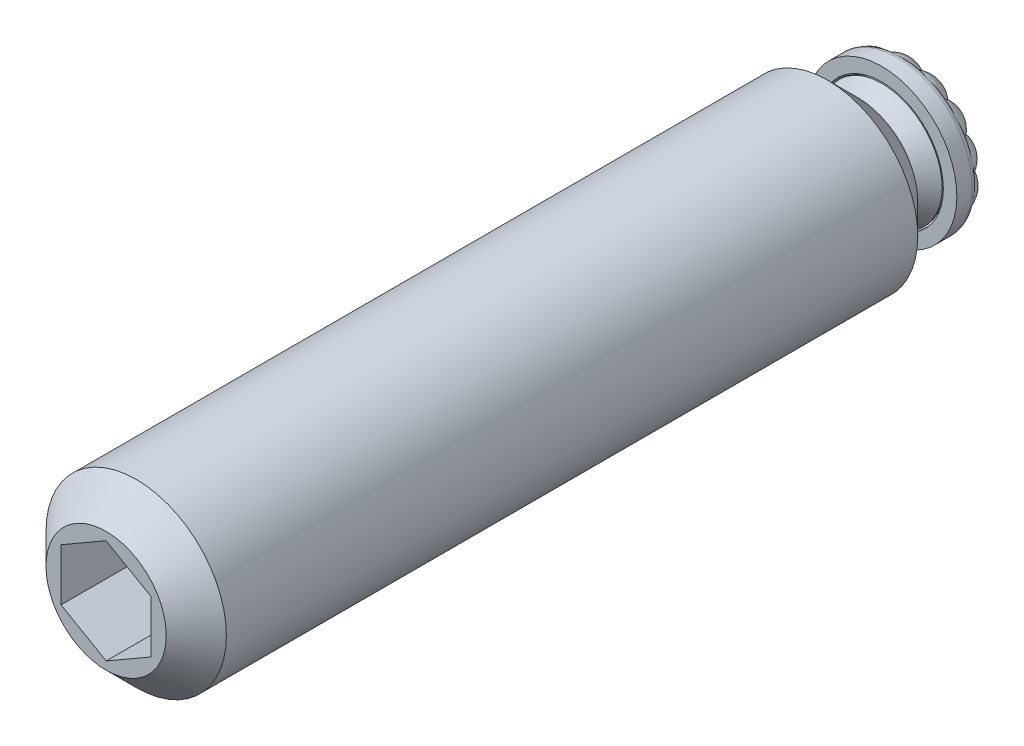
ISO-10303-21;
HEADER;
FILE_DESCRIPTION(('STEP AP214'),'2;1');
FILE_NAME('part.step','',(''),(''),'','','');
FILE_SCHEMA(('AUTOMOTIVE_DESIGN { 1 0 10303 214 1 1 1 1 }'));
ENDSEC;
DATA;
#1=APPLICATION_CONTEXT('core data for automotive mechanical design processes');
#2=APPLICATION_PROTOCOL_DEFINITION('international standard','automotive_design',2000,#1);
#3=PRODUCT_CONTEXT('',#1,'mechanical');
#4=PRODUCT('Part','Part','',(#3));
#5=PRODUCT_RELATED_PRODUCT_CATEGORY('part','',(#4));
#6=PRODUCT_DEFINITION_FORMATION('','',#4);
#7=PRODUCT_DEFINITION_CONTEXT('part definition',#1,'design');
#8=PRODUCT_DEFINITION('design','',#6,#7);
#9=PRODUCT_DEFINITION_SHAPE('','',#8);
#10=(LENGTH_UNIT() NAMED_UNIT(*) SI_UNIT(.MILLI.,.METRE.));
#11=(NAMED_UNIT(*) PLANE_ANGLE_UNIT() SI_UNIT($,.RADIAN.));
#12=(NAMED_UNIT(*) SI_UNIT($,.STERADIAN.) SOLID_ANGLE_UNIT());
#13=UNCERTAINTY_MEASURE_WITH_UNIT(LENGTH_MEASURE(1.E-05),#10,'distance_accuracy_value','');
#14=(GEOMETRIC_REPRESENTATION_CONTEXT(3) GLOBAL_UNCERTAINTY_ASSIGNED_CONTEXT((#13)) GLOBAL_UNIT_ASSIGNED_CONTEXT((#10,
#11,#12)) REPRESENTATION_CONTEXT('',''));
#15=CARTESIAN_POINT('',(0.,0.,0.));
#16=DIRECTION('',(0.,0.,1.));
#17=DIRECTION('',(1.,0.,0.));
#18=AXIS2_PLACEMENT_3D('',#15,#16,#17);
#19=CARTESIAN_POINT('',(0.,0.,4.));
#20=DIRECTION('',(0.,0.,-1.));
#21=DIRECTION('',(-1.,0.,0.));
#22=AXIS2_PLACEMENT_3D('',#19,#20,#21);
#23=PLANE('',#22);
#24=CARTESIAN_POINT('',(0.,0.,4.));
#25=DIRECTION('',(0.,0.,-1.));
#26=DIRECTION('',(-1.,0.,0.));
#27=AXIS2_PLACEMENT_3D('',#24,#25,#26);
#28=CIRCLE('',#27,4.);
#29=CARTESIAN_POINT('',(-4.,0.,4.));
#30=VERTEX_POINT('',#29);
#31=EDGE_CURVE('E85',#30,#30,#28,.T.);
#32=ORIENTED_EDGE('',*,*,#31,.T.);
#33=EDGE_LOOP('',(#32));
#34=FACE_BOUND('',#33,.T.);
#35=CARTESIAN_POINT('',(0.,0.,4.));
#36=DIRECTION('',(0.,0.,-1.));
#37=DIRECTION('',(-1.,0.,0.));
#38=AXIS2_PLACEMENT_3D('',#35,#36,#37);
#39=CIRCLE('',#38,3.);
#40=CARTESIAN_POINT('',(-3.,0.,4.));
#41=VERTEX_POINT('',#40);
#42=EDGE_CURVE('E9',#41,#41,#39,.T.);
#43=ORIENTED_EDGE('',*,*,#42,.F.);
#44=EDGE_LOOP('',(#43));
#45=FACE_BOUND('',#44,.T.);
#46=ADVANCED_FACE('F14',(#34,#45),#23,.T.);
#47=CARTESIAN_POINT('',(0.,0.,54.));
#48=DIRECTION('',(0.,0.,-1.));
#49=DIRECTION('',(-1.,0.,0.));
#50=AXIS2_PLACEMENT_3D('',#47,#48,#49);
#51=CYLINDRICAL_SURFACE('',#50,6.);
#52=CARTESIAN_POINT('',(0.,0.,6.));
#53=DIRECTION('',(0.,0.,-1.));
#54=DIRECTION('',(-1.,0.,0.));
#55=AXIS2_PLACEMENT_3D('',#52,#53,#54);
#56=CIRCLE('',#55,6.);
#57=CARTESIAN_POINT('',(-6.,0.,6.));
#58=VERTEX_POINT('',#57);
#59=EDGE_CURVE('E127',#58,#58,#56,.F.);
#60=ORIENTED_EDGE('',*,*,#59,.T.);
#61=EDGE_LOOP('',(#60));
#62=FACE_BOUND('',#61,.T.);
#63=CARTESIAN_POINT('',(0.,0.,52.));
#64=DIRECTION('',(0.,0.,-1.));
#65=DIRECTION('',(-1.,0.,0.));
#66=AXIS2_PLACEMENT_3D('',#63,#64,#65);
#67=CIRCLE('',#66,6.);
#68=CARTESIAN_POINT('',(-6.,0.,52.));
#69=VERTEX_POINT('',#68);
#70=EDGE_CURVE('E125',#69,#69,#67,.T.);
#71=ORIENTED_EDGE('',*,*,#70,.T.);
#72=EDGE_LOOP('',(#71));
#73=FACE_BOUND('',#72,.T.);
#74=ADVANCED_FACE('F986',(#62,#73),#51,.T.);
#75=CARTESIAN_POINT('',(0.,0.,54.));
#76=DIRECTION('',(0.,0.,-1.));
#77=DIRECTION('',(-1.,0.,0.));
#78=AXIS2_PLACEMENT_3D('',#75,#76,#77);
#79=PLANE('',#78);
#80=CARTESIAN_POINT('',(0.,0.,54.));
#81=DIRECTION('',(0.,0.,-1.));
#82=DIRECTION('',(-1.,0.,0.));
#83=AXIS2_PLACEMENT_3D('',#80,#81,#82);
#84=CIRCLE('',#83,4.);
#85=CARTESIAN_POINT('',(-4.,0.,54.));
#86=VERTEX_POINT('',#85);
#87=EDGE_CURVE('E18',#86,#86,#84,.F.);
#88=ORIENTED_EDGE('',*,*,#87,.T.);
#89=EDGE_LOOP('',(#88));
#90=FACE_BOUND('',#89,.T.);
#91=DIRECTION('',(-0.866025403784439,-0.5,0.));
#92=VECTOR('',#91,1.);
#93=CARTESIAN_POINT('',(0.,3.46410161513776,54.));
#94=LINE('',#93,#92);
#95=CARTESIAN_POINT('',(0.,3.46410161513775,54.));
#96=VERTEX_POINT('',#95);
#97=CARTESIAN_POINT('',(-3.,1.73205080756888,54.));
#98=VERTEX_POINT('',#97);
#99=EDGE_CURVE('E100',#96,#98,#94,.T.);
#100=ORIENTED_EDGE('',*,*,#99,.F.);
#101=DIRECTION('',(-0.866025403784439,0.5,0.));
#102=VECTOR('',#101,1.);
#103=CARTESIAN_POINT('',(3.,1.73205080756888,54.));
#104=LINE('',#103,#102);
#105=CARTESIAN_POINT('',(3.,1.73205080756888,54.));
#106=VERTEX_POINT('',#105);
#107=EDGE_CURVE('E78',#106,#96,#104,.T.);
#108=ORIENTED_EDGE('',*,*,#107,.F.);
#109=DIRECTION('',(0.,1.,0.));
#110=VECTOR('',#109,1.);
#111=CARTESIAN_POINT('',(3.,-1.73205080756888,54.));
#112=LINE('',#111,#110);
#113=CARTESIAN_POINT('',(3.,-1.73205080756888,54.));
#114=VERTEX_POINT('',#113);
#115=EDGE_CURVE('E89',#114,#106,#112,.T.);
#116=ORIENTED_EDGE('',*,*,#115,.F.);
#117=DIRECTION('',(0.866025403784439,0.5,0.));
#118=VECTOR('',#117,1.);
#119=CARTESIAN_POINT('',(0.,-3.46410161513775,54.));
#120=LINE('',#119,#118);
#121=CARTESIAN_POINT('',(0.,-3.46410161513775,54.));
#122=VERTEX_POINT('',#121);
#123=EDGE_CURVE('E94',#122,#114,#120,.T.);
#124=ORIENTED_EDGE('',*,*,#123,.F.);
#125=DIRECTION('',(0.866025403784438,-0.5,0.));
#126=VECTOR('',#125,1.);
#127=CARTESIAN_POINT('',(-3.,-1.73205080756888,54.));
#128=LINE('',#127,#126);
#129=CARTESIAN_POINT('',(-3.,-1.73205080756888,54.));
#130=VERTEX_POINT('',#129);
#131=EDGE_CURVE('E110',#130,#122,#128,.T.);
#132=ORIENTED_EDGE('',*,*,#131,.F.);
#133=DIRECTION('',(0.,-1.,0.));
#134=VECTOR('',#133,1.);
#135=CARTESIAN_POINT('',(-3.,1.73205080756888,54.));
#136=LINE('',#135,#134);
#137=EDGE_CURVE('E102',#98,#130,#136,.T.);
#138=ORIENTED_EDGE('',*,*,#137,.F.);
#139=EDGE_LOOP('',(#100,#108,#116,#124,#132,#138));
#140=FACE_BOUND('',#139,.T.);
#141=ADVANCED_FACE('F97',(#90,#140),#79,.F.);
#142=CARTESIAN_POINT('',(3.,1.73205080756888,47.5));
#143=DIRECTION('',(0.5,0.866025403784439,0.));
#144=DIRECTION('',(0.866025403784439,-0.5,0.));
#145=AXIS2_PLACEMENT_3D('',#142,#143,#144);
#146=PLANE('',#145);
#147=ORIENTED_EDGE('',*,*,#107,.T.);
#148=DIRECTION('',(0.,0.,1.));
#149=VECTOR('',#148,1.);
#150=CARTESIAN_POINT('',(0.,3.46410161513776,47.5));
#151=LINE('',#150,#149);
#152=CARTESIAN_POINT('',(0.,3.46410161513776,47.5));
#153=VERTEX_POINT('',#152);
#154=EDGE_CURVE('E121',#153,#96,#151,.T.);
#155=ORIENTED_EDGE('',*,*,#154,.F.);
#156=DIRECTION('',(-0.866025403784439,0.5,0.));
#157=VECTOR('',#156,1.);
#158=CARTESIAN_POINT('',(3.,1.73205080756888,47.5));
#159=LINE('',#158,#157);
#160=CARTESIAN_POINT('',(3.,1.73205080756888,47.5));
#161=VERTEX_POINT('',#160);
#162=EDGE_CURVE('E81',#161,#153,#159,.T.);
#163=ORIENTED_EDGE('',*,*,#162,.F.);
#164=DIRECTION('',(0.,0.,1.));
#165=VECTOR('',#164,1.);
#166=CARTESIAN_POINT('',(3.,1.73205080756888,47.5));
#167=LINE('',#166,#165);
#168=EDGE_CURVE('E74',#161,#106,#167,.T.);
#169=ORIENTED_EDGE('',*,*,#168,.T.);
#170=EDGE_LOOP('',(#147,#155,#163,#169));
#171=FACE_BOUND('',#170,.T.);
#172=ADVANCED_FACE('F76',(#171),#146,.F.);
#173=CARTESIAN_POINT('',(3.,-1.73205080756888,47.5));
#174=DIRECTION('',(1.,0.,0.));
#175=DIRECTION('',(0.,0.,-1.));
#176=AXIS2_PLACEMENT_3D('',#173,#174,#175);
#177=PLANE('',#176);
#178=ORIENTED_EDGE('',*,*,#115,.T.);
#179=ORIENTED_EDGE('',*,*,#168,.F.);
#180=DIRECTION('',(0.,1.,0.));
#181=VECTOR('',#180,1.);
#182=CARTESIAN_POINT('',(3.,-1.73205080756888,47.5));
#183=LINE('',#182,#181);
#184=CARTESIAN_POINT('',(3.,-1.73205080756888,47.5));
#185=VERTEX_POINT('',#184);
#186=EDGE_CURVE('E105',#185,#161,#183,.T.);
#187=ORIENTED_EDGE('',*,*,#186,.F.);
#188=DIRECTION('',(0.,0.,1.));
#189=VECTOR('',#188,1.);
#190=CARTESIAN_POINT('',(3.,-1.73205080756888,47.5));
#191=LINE('',#190,#189);
#192=EDGE_CURVE('E86',#185,#114,#191,.T.);
#193=ORIENTED_EDGE('',*,*,#192,.T.);
#194=EDGE_LOOP('',(#178,#179,#187,#193));
#195=FACE_BOUND('',#194,.T.);
#196=ADVANCED_FACE('F90',(#195),#177,.F.);
#197=CARTESIAN_POINT('',(0.,-3.46410161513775,47.5));
#198=DIRECTION('',(0.5,-0.866025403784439,0.));
#199=DIRECTION('',(-0.866025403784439,-0.5,0.));
#200=AXIS2_PLACEMENT_3D('',#197,#198,#199);
#201=PLANE('',#200);
#202=ORIENTED_EDGE('',*,*,#123,.T.);
#203=ORIENTED_EDGE('',*,*,#192,.F.);
#204=DIRECTION('',(0.866025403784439,0.5,0.));
#205=VECTOR('',#204,1.);
#206=CARTESIAN_POINT('',(0.,-3.46410161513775,47.5));
#207=LINE('',#206,#205);
#208=CARTESIAN_POINT('',(0.,-3.46410161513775,47.5));
#209=VERTEX_POINT('',#208);
#210=EDGE_CURVE('E1778',#209,#185,#207,.T.);
#211=ORIENTED_EDGE('',*,*,#210,.F.);
#212=DIRECTION('',(0.,0.,1.));
#213=VECTOR('',#212,1.);
#214=CARTESIAN_POINT('',(0.,-3.46410161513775,47.5));
#215=LINE('',#214,#213);
#216=EDGE_CURVE('E115',#209,#122,#215,.T.);
#217=ORIENTED_EDGE('',*,*,#216,.T.);
#218=EDGE_LOOP('',(#202,#203,#211,#217));
#219=FACE_BOUND('',#218,.T.);
#220=ADVANCED_FACE('F967',(#219),#201,.F.);
#221=CARTESIAN_POINT('',(-3.,-1.73205080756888,47.5));
#222=DIRECTION('',(-0.5,-0.866025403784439,0.));
#223=DIRECTION('',(-0.866025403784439,0.5,0.));
#224=AXIS2_PLACEMENT_3D('',#221,#222,#223);
#225=PLANE('',#224);
#226=ORIENTED_EDGE('',*,*,#131,.T.);
#227=ORIENTED_EDGE('',*,*,#216,.F.);
#228=DIRECTION('',(0.866025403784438,-0.5,0.));
#229=VECTOR('',#228,1.);
#230=CARTESIAN_POINT('',(-3.,-1.73205080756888,47.5));
#231=LINE('',#230,#229);
#232=CARTESIAN_POINT('',(-3.,-1.73205080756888,47.5));
#233=VERTEX_POINT('',#232);
#234=EDGE_CURVE('E1776',#233,#209,#231,.T.);
#235=ORIENTED_EDGE('',*,*,#234,.F.);
#236=DIRECTION('',(0.,0.,1.));
#237=VECTOR('',#236,1.);
#238=CARTESIAN_POINT('',(-3.,-1.73205080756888,47.5));
#239=LINE('',#238,#237);
#240=EDGE_CURVE('E117',#233,#130,#239,.T.);
#241=ORIENTED_EDGE('',*,*,#240,.T.);
#242=EDGE_LOOP('',(#226,#227,#235,#241));
#243=FACE_BOUND('',#242,.T.);
#244=ADVANCED_FACE('F970',(#243),#225,.F.);
#245=CARTESIAN_POINT('',(-3.,1.73205080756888,47.5));
#246=DIRECTION('',(-1.,0.,0.));
#247=DIRECTION('',(0.,1.,0.));
#248=AXIS2_PLACEMENT_3D('',#245,#246,#247);
#249=PLANE('',#248);
#250=ORIENTED_EDGE('',*,*,#137,.T.);
#251=ORIENTED_EDGE('',*,*,#240,.F.);
#252=DIRECTION('',(0.,-1.,0.));
#253=VECTOR('',#252,1.);
#254=CARTESIAN_POINT('',(-3.,1.73205080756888,47.5));
#255=LINE('',#254,#253);
#256=CARTESIAN_POINT('',(-3.,1.73205080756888,47.5));
#257=VERTEX_POINT('',#256);
#258=EDGE_CURVE('E1773',#257,#233,#255,.T.);
#259=ORIENTED_EDGE('',*,*,#258,.F.);
#260=DIRECTION('',(0.,0.,1.));
#261=VECTOR('',#260,1.);
#262=CARTESIAN_POINT('',(-3.,1.73205080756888,47.5));
#263=LINE('',#262,#261);
#264=EDGE_CURVE('E119',#257,#98,#263,.T.);
#265=ORIENTED_EDGE('',*,*,#264,.T.);
#266=EDGE_LOOP('',(#250,#251,#259,#265));
#267=FACE_BOUND('',#266,.T.);
#268=ADVANCED_FACE('F974',(#267),#249,.F.);
#269=CARTESIAN_POINT('',(0.,3.46410161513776,47.5));
#270=DIRECTION('',(-0.5,0.866025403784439,0.));
#271=DIRECTION('',(0.866025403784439,0.5,0.));
#272=AXIS2_PLACEMENT_3D('',#269,#270,#271);
#273=PLANE('',#272);
#274=ORIENTED_EDGE('',*,*,#99,.T.);
#275=ORIENTED_EDGE('',*,*,#264,.F.);
#276=DIRECTION('',(-0.866025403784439,-0.5,0.));
#277=VECTOR('',#276,1.);
#278=CARTESIAN_POINT('',(0.,3.46410161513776,47.5));
#279=LINE('',#278,#277);
#280=EDGE_CURVE('E1770',#153,#257,#279,.T.);
#281=ORIENTED_EDGE('',*,*,#280,.F.);
#282=ORIENTED_EDGE('',*,*,#154,.T.);
#283=EDGE_LOOP('',(#274,#275,#281,#282));
#284=FACE_BOUND('',#283,.T.);
#285=ADVANCED_FACE('F963',(#284),#273,.F.);
#286=CARTESIAN_POINT('',(6.,0.,47.5));
#287=DIRECTION('',(0.,0.,-1.));
#288=DIRECTION('',(-1.,0.,0.));
#289=AXIS2_PLACEMENT_3D('',#286,#287,#288);
#290=PLANE('',#289);
#291=ORIENTED_EDGE('',*,*,#162,.T.);
#292=ORIENTED_EDGE('',*,*,#280,.T.);
#293=ORIENTED_EDGE('',*,*,#258,.T.);
#294=ORIENTED_EDGE('',*,*,#234,.T.);
#295=ORIENTED_EDGE('',*,*,#210,.T.);
#296=ORIENTED_EDGE('',*,*,#186,.T.);
#297=EDGE_LOOP('',(#291,#292,#293,#294,#295,#296));
#298=FACE_BOUND('',#297,.T.);
#299=ADVANCED_FACE('F959',(#298),#290,.F.);
#300=CARTESIAN_POINT('',(0.,0.,4.));
#301=DIRECTION('',(0.,0.,1.));
#302=DIRECTION('',(1.,0.,0.));
#303=AXIS2_PLACEMENT_3D('',#300,#301,#302);
#304=CONICAL_SURFACE('',#303,4.,0.785398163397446);
#305=ORIENTED_EDGE('',*,*,#59,.F.);
#306=EDGE_LOOP('',(#305));
#307=FACE_BOUND('',#306,.T.);
#308=ORIENTED_EDGE('',*,*,#31,.F.);
#309=EDGE_LOOP('',(#308));
#310=FACE_BOUND('',#309,.T.);
#311=ADVANCED_FACE('F962',(#307,#310),#304,.T.);
#312=CARTESIAN_POINT('',(0.,0.,52.));
#313=DIRECTION('',(0.,0.,-1.));
#314=DIRECTION('',(-1.,0.,0.));
#315=AXIS2_PLACEMENT_3D('',#312,#313,#314);
#316=CONICAL_SURFACE('',#315,6.,0.78539816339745);
#317=ORIENTED_EDGE('',*,*,#87,.F.);
#318=EDGE_LOOP('',(#317));
#319=FACE_BOUND('',#318,.T.);
#320=ORIENTED_EDGE('',*,*,#70,.F.);
#321=EDGE_LOOP('',(#320));
#322=FACE_BOUND('',#321,.T.);
#323=ADVANCED_FACE('F16',(#319,#322),#316,.T.);
#324=CARTESIAN_POINT('',(0.,0.,3.4863302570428));
#325=DIRECTION('',(0.,0.,-1.));
#326=DIRECTION('',(-0.965048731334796,-0.262070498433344,0.));
#327=AXIS2_PLACEMENT_3D('',#324,#325,#326);
#328=TOROIDAL_SURFACE('',#327,3.254,0.254);
#329=CARTESIAN_POINT('',(0.,0.,3.4863302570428));
#330=DIRECTION('',(0.,0.,-1.));
#331=DIRECTION('',(-0.965048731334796,-0.262070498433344,0.));
#332=AXIS2_PLACEMENT_3D('',#329,#330,#331);
#333=CIRCLE('',#332,3.);
#334=CARTESIAN_POINT('',(-2.89514619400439,-0.786211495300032,3.4863302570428));
#335=VERTEX_POINT('',#334);
#336=EDGE_CURVE('E1659',#335,#335,#333,.F.);
#337=ORIENTED_EDGE('',*,*,#336,.F.);
#338=EDGE_LOOP('',(#337));
#339=FACE_BOUND('',#338,.T.);
#340=CARTESIAN_POINT('',(0.,0.,3.30672513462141));
#341=DIRECTION('',(0.,0.,-1.));
#342=DIRECTION('',(-0.965048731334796,-0.262070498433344,0.));
#343=AXIS2_PLACEMENT_3D('',#340,#341,#342);
#344=CIRCLE('',#343,3.07439487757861);
#345=CARTESIAN_POINT('',(-2.96694087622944,-0.805708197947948,3.30672513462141));
#346=VERTEX_POINT('',#345);
#347=EDGE_CURVE('E24',#346,#346,#344,.T.);
#348=ORIENTED_EDGE('',*,*,#347,.F.);
#349=EDGE_LOOP('',(#348));
#350=FACE_BOUND('',#349,.T.);
#351=ADVANCED_FACE('F236',(#339,#350),#328,.F.);
#352=CARTESIAN_POINT('',(0.,0.,2.0001200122));
#353=DIRECTION('',(0.,0.,-1.));
#354=DIRECTION('',(-0.965048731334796,-0.262070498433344,0.));
#355=AXIS2_PLACEMENT_3D('',#352,#353,#354);
#356=CYLINDRICAL_SURFACE('',#355,3.);
#357=ORIENTED_EDGE('',*,*,#42,.T.);
#358=EDGE_LOOP('',(#357));
#359=FACE_BOUND('',#358,.T.);
#360=ORIENTED_EDGE('',*,*,#336,.T.);
#361=EDGE_LOOP('',(#360));
#362=FACE_BOUND('',#361,.T.);
#363=ADVANCED_FACE('F1564',(#359,#362),#356,.T.);
#364=CARTESIAN_POINT('',(0.,0.,3.38112001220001));
#365=DIRECTION('',(0.,0.,-1.));
#366=DIRECTION('',(-0.965048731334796,-0.262070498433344,0.));
#367=AXIS2_PLACEMENT_3D('',#364,#365,#366);
#368=CONICAL_SURFACE('',#367,3.,0.78539816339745);
#369=ORIENTED_EDGE('',*,*,#347,.T.);
#370=EDGE_LOOP('',(#369));
#371=FACE_BOUND('',#370,.T.);
#372=CARTESIAN_POINT('',(0.,0.,2.38112001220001));
#373=DIRECTION('',(0.,0.,-1.));
#374=DIRECTION('',(-0.965048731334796,-0.262070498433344,0.));
#375=AXIS2_PLACEMENT_3D('',#372,#373,#374);
#376=CIRCLE('',#375,4.);
#377=CARTESIAN_POINT('',(-3.86019492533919,-1.04828199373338,2.38112001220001));
#378=VERTEX_POINT('',#377);
#379=EDGE_CURVE('E1053',#378,#378,#376,.T.);
#380=ORIENTED_EDGE('',*,*,#379,.F.);
#381=EDGE_LOOP('',(#380));
#382=FACE_BOUND('',#381,.T.);
#383=ADVANCED_FACE('F1015',(#371,#382),#368,.T.);
#384=CARTESIAN_POINT('',(0.,0.,2.38112001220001));
#385=DIRECTION('',(0.,0.,1.));
#386=DIRECTION('',(0.965048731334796,0.262070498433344,0.));
#387=AXIS2_PLACEMENT_3D('',#384,#385,#386);
#388=TOROIDAL_SURFACE('',#387,3.619,0.381);
#389=ORIENTED_EDGE('',*,*,#379,.T.);
#390=EDGE_LOOP('',(#389));
#391=FACE_BOUND('',#390,.T.);
#392=CARTESIAN_POINT('',(0.,0.,2.0001200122));
#393=DIRECTION('',(0.,0.,1.));
#394=DIRECTION('',(0.965048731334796,0.262070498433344,0.));
#395=AXIS2_PLACEMENT_3D('',#392,#393,#394);
#396=CIRCLE('',#395,3.619);
#397=CARTESIAN_POINT('',(3.49251135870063,0.948433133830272,2.0001200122));
#398=VERTEX_POINT('',#397);
#399=EDGE_CURVE('E1663',#398,#398,#396,.F.);
#400=ORIENTED_EDGE('',*,*,#399,.F.);
#401=EDGE_LOOP('',(#400));
#402=FACE_BOUND('',#401,.T.);
#403=ADVANCED_FACE('F990',(#391,#402),#388,.T.);
#404=CARTESIAN_POINT('',(4.45756009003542,1.21050363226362,1.0001200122));
#405=DIRECTION('',(0.,0.,1.));
#406=DIRECTION('',(0.262070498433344,-0.965048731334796,0.));
#407=AXIS2_PLACEMENT_3D('',#404,#405,#406);
#408=PLANE('',#407);
#409=CARTESIAN_POINT('',(1.6047055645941,-3.01165673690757,1.0001200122));
#410=DIRECTION('',(0.,0.,1.));
#411=DIRECTION('',(-0.882536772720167,-0.470243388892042,0.));
#412=AXIS2_PLACEMENT_3D('',#409,#410,#411);
#413=CIRCLE('',#412,1.47478812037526);
#414=CARTESIAN_POINT('',(0.962871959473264,-1.68385794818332,1.0001200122));
#415=VERTEX_POINT('',#414);
#416=CARTESIAN_POINT('',(1.35071093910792,-1.55890530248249,1.0001200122));
#417=VERTEX_POINT('',#416);
#418=EDGE_CURVE('E321',#415,#417,#413,.F.);
#419=ORIENTED_EDGE('',*,*,#418,.F.);
#420=CARTESIAN_POINT('',(0.,0.,1.0001200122));
#421=DIRECTION('',(0.,0.,1.));
#422=DIRECTION('',(0.262070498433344,-0.965048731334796,0.));
#423=AXIS2_PLACEMENT_3D('',#420,#421,#422);
#424=CIRCLE('',#423,1.93971647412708);
#425=CARTESIAN_POINT('',(1.52961064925,-1.19280814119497,1.0001200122));
#426=VERTEX_POINT('',#425);
#427=EDGE_CURVE('E203',#415,#426,#424,.T.);
#428=ORIENTED_EDGE('',*,*,#427,.T.);
#429=CARTESIAN_POINT('',(2.7524986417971,-2.01715331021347,1.0001200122));
#430=DIRECTION('',(0.,0.,1.));
#431=DIRECTION('',(-0.591107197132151,-0.80659300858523,0.));
#432=AXIS2_PLACEMENT_3D('',#429,#430,#431);
#433=CIRCLE('',#432,1.47478812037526);
#434=EDGE_CURVE('E371',#417,#426,#433,.F.);
#435=ORIENTED_EDGE('',*,*,#434,.F.);
#436=EDGE_LOOP('',(#419,#428,#435));
#437=FACE_BOUND('',#436,.T.);
#438=ADVANCED_FACE('F957',(#437),#408,.F.);
#439=CARTESIAN_POINT('',(0.139080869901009,-3.40966461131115,1.0001200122));
#440=DIRECTION('',(0.,0.,1.));
#441=DIRECTION('',(-0.999169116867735,-0.0407562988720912,0.));
#442=AXIS2_PLACEMENT_3D('',#439,#440,#441);
#443=CIRCLE('',#442,1.47478812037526);
#444=CARTESIAN_POINT('',(0.136919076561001,-1.93487807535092,1.0001200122));
#445=VERTEX_POINT('',#444);
#446=CARTESIAN_POINT('',(0.540564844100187,-1.99057665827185,1.0001200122));
#447=VERTEX_POINT('',#446);
#448=EDGE_CURVE('E315',#445,#447,#443,.F.);
#449=ORIENTED_EDGE('',*,*,#448,.F.);
#450=CARTESIAN_POINT('',(0.860591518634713,-1.73835618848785,1.0001200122));
#451=VERTEX_POINT('',#450);
#452=EDGE_CURVE('E199',#445,#451,#424,.T.);
#453=ORIENTED_EDGE('',*,*,#452,.T.);
#454=EDGE_CURVE('E312',#447,#451,#413,.F.);
#455=ORIENTED_EDGE('',*,*,#454,.F.);
#456=EDGE_LOOP('',(#449,#453,#455));
#457=FACE_BOUND('',#456,.T.);
#458=ADVANCED_FACE('F310',(#457),#408,.F.);
#459=CARTESIAN_POINT('',(-1.3540904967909,-3.13234659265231,1.0001200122));
#460=DIRECTION('',(0.,0.,1.));
#461=DIRECTION('',(-0.917903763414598,0.396803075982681,0.));
#462=AXIS2_PLACEMENT_3D('',#459,#460,#461);
#463=CIRCLE('',#462,1.47478812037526);
#464=CARTESIAN_POINT('',(-0.716152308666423,-1.80267186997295,1.0001200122));
#465=VERTEX_POINT('',#464);
#466=CARTESIAN_POINT('',(-0.376646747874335,-2.02798989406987,1.0001200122));
#467=VERTEX_POINT('',#466);
#468=EDGE_CURVE('E753',#465,#467,#463,.F.);
#469=ORIENTED_EDGE('',*,*,#468,.F.);
#470=CARTESIAN_POINT('',(0.0211216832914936,-1.93960147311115,1.0001200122));
#471=VERTEX_POINT('',#470);
#472=EDGE_CURVE('E194',#465,#471,#424,.T.);
#473=ORIENTED_EDGE('',*,*,#472,.T.);
#474=EDGE_CURVE('E762',#467,#471,#443,.F.);
#475=ORIENTED_EDGE('',*,*,#474,.F.);
#476=EDGE_LOOP('',(#469,#473,#475));
#477=FACE_BOUND('',#476,.T.);
#478=ADVANCED_FACE('F958',(#477),#408,.F.);
#479=CARTESIAN_POINT('',(-2.57906763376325,-2.23462891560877,1.0001200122));
#480=DIRECTION('',(0.,0.,1.));
#481=DIRECTION('',(-0.654836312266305,0.75577073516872,0.));
#482=AXIS2_PLACEMENT_3D('',#479,#480,#481);
#483=CIRCLE('',#482,1.47478812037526);
#484=CARTESIAN_POINT('',(-1.4273809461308,-1.31342439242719,1.0001200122));
#485=VERTEX_POINT('',#484);
#486=CARTESIAN_POINT('',(-1.21925883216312,-1.66373485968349,1.0001200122));
#487=VERTEX_POINT('',#486);
#488=EDGE_CURVE('E710',#485,#487,#483,.F.);
#489=ORIENTED_EDGE('',*,*,#488,.F.);
#490=CARTESIAN_POINT('',(-0.82253156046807,-1.75668489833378,1.0001200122));
#491=VERTEX_POINT('',#490);
#492=EDGE_CURVE('E189',#485,#491,#424,.T.);
#493=ORIENTED_EDGE('',*,*,#492,.T.);
#494=EDGE_CURVE('E723',#487,#491,#463,.F.);
#495=ORIENTED_EDGE('',*,*,#494,.F.);
#496=EDGE_LOOP('',(#489,#493,#495));
#497=FACE_BOUND('',#496,.T.);
#498=ADVANCED_FACE('F1529',(#497),#408,.F.);
#499=CARTESIAN_POINT('',(-3.29322879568,-0.894315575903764,1.0001200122));
#500=DIRECTION('',(0.,0.,1.));
#501=DIRECTION('',(-0.262070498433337,0.965048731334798,0.));
#502=AXIS2_PLACEMENT_3D('',#499,#500,#501);
#503=CIRCLE('',#502,1.47478812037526);
#504=CARTESIAN_POINT('',(-1.85589928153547,-0.564037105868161,1.0001200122));
#505=VERTEX_POINT('',#504);
#506=CARTESIAN_POINT('',(-1.82038175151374,-0.969956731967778,1.0001200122));
#507=VERTEX_POINT('',#506);
#508=EDGE_CURVE('E666',#505,#507,#503,.F.);
#509=ORIENTED_EDGE('',*,*,#508,.F.);
#510=CARTESIAN_POINT('',(-1.50327234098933,-1.22583533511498,1.0001200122));
#511=VERTEX_POINT('',#510);
#512=EDGE_CURVE('E184',#505,#511,#424,.T.);
#513=ORIENTED_EDGE('',*,*,#512,.T.);
#514=EDGE_CURVE('E680',#507,#511,#483,.F.);
#515=ORIENTED_EDGE('',*,*,#514,.F.);
#516=EDGE_LOOP('',(#509,#513,#515));
#517=FACE_BOUND('',#516,.T.);
#518=ADVANCED_FACE('F1192',(#517),#408,.F.);
#519=CARTESIAN_POINT('',(-3.35512560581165,0.623127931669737,1.0001200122));
#520=DIRECTION('',(0.,0.,1.));
#521=DIRECTION('',(0.182601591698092,0.983186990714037,0.));
#522=AXIS2_PLACEMENT_3D('',#519,#520,#521);
#523=CIRCLE('',#522,1.47478812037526);
#524=CARTESIAN_POINT('',(-1.91683400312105,0.297064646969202,1.0001200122));
#525=VERTEX_POINT('',#524);
#526=CARTESIAN_POINT('',(-2.06095573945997,-0.0840667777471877,1.0001200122));
#527=VERTEX_POINT('',#526);
#528=EDGE_CURVE('E624',#525,#527,#523,.F.);
#529=ORIENTED_EDGE('',*,*,#528,.F.);
#530=CARTESIAN_POINT('',(-1.88627159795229,-0.45219404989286,1.0001200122));
#531=VERTEX_POINT('',#530);
#532=EDGE_CURVE('E179',#525,#531,#424,.T.);
#533=ORIENTED_EDGE('',*,*,#532,.T.);
#534=EDGE_CURVE('E636',#527,#531,#503,.F.);
#535=ORIENTED_EDGE('',*,*,#534,.F.);
#536=EDGE_LOOP('',(#529,#533,#535));
#537=FACE_BOUND('',#536,.T.);
#538=ADVANCED_FACE('F1514',(#537),#408,.F.);
#539=CARTESIAN_POINT('',(-2.75249864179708,2.01715331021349,1.0001200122));
#540=DIRECTION('',(0.,0.,1.));
#541=DIRECTION('',(0.591107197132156,0.806593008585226,0.));
#542=AXIS2_PLACEMENT_3D('',#539,#540,#541);
#543=CIRCLE('',#542,1.47478812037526);
#544=CARTESIAN_POINT('',(-1.5981162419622,1.09932910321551,1.0001200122));
#545=VERTEX_POINT('',#544);
#546=CARTESIAN_POINT('',(-1.89333216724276,0.818473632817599,1.0001200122));
#547=VERTEX_POINT('',#546);
#548=EDGE_CURVE('E581',#545,#547,#543,.F.);
#549=ORIENTED_EDGE('',*,*,#548,.F.);
#550=CARTESIAN_POINT('',(-1.89567163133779,0.411009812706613,1.0001200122));
#551=VERTEX_POINT('',#550);
#552=EDGE_CURVE('E174',#545,#551,#424,.T.);
#553=ORIENTED_EDGE('',*,*,#552,.T.);
#554=EDGE_CURVE('E594',#547,#551,#523,.F.);
#555=ORIENTED_EDGE('',*,*,#554,.F.);
#556=EDGE_LOOP('',(#549,#553,#555));
#557=FACE_BOUND('',#556,.T.);
#558=ADVANCED_FACE('F1506',(#557),#408,.F.);
#559=CARTESIAN_POINT('',(-1.60470556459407,3.01165673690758,1.0001200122));
#560=DIRECTION('',(0.,0.,1.));
#561=DIRECTION('',(0.88253677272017,0.470243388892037,0.));
#562=AXIS2_PLACEMENT_3D('',#559,#560,#561);
#563=CIRCLE('',#562,1.47478812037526);
#564=CARTESIAN_POINT('',(-0.962871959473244,1.68385794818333,1.0001200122));
#565=VERTEX_POINT('',#564);
#566=CARTESIAN_POINT('',(-1.35071093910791,1.55890530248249,1.0001200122));
#567=VERTEX_POINT('',#566);
#568=EDGE_CURVE('E537',#565,#567,#563,.F.);
#569=ORIENTED_EDGE('',*,*,#568,.F.);
#570=CARTESIAN_POINT('',(-1.52961064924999,1.19280814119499,1.0001200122));
#571=VERTEX_POINT('',#570);
#572=EDGE_CURVE('E169',#565,#571,#424,.T.);
#573=ORIENTED_EDGE('',*,*,#572,.T.);
#574=EDGE_CURVE('E551',#567,#571,#543,.F.);
#575=ORIENTED_EDGE('',*,*,#574,.F.);
#576=EDGE_LOOP('',(#569,#573,#575));
#577=FACE_BOUND('',#576,.T.);
#578=ADVANCED_FACE('F1498',(#577),#408,.F.);
#579=CARTESIAN_POINT('',(-0.139080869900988,3.40966461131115,1.0001200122));
#580=DIRECTION('',(0.,0.,1.));
#581=DIRECTION('',(0.999169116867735,0.0407562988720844,0.));
#582=AXIS2_PLACEMENT_3D('',#579,#580,#581);
#583=CIRCLE('',#582,1.47478812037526);
#584=CARTESIAN_POINT('',(-0.136919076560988,1.93487807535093,1.0001200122));
#585=VERTEX_POINT('',#584);
#586=CARTESIAN_POINT('',(-0.540564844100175,1.99057665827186,1.0001200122));
#587=VERTEX_POINT('',#586);
#588=EDGE_CURVE('E493',#585,#587,#583,.F.);
#589=ORIENTED_EDGE('',*,*,#588,.F.);
#590=CARTESIAN_POINT('',(-0.860591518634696,1.73835618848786,1.0001200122));
#591=VERTEX_POINT('',#590);
#592=EDGE_CURVE('E165',#585,#591,#424,.T.);
#593=ORIENTED_EDGE('',*,*,#592,.T.);
#594=EDGE_CURVE('E507',#587,#591,#563,.F.);
#595=ORIENTED_EDGE('',*,*,#594,.F.);
#596=EDGE_LOOP('',(#589,#593,#595));
#597=FACE_BOUND('',#596,.T.);
#598=ADVANCED_FACE('F1491',(#597),#408,.F.);
#599=CARTESIAN_POINT('',(1.35409049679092,3.13234659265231,1.0001200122));
#600=DIRECTION('',(0.,0.,1.));
#601=DIRECTION('',(0.917903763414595,-0.396803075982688,0.));
#602=AXIS2_PLACEMENT_3D('',#599,#600,#601);
#603=CIRCLE('',#602,1.47478812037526);
#604=CARTESIAN_POINT('',(0.716152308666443,1.80267186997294,1.0001200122));
#605=VERTEX_POINT('',#604);
#606=CARTESIAN_POINT('',(0.376646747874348,2.02798989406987,1.0001200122));
#607=VERTEX_POINT('',#606);
#608=EDGE_CURVE('E449',#605,#607,#603,.F.);
#609=ORIENTED_EDGE('',*,*,#608,.F.);
#610=CARTESIAN_POINT('',(-0.0211216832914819,1.93960147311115,1.0001200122));
#611=VERTEX_POINT('',#610);
#612=EDGE_CURVE('E33',#605,#611,#424,.T.);
#613=ORIENTED_EDGE('',*,*,#612,.T.);
#614=EDGE_CURVE('E461',#607,#611,#583,.F.);
#615=ORIENTED_EDGE('',*,*,#614,.F.);
#616=EDGE_LOOP('',(#609,#613,#615));
#617=FACE_BOUND('',#616,.T.);
#618=ADVANCED_FACE('F1483',(#617),#408,.F.);
#619=CARTESIAN_POINT('',(2.57906763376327,2.23462891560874,1.0001200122));
#620=DIRECTION('',(0.,0.,1.));
#621=DIRECTION('',(0.6548363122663,-0.755770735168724,0.));
#622=AXIS2_PLACEMENT_3D('',#619,#620,#621);
#623=CIRCLE('',#622,1.47478812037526);
#624=CARTESIAN_POINT('',(1.4273809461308,1.31342439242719,1.0001200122));
#625=VERTEX_POINT('',#624);
#626=CARTESIAN_POINT('',(1.21925883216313,1.66373485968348,1.0001200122));
#627=VERTEX_POINT('',#626);
#628=EDGE_CURVE('E400',#625,#627,#623,.F.);
#629=ORIENTED_EDGE('',*,*,#628,.F.);
#630=CARTESIAN_POINT('',(0.822531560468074,1.75668489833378,1.0001200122));
#631=VERTEX_POINT('',#630);
#632=EDGE_CURVE('E134',#625,#631,#424,.T.);
#633=ORIENTED_EDGE('',*,*,#632,.T.);
#634=EDGE_CURVE('E441',#627,#631,#603,.F.);
#635=ORIENTED_EDGE('',*,*,#634,.F.);
#636=EDGE_LOOP('',(#629,#633,#635));
#637=FACE_BOUND('',#636,.T.);
#638=ADVANCED_FACE('F1030',(#637),#408,.F.);
#639=CARTESIAN_POINT('',(3.29322879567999,0.894315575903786,1.0001200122));
#640=DIRECTION('',(0.,0.,1.));
#641=DIRECTION('',(0.262070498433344,-0.965048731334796,0.));
#642=AXIS2_PLACEMENT_3D('',#639,#640,#641);
#643=CIRCLE('',#642,1.47478812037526);
#644=CARTESIAN_POINT('',(1.85589928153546,0.564037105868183,1.0001200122));
#645=VERTEX_POINT('',#644);
#646=CARTESIAN_POINT('',(1.82038175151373,0.969956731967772,1.0001200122));
#647=VERTEX_POINT('',#646);
#648=EDGE_CURVE('E1068',#645,#647,#643,.F.);
#649=ORIENTED_EDGE('',*,*,#648,.F.);
#650=CARTESIAN_POINT('',(1.50327234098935,1.22583533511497,1.0001200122));
#651=VERTEX_POINT('',#650);
#652=EDGE_CURVE('E151',#645,#651,#424,.T.);
#653=ORIENTED_EDGE('',*,*,#652,.T.);
#654=EDGE_CURVE('E391',#647,#651,#623,.F.);
#655=ORIENTED_EDGE('',*,*,#654,.F.);
#656=EDGE_LOOP('',(#649,#653,#655));
#657=FACE_BOUND('',#656,.T.);
#658=ADVANCED_FACE('F1025',(#657),#408,.F.);
#659=CARTESIAN_POINT('',(3.35512560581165,-0.623127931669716,1.0001200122));
#660=DIRECTION('',(0.,0.,1.));
#661=DIRECTION('',(-0.182601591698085,-0.983186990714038,0.));
#662=AXIS2_PLACEMENT_3D('',#659,#660,#661);
#663=CIRCLE('',#662,1.47478812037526);
#664=CARTESIAN_POINT('',(1.91683400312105,-0.297064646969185,1.0001200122));
#665=VERTEX_POINT('',#664);
#666=CARTESIAN_POINT('',(2.06095573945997,0.084066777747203,1.0001200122));
#667=VERTEX_POINT('',#666);
#668=EDGE_CURVE('E903',#665,#667,#663,.F.);
#669=ORIENTED_EDGE('',*,*,#668,.F.);
#670=CARTESIAN_POINT('',(1.88627159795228,0.452194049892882,1.0001200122));
#671=VERTEX_POINT('',#670);
#672=EDGE_CURVE('E158',#665,#671,#424,.T.);
#673=ORIENTED_EDGE('',*,*,#672,.T.);
#674=EDGE_CURVE('E918',#667,#671,#643,.F.);
#675=ORIENTED_EDGE('',*,*,#674,.F.);
#676=EDGE_LOOP('',(#669,#673,#675));
#677=FACE_BOUND('',#676,.T.);
#678=ADVANCED_FACE('F235',(#677),#408,.F.);
#679=CARTESIAN_POINT('',(0.,0.,2.3813700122));
#680=DIRECTION('',(0.,0.,1.));
#681=DIRECTION('',(0.965048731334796,0.262070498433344,0.));
#682=AXIS2_PLACEMENT_3D('',#679,#680,#681);
#683=SPHERICAL_SURFACE('',#682,2.38125);
#684=CARTESIAN_POINT('',(-0.822531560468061,-1.75668489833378,1.0001200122));
#685=CARTESIAN_POINT('',(-0.818071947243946,-1.7585362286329,0.999819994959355));
#686=CARTESIAN_POINT('',(-0.813613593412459,-1.76039665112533,0.999557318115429));
#687=CARTESIAN_POINT('',(-0.804705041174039,-1.76413323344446,0.999107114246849));
#688=CARTESIAN_POINT('',(-0.800254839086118,-1.76600937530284,0.998919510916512));
#689=CARTESIAN_POINT('',(-0.791362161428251,-1.76977744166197,0.99861941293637));
#690=CARTESIAN_POINT('',(-0.786919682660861,-1.77166935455,0.998506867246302));
#691=CARTESIAN_POINT('',(-0.778042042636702,-1.77546905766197,0.998356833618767));
#692=CARTESIAN_POINT('',(-0.773606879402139,-1.77737684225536,0.998319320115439));
#693=CARTESIAN_POINT('',(-0.764743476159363,-1.78120842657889,0.998319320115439));
#694=CARTESIAN_POINT('',(-0.760315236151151,-1.78313222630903,0.998356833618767));
#695=CARTESIAN_POINT('',(-0.751465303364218,-1.78699602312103,0.998506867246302));
#696=CARTESIAN_POINT('',(-0.747043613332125,-1.7889360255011,0.99861941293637));
#697=CARTESIAN_POINT('',(-0.738206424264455,-1.79283245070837,0.998919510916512));
#698=CARTESIAN_POINT('',(-0.73379093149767,-1.79478888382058,0.999107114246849));
#699=CARTESIAN_POINT('',(-0.724965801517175,-1.79871844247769,0.999557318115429));
#700=CARTESIAN_POINT('',(-0.720556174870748,-1.80069158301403,0.999819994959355));
#701=CARTESIAN_POINT('',(-0.716152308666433,-1.80267186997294,1.0001200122));
#702=B_SPLINE_CURVE_WITH_KNOTS('',3,(#684,#685,#686,#687,#688,#689,#690,#691,#692,#693,#694,
#695,#696,#697,#698,#699,#700,#701),.UNSPECIFIED.,.F.,.F.,(4,2,2,2,2,2,2,2,4),(0.,
0.0145136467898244,0.029012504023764,0.0435014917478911,0.0579855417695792,0.0724695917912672,
0.0869585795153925,0.101457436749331,0.115971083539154),.UNSPECIFIED.);
#703=EDGE_CURVE('E718',#491,#465,#702,.T.);
#704=ORIENTED_EDGE('',*,*,#703,.F.);
#705=ORIENTED_EDGE('',*,*,#492,.F.);
#706=CARTESIAN_POINT('',(-1.50327234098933,-1.22583533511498,1.00012001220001));
#707=CARTESIAN_POINT('',(-1.50005763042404,-1.22943827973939,0.999819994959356));
#708=CARTESIAN_POINT('',(-1.49684799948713,-1.23304886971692,0.99955731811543));
#709=CARTESIAN_POINT('',(-1.49044291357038,-1.24028069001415,0.99910711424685));
#710=CARTESIAN_POINT('',(-1.48724744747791,-1.24390190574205,0.998919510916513));
#711=CARTESIAN_POINT('',(-1.48087032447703,-1.25115520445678,0.998619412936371));
#712=CARTESIAN_POINT('',(-1.47768865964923,-1.25478727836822,0.998506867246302));
#713=CARTESIAN_POINT('',(-1.47133881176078,-1.2620625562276,0.998356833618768));
#714=CARTESIAN_POINT('',(-1.46817062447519,-1.26570575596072,0.998319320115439));
#715=CARTESIAN_POINT('',(-1.46184743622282,-1.27300358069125,0.998319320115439));
#716=CARTESIAN_POINT('',(-1.45869243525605,-1.27665820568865,0.998356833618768));
#717=CARTESIAN_POINT('',(-1.45239535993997,-1.2839792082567,0.998506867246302));
#718=CARTESIAN_POINT('',(-1.4492532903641,-1.28764558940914,0.998619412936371));
#719=CARTESIAN_POINT('',(-1.44298185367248,-1.29499045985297,0.998919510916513));
#720=CARTESIAN_POINT('',(-1.43985249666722,-1.2986689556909,0.99910711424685));
#721=CARTESIAN_POINT('',(-1.43360630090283,-1.30603844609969,0.99955731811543));
#722=CARTESIAN_POINT('',(-1.43048947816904,-1.3097294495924,0.999819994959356));
#723=CARTESIAN_POINT('',(-1.4273809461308,-1.31342439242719,1.00012001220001));
#724=B_SPLINE_CURVE_WITH_KNOTS('',3,(#706,#707,#708,#709,#710,#711,#712,#713,#714,#715,#716,
#717,#718,#719,#720,#721,#722,#723),.UNSPECIFIED.,.F.,.F.,(4,2,2,2,2,2,2,2,4),(0.,
0.0145136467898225,0.0290125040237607,0.0435014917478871,0.0579855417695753,0.0724695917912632,
0.0869585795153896,0.101457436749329,0.115971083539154),.UNSPECIFIED.);
#725=EDGE_CURVE('E675',#511,#485,#724,.T.);
#726=ORIENTED_EDGE('',*,*,#725,.F.);
#727=ORIENTED_EDGE('',*,*,#512,.F.);
#728=CARTESIAN_POINT('',(-1.88627159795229,-0.45219404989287,1.00012001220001));
#729=CARTESIAN_POINT('',(-1.88493850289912,-0.456835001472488,0.999819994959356));
#730=CARTESIAN_POINT('',(-1.88361330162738,-0.461480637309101,0.99955731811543));
#731=CARTESIAN_POINT('',(-1.88098028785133,-0.470775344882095,0.99910711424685));
#732=CARTESIAN_POINT('',(-1.87967245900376,-0.475424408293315,0.998919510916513));
#733=CARTESIAN_POINT('',(-1.87707395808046,-0.484726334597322,0.998619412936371));
#734=CARTESIAN_POINT('',(-1.87578327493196,-0.489379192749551,0.998506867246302));
#735=CARTESIAN_POINT('',(-1.8732188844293,-0.498689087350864,0.998356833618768));
#736=CARTESIAN_POINT('',(-1.87194517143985,-0.503346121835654,0.998319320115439));
#737=CARTESIAN_POINT('',(-1.86941458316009,-0.512664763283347,0.998319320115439));
#738=CARTESIAN_POINT('',(-1.86815770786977,-0.517326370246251,0.998356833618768));
#739=CARTESIAN_POINT('',(-1.86566070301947,-0.52665456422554,0.998506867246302));
#740=CARTESIAN_POINT('',(-1.86442057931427,-0.531321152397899,0.998619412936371));
#741=CARTESIAN_POINT('',(-1.86195702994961,-0.540659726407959,0.998919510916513));
#742=CARTESIAN_POINT('',(-1.8607336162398,-0.545331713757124,0.99910711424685));
#743=CARTESIAN_POINT('',(-1.85830349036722,-0.554681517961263,0.99955731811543));
#744=CARTESIAN_POINT('',(-1.85709679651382,-0.559359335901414,0.999819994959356));
#745=CARTESIAN_POINT('',(-1.85589928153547,-0.564037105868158,1.00012001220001));
#746=B_SPLINE_CURVE_WITH_KNOTS('',3,(#728,#729,#730,#731,#732,#733,#734,#735,#736,#737,#738,
#739,#740,#741,#742,#743,#744,#745),.UNSPECIFIED.,.F.,.F.,(4,2,2,2,2,2,2,2,4),(0.,
0.0145136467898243,0.029012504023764,0.0435014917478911,0.0579855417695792,0.0724695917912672,
0.0869585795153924,0.101457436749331,0.115971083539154),.UNSPECIFIED.);
#747=EDGE_CURVE('E306',#531,#505,#746,.T.);
#748=ORIENTED_EDGE('',*,*,#747,.F.);
#749=ORIENTED_EDGE('',*,*,#532,.F.);
#750=CARTESIAN_POINT('',(-1.89567163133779,0.411009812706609,1.00012001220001));
#751=CARTESIAN_POINT('',(-1.89648418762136,0.406250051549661,0.999819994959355));
#752=CARTESIAN_POINT('',(-1.89730588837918,0.401489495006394,0.999557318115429));
#753=CARTESIAN_POINT('',(-1.89896644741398,0.391972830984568,0.99910711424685));
#754=CARTESIAN_POINT('',(-1.89980528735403,0.387216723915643,0.998919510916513));
#755=CARTESIAN_POINT('',(-1.9015000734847,0.377708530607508,0.998619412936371));
#756=CARTESIAN_POINT('',(-1.90235600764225,0.372956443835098,0.998506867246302));
#757=CARTESIAN_POINT('',(-1.90408498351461,0.363455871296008,0.998356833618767));
#758=CARTESIAN_POINT('',(-1.90495801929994,0.35870738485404,0.998319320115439));
#759=CARTESIAN_POINT('',(-1.90672124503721,0.34921359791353,0.998319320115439));
#760=CARTESIAN_POINT('',(-1.90761143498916,0.344468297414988,0.998356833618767));
#761=CARTESIAN_POINT('',(-1.90940906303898,0.334980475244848,0.998506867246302));
#762=CARTESIAN_POINT('',(-1.9103165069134,0.330237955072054,0.998619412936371));
#763=CARTESIAN_POINT('',(-1.91214878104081,0.320755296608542,0.998919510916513));
#764=CARTESIAN_POINT('',(-1.91307362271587,0.316015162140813,0.99910711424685));
#765=CARTESIAN_POINT('',(-1.9149408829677,0.306536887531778,0.999557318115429));
#766=CARTESIAN_POINT('',(-1.91588331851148,0.301798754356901,0.999819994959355));
#767=CARTESIAN_POINT('',(-1.91683400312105,0.297064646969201,1.00012001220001));
#768=B_SPLINE_CURVE_WITH_KNOTS('',3,(#750,#751,#752,#753,#754,#755,#756,#757,#758,#759,#760,
#761,#762,#763,#764,#765,#766,#767),.UNSPECIFIED.,.F.,.F.,(4,2,2,2,2,2,2,2,4),(0.,
0.0145136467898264,0.029012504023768,0.0435014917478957,0.0579855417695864,0.0724695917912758,
0.0869585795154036,0.101457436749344,0.115971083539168),.UNSPECIFIED.);
#769=EDGE_CURVE('E211',#551,#525,#768,.T.);
#770=ORIENTED_EDGE('',*,*,#769,.F.);
#771=ORIENTED_EDGE('',*,*,#552,.F.);
#772=CARTESIAN_POINT('',(-1.52961064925,1.19280814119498,1.00012001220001));
#773=CARTESIAN_POINT('',(-1.53240792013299,1.18887229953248,0.999819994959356));
#774=CARTESIAN_POINT('',(-1.53521377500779,1.18493970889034,0.99955731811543));
#775=CARTESIAN_POINT('',(-1.54083901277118,1.17708598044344,0.99910711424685));
#776=CARTESIAN_POINT('',(-1.54365837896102,1.17316483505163,0.998919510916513));
#777=CARTESIAN_POINT('',(-1.54931077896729,1.16533358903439,0.998619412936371));
#778=CARTESIAN_POINT('',(-1.55214380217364,1.16142348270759,0.998506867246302));
#779=CARTESIAN_POINT('',(-1.55782369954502,1.15361393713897,0.998356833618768));
#780=CARTESIAN_POINT('',(-1.56067056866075,1.14971449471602,0.998319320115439));
#781=CARTESIAN_POINT('',(-1.56637837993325,1.14192592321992,0.998319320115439));
#782=CARTESIAN_POINT('',(-1.56923932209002,1.13803679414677,0.998356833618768));
#783=CARTESIAN_POINT('',(-1.57497554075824,1.13026852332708,0.998506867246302));
#784=CARTESIAN_POINT('',(-1.57785082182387,1.12638938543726,0.998619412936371));
#785=CARTESIAN_POINT('',(-1.58361601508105,1.11864079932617,0.998919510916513));
#786=CARTESIAN_POINT('',(-1.58650593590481,1.11477135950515,0.99910711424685));
#787=CARTESIAN_POINT('',(-1.59230074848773,1.10704190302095,0.99955731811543));
#788=CARTESIAN_POINT('',(-1.59520565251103,1.10318189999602,0.999819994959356));
#789=CARTESIAN_POINT('',(-1.5981162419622,1.09932910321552,1.00012001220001));
#790=B_SPLINE_CURVE_WITH_KNOTS('',3,(#772,#773,#774,#775,#776,#777,#778,#779,#780,#781,#782,
#783,#784,#785,#786,#787,#788,#789),.UNSPECIFIED.,.F.,.F.,(4,2,2,2,2,2,2,2,4),(0.,
0.0145136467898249,0.0290125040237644,0.0435014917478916,0.0579855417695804,0.0724695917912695,
0.0869585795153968,0.101457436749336,0.115971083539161),.UNSPECIFIED.);
#791=EDGE_CURVE('E546',#571,#545,#790,.T.);
#792=ORIENTED_EDGE('',*,*,#791,.F.);
#793=ORIENTED_EDGE('',*,*,#572,.F.);
#794=CARTESIAN_POINT('',(-0.860591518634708,1.73835618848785,1.0001200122));
#795=CARTESIAN_POINT('',(-0.864819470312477,1.73602380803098,0.999819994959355));
#796=CARTESIAN_POINT('',(-0.869053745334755,1.73369808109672,0.999557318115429));
#797=CARTESIAN_POINT('',(-0.877529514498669,1.7290628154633,0.999107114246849));
#798=CARTESIAN_POINT('',(-0.881770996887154,1.72675326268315,0.998919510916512));
#799=CARTESIAN_POINT('',(-0.89026148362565,1.72215003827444,0.99861941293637));
#800=CARTESIAN_POINT('',(-0.894510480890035,1.71985635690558,0.998506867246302));
#801=CARTESIAN_POINT('',(-0.903016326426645,1.71528461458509,0.998356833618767));
#802=CARTESIAN_POINT('',(-0.907273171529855,1.71300654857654,0.998319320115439));
#803=CARTESIAN_POINT('',(-0.915795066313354,1.70846581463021,0.998319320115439));
#804=CARTESIAN_POINT('',(-0.920060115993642,1.70620314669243,0.998356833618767));
#805=CARTESIAN_POINT('',(-0.928598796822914,1.70169302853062,0.998506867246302));
#806=CARTESIAN_POINT('',(-0.932872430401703,1.69944558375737,0.99861941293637));
#807=CARTESIAN_POINT('',(-0.941428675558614,1.69496577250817,0.998919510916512));
#808=CARTESIAN_POINT('',(-0.945711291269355,1.69273341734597,0.999107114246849));
#809=CARTESIAN_POINT('',(-0.954285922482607,1.68828369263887,0.999557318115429));
#810=CARTESIAN_POINT('',(-0.958577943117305,1.6860663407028,0.999819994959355));
#811=CARTESIAN_POINT('',(-0.962871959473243,1.68385794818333,1.0001200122));
#812=B_SPLINE_CURVE_WITH_KNOTS('',3,(#794,#795,#796,#797,#798,#799,#800,#801,#802,#803,#804,
#805,#806,#807,#808,#809,#810,#811),.UNSPECIFIED.,.F.,.F.,(4,2,2,2,2,2,2,2,4),(0.,
0.0145136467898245,0.029012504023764,0.0435014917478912,0.0579855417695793,0.0724695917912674,
0.0869585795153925,0.101457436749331,0.115971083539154),.UNSPECIFIED.);
#813=EDGE_CURVE('E502',#591,#565,#812,.T.);
#814=ORIENTED_EDGE('',*,*,#813,.F.);
#815=ORIENTED_EDGE('',*,*,#592,.F.);
#816=CARTESIAN_POINT('',(-0.0211216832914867,1.93960147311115,1.00012001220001));
#817=CARTESIAN_POINT('',(-0.0259429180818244,1.93933451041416,0.999819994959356));
#818=CARTESIAN_POINT('',(-0.0307669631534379,1.93907628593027,0.99955731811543));
#819=CARTESIAN_POINT('',(-0.0404145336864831,1.93857755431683,0.99910711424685));
#820=CARTESIAN_POINT('',(-0.0452380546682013,1.93833702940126,0.998919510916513));
#821=CARTESIAN_POINT('',(-0.0548849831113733,1.93787355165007,0.998619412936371));
#822=CARTESIAN_POINT('',(-0.0597083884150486,1.93765058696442,0.998506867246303));
#823=CARTESIAN_POINT('',(-0.0693554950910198,1.93722213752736,0.998356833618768));
#824=CARTESIAN_POINT('',(-0.0741791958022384,1.93701664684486,0.998319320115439));
#825=CARTESIAN_POINT('',(-0.083827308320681,1.93662309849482,0.998319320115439));
#826=CARTESIAN_POINT('',(-0.088651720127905,1.93643504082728,0.998356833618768));
#827=CARTESIAN_POINT('',(-0.0983016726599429,1.93607635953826,0.998506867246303));
#828=CARTESIAN_POINT('',(-0.103127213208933,1.93590574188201,0.998619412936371));
#829=CARTESIAN_POINT('',(-0.11277984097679,1.9355819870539,0.998919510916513));
#830=CARTESIAN_POINT('',(-0.117606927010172,1.93542886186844,0.999107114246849));
#831=CARTESIAN_POINT('',(-0.12726306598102,1.93514019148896,0.999557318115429));
#832=CARTESIAN_POINT('',(-0.132092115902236,1.93500466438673,0.999819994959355));
#833=CARTESIAN_POINT('',(-0.136919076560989,1.93487807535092,1.0001200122));
#834=B_SPLINE_CURVE_WITH_KNOTS('',3,(#816,#817,#818,#819,#820,#821,#822,#823,#824,#825,#826,
#827,#828,#829,#830,#831,#832,#833),.UNSPECIFIED.,.F.,.F.,(4,2,2,2,2,2,2,2,4),(0.,
0.0145136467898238,0.0290125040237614,0.0435014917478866,0.057985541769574,0.0724695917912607,
0.0869585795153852,0.101457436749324,0.115971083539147),.UNSPECIFIED.);
#835=EDGE_CURVE('E142',#611,#585,#834,.T.);
#836=ORIENTED_EDGE('',*,*,#835,.F.);
#837=ORIENTED_EDGE('',*,*,#612,.F.);
#838=CARTESIAN_POINT('',(0.822531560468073,1.75668489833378,1.00012001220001));
#839=CARTESIAN_POINT('',(0.818071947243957,1.7585362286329,0.999819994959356));
#840=CARTESIAN_POINT('',(0.81361359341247,1.76039665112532,0.99955731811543));
#841=CARTESIAN_POINT('',(0.80470504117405,1.76413323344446,0.99910711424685));
#842=CARTESIAN_POINT('',(0.800254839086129,1.76600937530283,0.998919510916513));
#843=CARTESIAN_POINT('',(0.791362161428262,1.76977744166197,0.998619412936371));
#844=CARTESIAN_POINT('',(0.786919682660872,1.77166935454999,0.998506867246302));
#845=CARTESIAN_POINT('',(0.778042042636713,1.77546905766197,0.998356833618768));
#846=CARTESIAN_POINT('',(0.773606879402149,1.77737684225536,0.998319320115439));
#847=CARTESIAN_POINT('',(0.764743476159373,1.78120842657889,0.998319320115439));
#848=CARTESIAN_POINT('',(0.760315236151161,1.78313222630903,0.998356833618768));
#849=CARTESIAN_POINT('',(0.751465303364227,1.78699602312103,0.998506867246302));
#850=CARTESIAN_POINT('',(0.747043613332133,1.7889360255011,0.998619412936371));
#851=CARTESIAN_POINT('',(0.738206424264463,1.79283245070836,0.998919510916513));
#852=CARTESIAN_POINT('',(0.733790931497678,1.79478888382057,0.99910711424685));
#853=CARTESIAN_POINT('',(0.724965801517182,1.79871844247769,0.99955731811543));
#854=CARTESIAN_POINT('',(0.720556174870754,1.80069158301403,0.999819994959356));
#855=CARTESIAN_POINT('',(0.716152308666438,1.80267186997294,1.00012001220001));
#856=B_SPLINE_CURVE_WITH_KNOTS('',3,(#838,#839,#840,#841,#842,#843,#844,#845,#846,#847,#848,
#849,#850,#851,#852,#853,#854,#855),.UNSPECIFIED.,.F.,.F.,(4,2,2,2,2,2,2,2,4),(0.,
0.0145136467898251,0.0290125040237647,0.0435014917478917,0.0579855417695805,0.0724695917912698,
0.0869585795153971,0.101457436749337,0.115971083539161),.UNSPECIFIED.);
#857=EDGE_CURVE('E1052',#631,#605,#856,.T.);
#858=ORIENTED_EDGE('',*,*,#857,.F.);
#859=ORIENTED_EDGE('',*,*,#632,.F.);
#860=CARTESIAN_POINT('',(1.50327234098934,1.22583533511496,1.00012001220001));
#861=CARTESIAN_POINT('',(1.50005763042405,1.22943827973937,0.999819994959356));
#862=CARTESIAN_POINT('',(1.49684799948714,1.23304886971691,0.99955731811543));
#863=CARTESIAN_POINT('',(1.49044291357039,1.24028069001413,0.99910711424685));
#864=CARTESIAN_POINT('',(1.48724744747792,1.24390190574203,0.998919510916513));
#865=CARTESIAN_POINT('',(1.48087032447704,1.25115520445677,0.998619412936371));
#866=CARTESIAN_POINT('',(1.47768865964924,1.25478727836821,0.998506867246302));
#867=CARTESIAN_POINT('',(1.47133881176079,1.26206255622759,0.998356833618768));
#868=CARTESIAN_POINT('',(1.46817062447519,1.26570575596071,0.998319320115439));
#869=CARTESIAN_POINT('',(1.46184743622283,1.27300358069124,0.998319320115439));
#870=CARTESIAN_POINT('',(1.45869243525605,1.27665820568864,0.998356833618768));
#871=CARTESIAN_POINT('',(1.45239535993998,1.28397920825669,0.998506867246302));
#872=CARTESIAN_POINT('',(1.44925329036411,1.28764558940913,0.998619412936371));
#873=CARTESIAN_POINT('',(1.44298185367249,1.29499045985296,0.998919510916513));
#874=CARTESIAN_POINT('',(1.43985249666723,1.29866895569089,0.99910711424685));
#875=CARTESIAN_POINT('',(1.43360630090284,1.30603844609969,0.99955731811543));
#876=CARTESIAN_POINT('',(1.43048947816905,1.30972944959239,0.999819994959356));
#877=CARTESIAN_POINT('',(1.42738094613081,1.31342439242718,1.00012001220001));
#878=B_SPLINE_CURVE_WITH_KNOTS('',3,(#860,#861,#862,#863,#864,#865,#866,#867,#868,#869,#870,
#871,#872,#873,#874,#875,#876,#877),.UNSPECIFIED.,.F.,.F.,(4,2,2,2,2,2,2,2,4),(0.,
0.0145136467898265,0.0290125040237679,0.0435014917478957,0.0579855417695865,0.0724695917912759,
0.0869585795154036,0.101457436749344,0.115971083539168),.UNSPECIFIED.);
#879=EDGE_CURVE('E220',#651,#625,#878,.T.);
#880=ORIENTED_EDGE('',*,*,#879,.F.);
#881=ORIENTED_EDGE('',*,*,#652,.F.);
#882=CARTESIAN_POINT('',(1.88627159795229,0.452194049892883,1.00012001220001));
#883=CARTESIAN_POINT('',(1.88493850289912,0.456835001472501,0.999819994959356));
#884=CARTESIAN_POINT('',(1.88361330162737,0.461480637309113,0.99955731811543));
#885=CARTESIAN_POINT('',(1.88098028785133,0.470775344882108,0.99910711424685));
#886=CARTESIAN_POINT('',(1.87967245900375,0.475424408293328,0.998919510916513));
#887=CARTESIAN_POINT('',(1.87707395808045,0.484726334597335,0.998619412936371));
#888=CARTESIAN_POINT('',(1.87578327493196,0.489379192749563,0.998506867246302));
#889=CARTESIAN_POINT('',(1.87321888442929,0.498689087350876,0.998356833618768));
#890=CARTESIAN_POINT('',(1.87194517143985,0.503346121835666,0.998319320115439));
#891=CARTESIAN_POINT('',(1.86941458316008,0.51266476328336,0.998319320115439));
#892=CARTESIAN_POINT('',(1.86815770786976,0.517326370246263,0.998356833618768));
#893=CARTESIAN_POINT('',(1.86566070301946,0.526654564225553,0.998506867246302));
#894=CARTESIAN_POINT('',(1.86442057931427,0.531321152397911,0.998619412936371));
#895=CARTESIAN_POINT('',(1.8619570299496,0.540659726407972,0.998919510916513));
#896=CARTESIAN_POINT('',(1.8607336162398,0.545331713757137,0.99910711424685));
#897=CARTESIAN_POINT('',(1.85830349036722,0.554681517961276,0.99955731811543));
#898=CARTESIAN_POINT('',(1.85709679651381,0.559359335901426,0.999819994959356));
#899=CARTESIAN_POINT('',(1.85589928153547,0.564037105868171,1.00012001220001));
#900=B_SPLINE_CURVE_WITH_KNOTS('',3,(#882,#883,#884,#885,#886,#887,#888,#889,#890,#891,#892,
#893,#894,#895,#896,#897,#898,#899),.UNSPECIFIED.,.F.,.F.,(4,2,2,2,2,2,2,2,4),(0.,
0.0145136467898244,0.0290125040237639,0.0435014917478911,0.0579855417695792,0.0724695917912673,
0.0869585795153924,0.101457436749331,0.115971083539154),.UNSPECIFIED.);
#901=EDGE_CURVE('E913',#671,#645,#900,.T.);
#902=ORIENTED_EDGE('',*,*,#901,.F.);
#903=ORIENTED_EDGE('',*,*,#672,.F.);
#904=CARTESIAN_POINT('',(1.8956716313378,-0.411009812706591,1.0001200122));
#905=CARTESIAN_POINT('',(1.89648418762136,-0.406250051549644,0.999819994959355));
#906=CARTESIAN_POINT('',(1.89730588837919,-0.401489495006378,0.999557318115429));
#907=CARTESIAN_POINT('',(1.89896644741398,-0.391972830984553,0.999107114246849));
#908=CARTESIAN_POINT('',(1.89980528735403,-0.387216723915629,0.998919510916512));
#909=CARTESIAN_POINT('',(1.9015000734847,-0.377708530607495,0.99861941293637));
#910=CARTESIAN_POINT('',(1.90235600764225,-0.372956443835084,0.998506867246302));
#911=CARTESIAN_POINT('',(1.90408498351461,-0.363455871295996,0.998356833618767));
#912=CARTESIAN_POINT('',(1.90495801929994,-0.358707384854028,0.998319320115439));
#913=CARTESIAN_POINT('',(1.90672124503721,-0.349213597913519,0.998319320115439));
#914=CARTESIAN_POINT('',(1.90761143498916,-0.344468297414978,0.998356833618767));
#915=CARTESIAN_POINT('',(1.90940906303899,-0.334980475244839,0.998506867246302));
#916=CARTESIAN_POINT('',(1.9103165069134,-0.330237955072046,0.99861941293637));
#917=CARTESIAN_POINT('',(1.91214878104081,-0.320755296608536,0.998919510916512));
#918=CARTESIAN_POINT('',(1.91307362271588,-0.316015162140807,0.999107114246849));
#919=CARTESIAN_POINT('',(1.91494088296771,-0.306536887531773,0.999557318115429));
#920=CARTESIAN_POINT('',(1.91588331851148,-0.301798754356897,0.999819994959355));
#921=CARTESIAN_POINT('',(1.91683400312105,-0.297064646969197,1.0001200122));
#922=B_SPLINE_CURVE_WITH_KNOTS('',3,(#904,#905,#906,#907,#908,#909,#910,#911,#912,#913,#914,
#915,#916,#917,#918,#919,#920,#921),.UNSPECIFIED.,.F.,.F.,(4,2,2,2,2,2,2,2,4),(0.,
0.0145136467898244,0.0290125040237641,0.0435014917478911,0.0579855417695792,0.0724695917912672,
0.0869585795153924,0.101457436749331,0.115971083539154),.UNSPECIFIED.);
#923=CARTESIAN_POINT('',(1.89567163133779,-0.411009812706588,1.0001200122));
#924=VERTEX_POINT('',#923);
#925=EDGE_CURVE('E1046',#924,#665,#922,.T.);
#926=ORIENTED_EDGE('',*,*,#925,.F.);
#927=CARTESIAN_POINT('',(1.5981162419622,-1.09932910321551,1.0001200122));
#928=VERTEX_POINT('',#927);
#929=EDGE_CURVE('E207',#928,#924,#424,.T.);
#930=ORIENTED_EDGE('',*,*,#929,.F.);
#931=CARTESIAN_POINT('',(1.52961064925,-1.19280814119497,1.00012001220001));
#932=CARTESIAN_POINT('',(1.53240792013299,-1.18887229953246,0.999819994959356));
#933=CARTESIAN_POINT('',(1.5352137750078,-1.18493970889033,0.99955731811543));
#934=CARTESIAN_POINT('',(1.54083901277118,-1.17708598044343,0.99910711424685));
#935=CARTESIAN_POINT('',(1.54365837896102,-1.17316483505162,0.998919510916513));
#936=CARTESIAN_POINT('',(1.54931077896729,-1.16533358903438,0.998619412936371));
#937=CARTESIAN_POINT('',(1.55214380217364,-1.16142348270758,0.998506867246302));
#938=CARTESIAN_POINT('',(1.55782369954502,-1.15361393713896,0.998356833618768));
#939=CARTESIAN_POINT('',(1.56067056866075,-1.14971449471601,0.998319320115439));
#940=CARTESIAN_POINT('',(1.56637837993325,-1.14192592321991,0.998319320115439));
#941=CARTESIAN_POINT('',(1.56923932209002,-1.13803679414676,0.998356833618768));
#942=CARTESIAN_POINT('',(1.57497554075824,-1.13026852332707,0.998506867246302));
#943=CARTESIAN_POINT('',(1.57785082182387,-1.12638938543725,0.998619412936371));
#944=CARTESIAN_POINT('',(1.58361601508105,-1.11864079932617,0.998919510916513));
#945=CARTESIAN_POINT('',(1.5865059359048,-1.11477135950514,0.99910711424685));
#946=CARTESIAN_POINT('',(1.59230074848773,-1.10704190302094,0.99955731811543));
#947=CARTESIAN_POINT('',(1.59520565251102,-1.10318189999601,0.999819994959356));
#948=CARTESIAN_POINT('',(1.5981162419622,-1.09932910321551,1.00012001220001));
#949=B_SPLINE_CURVE_WITH_KNOTS('',3,(#931,#932,#933,#934,#935,#936,#937,#938,#939,#940,#941,
#942,#943,#944,#945,#946,#947,#948),.UNSPECIFIED.,.F.,.F.,(4,2,2,2,2,2,2,2,4),(0.,
0.0145136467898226,0.0290125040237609,0.0435014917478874,0.0579855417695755,0.0724695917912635,
0.0869585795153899,0.101457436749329,0.115971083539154),.UNSPECIFIED.);
#950=EDGE_CURVE('E1726',#426,#928,#949,.T.);
#951=ORIENTED_EDGE('',*,*,#950,.F.);
#952=ORIENTED_EDGE('',*,*,#427,.F.);
#953=CARTESIAN_POINT('',(0.860591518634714,-1.73835618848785,1.00012001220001));
#954=CARTESIAN_POINT('',(0.864819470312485,-1.73602380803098,0.999819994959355));
#955=CARTESIAN_POINT('',(0.869053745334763,-1.73369808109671,0.999557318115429));
#956=CARTESIAN_POINT('',(0.877529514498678,-1.72906281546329,0.99910711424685));
#957=CARTESIAN_POINT('',(0.881770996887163,-1.72675326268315,0.998919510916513));
#958=CARTESIAN_POINT('',(0.89026148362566,-1.72215003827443,0.998619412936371));
#959=CARTESIAN_POINT('',(0.894510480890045,-1.71985635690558,0.998506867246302));
#960=CARTESIAN_POINT('',(0.903016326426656,-1.71528461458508,0.998356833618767));
#961=CARTESIAN_POINT('',(0.907273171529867,-1.71300654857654,0.998319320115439));
#962=CARTESIAN_POINT('',(0.915795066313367,-1.70846581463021,0.998319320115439));
#963=CARTESIAN_POINT('',(0.920060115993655,-1.70620314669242,0.998356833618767));
#964=CARTESIAN_POINT('',(0.928598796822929,-1.70169302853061,0.998506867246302));
#965=CARTESIAN_POINT('',(0.932872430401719,-1.69944558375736,0.998619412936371));
#966=CARTESIAN_POINT('',(0.94142867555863,-1.69496577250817,0.998919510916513));
#967=CARTESIAN_POINT('',(0.945711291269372,-1.69273341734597,0.99910711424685));
#968=CARTESIAN_POINT('',(0.954285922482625,-1.68828369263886,0.999557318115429));
#969=CARTESIAN_POINT('',(0.958577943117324,-1.68606634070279,0.999819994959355));
#970=CARTESIAN_POINT('',(0.962871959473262,-1.68385794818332,1.00012001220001));
#971=B_SPLINE_CURVE_WITH_KNOTS('',3,(#953,#954,#955,#956,#957,#958,#959,#960,#961,#962,#963,
#964,#965,#966,#967,#968,#969,#970),.UNSPECIFIED.,.F.,.F.,(4,2,2,2,2,2,2,2,4),(0.,
0.0145136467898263,0.029012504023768,0.0435014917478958,0.0579855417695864,0.0724695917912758,
0.0869585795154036,0.101457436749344,0.115971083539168),.UNSPECIFIED.);
#972=EDGE_CURVE('E290',#451,#415,#971,.T.);
#973=ORIENTED_EDGE('',*,*,#972,.F.);
#974=ORIENTED_EDGE('',*,*,#452,.F.);
#975=CARTESIAN_POINT('',(0.0211216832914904,-1.93960147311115,1.0001200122));
#976=CARTESIAN_POINT('',(0.0259429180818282,-1.93933451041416,0.999819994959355));
#977=CARTESIAN_POINT('',(0.030766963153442,-1.93907628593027,0.999557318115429));
#978=CARTESIAN_POINT('',(0.0404145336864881,-1.93857755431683,0.999107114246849));
#979=CARTESIAN_POINT('',(0.0452380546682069,-1.93833702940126,0.998919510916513));
#980=CARTESIAN_POINT('',(0.0548849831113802,-1.93787355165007,0.998619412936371));
#981=CARTESIAN_POINT('',(0.0597083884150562,-1.93765058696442,0.998506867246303));
#982=CARTESIAN_POINT('',(0.0693554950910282,-1.93722213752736,0.998356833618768));
#983=CARTESIAN_POINT('',(0.074179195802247,-1.93701664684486,0.998319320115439));
#984=CARTESIAN_POINT('',(0.0838273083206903,-1.93662309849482,0.998319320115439));
#985=CARTESIAN_POINT('',(0.0886517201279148,-1.93643504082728,0.998356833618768));
#986=CARTESIAN_POINT('',(0.0983016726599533,-1.93607635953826,0.998506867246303));
#987=CARTESIAN_POINT('',(0.103127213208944,-1.93590574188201,0.998619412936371));
#988=CARTESIAN_POINT('',(0.112779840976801,-1.9355819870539,0.998919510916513));
#989=CARTESIAN_POINT('',(0.117606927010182,-1.93542886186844,0.99910711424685));
#990=CARTESIAN_POINT('',(0.127263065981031,-1.93514019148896,0.99955731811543));
#991=CARTESIAN_POINT('',(0.132092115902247,-1.93500466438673,0.999819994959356));
#992=CARTESIAN_POINT('',(0.136919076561,-1.93487807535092,1.00012001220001));
#993=B_SPLINE_CURVE_WITH_KNOTS('',3,(#975,#976,#977,#978,#979,#980,#981,#982,#983,#984,#985,
#986,#987,#988,#989,#990,#991,#992),.UNSPECIFIED.,.F.,.F.,(4,2,2,2,2,2,2,2,4),(0.,
0.0145136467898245,0.029012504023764,0.0435014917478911,0.0579855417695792,0.0724695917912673,
0.0869585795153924,0.101457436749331,0.115971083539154),.UNSPECIFIED.);
#994=EDGE_CURVE('E758',#471,#445,#993,.T.);
#995=ORIENTED_EDGE('',*,*,#994,.F.);
#996=ORIENTED_EDGE('',*,*,#472,.F.);
#997=EDGE_LOOP('',(#704,#705,#726,#727,#748,#749,#770,#771,#792,#793,#814,#815,#836,#837,#858,
#859,#880,#881,#902,#903,#926,#930,#951,#952,#973,#974,#995,#996));
#998=FACE_BOUND('',#997,.T.);
#999=ADVANCED_FACE('F224',(#998),#683,.T.);
#1000=CARTESIAN_POINT('',(1.89333216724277,-0.818473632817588,1.0001200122));
#1001=VERTEX_POINT('',#1000);
#1002=EDGE_CURVE('E379',#928,#1001,#433,.F.);
#1003=ORIENTED_EDGE('',*,*,#1002,.F.);
#1004=ORIENTED_EDGE('',*,*,#929,.T.);
#1005=EDGE_CURVE('E895',#1001,#924,#663,.F.);
#1006=ORIENTED_EDGE('',*,*,#1005,.F.);
#1007=EDGE_LOOP('',(#1003,#1004,#1006));
#1008=FACE_BOUND('',#1007,.T.);
#1009=ADVANCED_FACE('F234',(#1008),#408,.F.);
#1010=CARTESIAN_POINT('',(4.25855989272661,-1.78880648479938,1.0001200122));
#1011=VERTEX_POINT('',#1010);
#1012=CARTESIAN_POINT('',(4.21429208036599,-1.8218076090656,1.0001200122));
#1013=VERTEX_POINT('',#1012);
#1014=EDGE_CURVE('E877',#1011,#1013,#663,.F.);
#1015=ORIENTED_EDGE('',*,*,#1014,.F.);
#1016=CARTESIAN_POINT('',(0.,0.,1.0001200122));
#1017=DIRECTION('',(0.,0.,-1.));
#1018=DIRECTION('',(-0.262070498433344,0.965048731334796,0.));
#1019=AXIS2_PLACEMENT_3D('',#1016,#1017,#1018);
#1020=CIRCLE('',#1019,4.619);
#1021=CARTESIAN_POINT('',(4.22057991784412,-1.87666357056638,1.0001200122));
#1022=VERTEX_POINT('',#1021);
#1023=EDGE_CURVE('E1099',#1011,#1022,#1020,.T.);
#1024=ORIENTED_EDGE('',*,*,#1023,.T.);
#1025=EDGE_CURVE('E352',#1013,#1022,#433,.F.);
#1026=ORIENTED_EDGE('',*,*,#1025,.F.);
#1027=EDGE_LOOP('',(#1015,#1024,#1026));
#1028=FACE_BOUND('',#1027,.T.);
#1029=ADVANCED_FACE('F362',(#1028),#408,.F.);
#1030=CARTESIAN_POINT('',(2.7524986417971,-2.01715331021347,1.58762001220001));
#1031=DIRECTION('',(0.,0.,-1.));
#1032=DIRECTION('',(0.80659300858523,-0.591107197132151,0.));
#1033=AXIS2_PLACEMENT_3D('',#1030,#1031,#1032);
#1034=SPHERICAL_SURFACE('',#1033,1.5875);
#1035=ORIENTED_EDGE('',*,*,#434,.T.);
#1036=ORIENTED_EDGE('',*,*,#950,.T.);
#1037=ORIENTED_EDGE('',*,*,#1002,.T.);
#1038=CARTESIAN_POINT('',(3.05381212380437,-1.32014062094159,1.58762001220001));
#1039=DIRECTION('',(-0.396803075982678,-0.917903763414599,0.));
#1040=DIRECTION('',(0.917903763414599,-0.396803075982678,0.));
#1041=AXIS2_PLACEMENT_3D('',#1038,#1039,#1040);
#1042=CIRCLE('',#1041,1.39410894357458);
#1043=EDGE_CURVE('E1076',#1001,#1013,#1042,.T.);
#1044=ORIENTED_EDGE('',*,*,#1043,.T.);
#1045=ORIENTED_EDGE('',*,*,#1025,.T.);
#1046=CARTESIAN_POINT('',(4.07509357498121,-1.16372539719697,1.3813200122));
#1047=CARTESIAN_POINT('',(4.07421446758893,-1.16669622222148,1.36337632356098));
#1048=CARTESIAN_POINT('',(4.07417531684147,-1.17146785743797,1.34580397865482));
#1049=CARTESIAN_POINT('',(4.07546506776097,-1.18392482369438,1.31200394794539));
#1050=CARTESIAN_POINT('',(4.07677730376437,-1.19157393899,1.29576248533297));
#1051=CARTESIAN_POINT('',(4.08043867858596,-1.20913917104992,1.26487749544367));
#1052=CARTESIAN_POINT('',(4.08278055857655,-1.21903918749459,1.25022366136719));
#1053=CARTESIAN_POINT('',(4.08821174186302,-1.24064420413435,1.22240888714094));
#1054=CARTESIAN_POINT('',(4.0913036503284,-1.25235544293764,1.20925339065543));
#1055=CARTESIAN_POINT('',(4.10030390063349,-1.28576654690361,1.17583843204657));
#1056=CARTESIAN_POINT('',(4.10667668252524,-1.30875375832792,1.15699246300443));
#1057=CARTESIAN_POINT('',(4.11996195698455,-1.35727189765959,1.12320535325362));
#1058=CARTESIAN_POINT('',(4.12687559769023,-1.38280827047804,1.10827282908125));
#1059=CARTESIAN_POINT('',(4.1446503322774,-1.45084203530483,1.0741575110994));
#1060=CARTESIAN_POINT('',(4.15548365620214,-1.49461265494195,1.05750568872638));
#1061=CARTESIAN_POINT('',(4.17568200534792,-1.58445399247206,1.03103569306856));
#1062=CARTESIAN_POINT('',(4.18504419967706,-1.63052892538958,1.02123057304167));
#1063=CARTESIAN_POINT('',(4.20540703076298,-1.74607390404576,1.00391598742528));
#1064=CARTESIAN_POINT('',(4.21507870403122,-1.81627534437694,0.999701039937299));
#1065=CARTESIAN_POINT('',(4.22795750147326,-1.95711385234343,1.00060306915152));
#1066=CARTESIAN_POINT('',(4.2311615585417,-2.02775111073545,1.00572447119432));
#1067=CARTESIAN_POINT('',(4.23019546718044,-2.17015928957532,1.02330439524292));
#1068=CARTESIAN_POINT('',(4.22580401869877,-2.24190178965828,1.03597580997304));
#1069=CARTESIAN_POINT('',(4.20844863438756,-2.38337939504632,1.06649345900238));
#1070=CARTESIAN_POINT('',(4.19546321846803,-2.45310901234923,1.08435259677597));
#1071=CARTESIAN_POINT('',(4.16364993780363,-2.57550531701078,1.11814567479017));
#1072=CARTESIAN_POINT('',(4.14657891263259,-2.62872557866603,1.13371724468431));
#1073=CARTESIAN_POINT('',(4.11576161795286,-2.70677744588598,1.1552830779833));
#1074=CARTESIAN_POINT('',(4.10466931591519,-2.7324102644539,1.16215181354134));
#1075=CARTESIAN_POINT('',(4.08052575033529,-2.78307258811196,1.17446921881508));
#1076=CARTESIAN_POINT('',(4.06747633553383,-2.80810263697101,1.17991921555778));
#1077=CARTESIAN_POINT('',(4.03384531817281,-2.86657220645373,1.18969854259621));
#1078=CARTESIAN_POINT('',(4.01226603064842,-2.89968354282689,1.19286047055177));
#1079=CARTESIAN_POINT('',(3.96523669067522,-2.96296881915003,1.19213040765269));
#1080=CARTESIAN_POINT('',(3.93978342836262,-2.99314028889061,1.18823253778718));
#1081=CARTESIAN_POINT('',(3.89235593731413,-3.043508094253,1.17723122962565));
#1082=CARTESIAN_POINT('',(3.87088088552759,-3.06442437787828,1.17104225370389));
#1083=CARTESIAN_POINT('',(3.82665359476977,-3.10440352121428,1.15730666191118));
#1084=CARTESIAN_POINT('',(3.80390017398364,-3.12346461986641,1.14975877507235));
#1085=CARTESIAN_POINT('',(3.75710136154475,-3.16005309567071,1.13412216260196));
#1086=CARTESIAN_POINT('',(3.73304790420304,-3.17756854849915,1.12602995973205));
#1087=CARTESIAN_POINT('',(3.68387556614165,-3.21107067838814,1.10991179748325));
#1088=CARTESIAN_POINT('',(3.65875648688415,-3.22705706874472,1.10188585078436));
#1089=CARTESIAN_POINT('',(3.59686953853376,-3.26394043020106,1.08302240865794));
#1090=CARTESIAN_POINT('',(3.55960011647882,-3.28411607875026,1.07240313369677));
#1091=CARTESIAN_POINT('',(3.48330238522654,-3.32173100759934,1.05276442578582));
#1092=CARTESIAN_POINT('',(3.44427334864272,-3.33916914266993,1.04374566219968));
#1093=CARTESIAN_POINT('',(3.32511530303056,-3.38740795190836,1.01997559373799));
#1094=CARTESIAN_POINT('',(3.24264205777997,-3.41429241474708,1.00841929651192));
#1095=CARTESIAN_POINT('',(3.09752883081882,-3.45211914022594,0.999409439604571));
#1096=CARTESIAN_POINT('',(3.03566299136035,-3.46541197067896,0.998954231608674));
#1097=CARTESIAN_POINT('',(2.91156225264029,-3.48721582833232,1.0064734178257));
#1098=CARTESIAN_POINT('',(2.84932808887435,-3.49573436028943,1.01443452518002));
#1099=CARTESIAN_POINT('',(2.7492156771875,-3.50635672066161,1.03623721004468));
#1100=CARTESIAN_POINT('',(2.7107585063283,-3.50966721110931,1.04686081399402));
#1101=CARTESIAN_POINT('',(2.63553421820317,-3.5149854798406,1.07326392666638));
#1102=CARTESIAN_POINT('',(2.59876472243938,-3.51699514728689,1.08903590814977));
#1103=CARTESIAN_POINT('',(2.5397379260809,-3.51968990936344,1.1207033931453));
#1104=CARTESIAN_POINT('',(2.51660450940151,-3.52059308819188,1.13494138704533));
#1105=CARTESIAN_POINT('',(2.47262105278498,-3.52225951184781,1.16665361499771));
#1106=CARTESIAN_POINT('',(2.45176894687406,-3.52302288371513,1.18412488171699));
#1107=CARTESIAN_POINT('',(2.41918168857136,-3.5244787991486,1.21695260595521));
#1108=CARTESIAN_POINT('',(2.40656461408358,-3.52512665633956,1.23143087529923));
#1109=CARTESIAN_POINT('',(2.3837457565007,-3.5266530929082,1.26211746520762));
#1110=CARTESIAN_POINT('',(2.37353424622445,-3.52753071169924,1.2783184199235));
#1111=CARTESIAN_POINT('',(2.35804529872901,-3.52944531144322,1.30875856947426));
#1112=CARTESIAN_POINT('',(2.35218279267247,-3.53041073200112,1.32270084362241));
#1113=CARTESIAN_POINT('',(2.3427524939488,-3.53264721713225,1.35145037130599));
#1114=CARTESIAN_POINT('',(2.33920595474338,-3.53392096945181,1.36626431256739));
#1115=CARTESIAN_POINT('',(2.33704409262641,-3.53537400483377,1.3813200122));
#1116=B_SPLINE_CURVE_WITH_KNOTS('',3,(#1046,#1047,#1048,#1049,#1050,#1051,#1052,#1053,#1054,
#1055,#1056,#1057,#1058,#1059,#1060,#1061,#1062,#1063,#1064,#1065,#1066,#1067,#1068,#1069,#1070,
#1071,#1072,#1073,#1074,#1075,#1076,#1077,#1078,#1079,#1080,#1081,#1082,#1083,#1084,#1085,#1086,
#1087,#1088,#1089,#1090,#1091,#1092,#1093,#1094,#1095,#1096,#1097,#1098,#1099,#1100,#1101,#1102,
#1103,#1104,#1105,#1106,#1107,#1108,#1109,#1110,#1111,#1112,#1113,#1114,#1115),.UNSPECIFIED.,
.F.,.F.,(4,2,2,2,2,2,2,2,2,2,2,2,2,2,2,2,2,2,2,2,2,2,2,2,2,2,2,2,2,2,2,2,2,2,4),(0.,
0.0543566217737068,0.108050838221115,0.161372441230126,0.214881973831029,0.305562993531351,
0.396442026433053,0.539841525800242,0.683513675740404,0.895328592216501,1.10724393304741,
1.32543802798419,1.54417955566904,1.71781644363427,1.80402380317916,1.89015023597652,
2.00825445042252,2.12645706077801,2.21816234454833,2.30995384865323,2.40240083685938,
2.49486512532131,2.62576791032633,2.75672531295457,3.01766402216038,3.20693412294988,
3.39590586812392,3.51572552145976,3.63537077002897,3.71669522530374,3.79794541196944,
3.85540994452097,3.91263796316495,3.95791419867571,4.00360030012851),.UNSPECIFIED.);
#1117=CARTESIAN_POINT('',(3.06069583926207,-3.45937884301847,1.0001200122));
#1118=VERTEX_POINT('',#1117);
#1119=EDGE_CURVE('E343',#1022,#1118,#1116,.T.);
#1120=ORIENTED_EDGE('',*,*,#1119,.T.);
#1121=CARTESIAN_POINT('',(3.00649326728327,-3.46990474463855,1.0001200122));
#1122=VERTEX_POINT('',#1121);
#1123=EDGE_CURVE('E353',#1118,#1122,#433,.F.);
#1124=ORIENTED_EDGE('',*,*,#1123,.T.);
#1125=CARTESIAN_POINT('',(2.17860210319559,-2.51440502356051,1.58762001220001));
#1126=DIRECTION('',(-0.755770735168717,-0.654836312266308,0.));
#1127=DIRECTION('',(0.654836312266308,-0.755770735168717,0.));
#1128=AXIS2_PLACEMENT_3D('',#1125,#1126,#1127);
#1129=CIRCLE('',#1128,1.39410894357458);
#1130=EDGE_CURVE('E863',#417,#1122,#1129,.T.);
#1131=ORIENTED_EDGE('',*,*,#1130,.F.);
#1132=EDGE_LOOP('',(#1035,#1036,#1037,#1044,#1045,#1120,#1124,#1131));
#1133=FACE_BOUND('',#1132,.T.);
#1134=ADVANCED_FACE('F358',(#1133),#1034,.T.);
#1135=ORIENTED_EDGE('',*,*,#1123,.F.);
#1136=CARTESIAN_POINT('',(2.98835730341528,-3.52205644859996,1.0001200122));
#1137=VERTEX_POINT('',#1136);
#1138=EDGE_CURVE('E861',#1118,#1137,#1020,.T.);
#1139=ORIENTED_EDGE('',*,*,#1138,.T.);
#1140=EDGE_CURVE('E324',#1122,#1137,#413,.F.);
#1141=ORIENTED_EDGE('',*,*,#1140,.F.);
#1142=EDGE_LOOP('',(#1135,#1139,#1141));
#1143=FACE_BOUND('',#1142,.T.);
#1144=ADVANCED_FACE('F361',(#1143),#408,.F.);
#1145=CARTESIAN_POINT('',(1.6047055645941,-3.01165673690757,1.58762001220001));
#1146=DIRECTION('',(0.,0.,-1.));
#1147=DIRECTION('',(0.470243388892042,-0.882536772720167,0.));
#1148=AXIS2_PLACEMENT_3D('',#1145,#1146,#1147);
#1149=SPHERICAL_SURFACE('',#1148,1.5875);
#1150=ORIENTED_EDGE('',*,*,#454,.T.);
#1151=ORIENTED_EDGE('',*,*,#972,.T.);
#1152=ORIENTED_EDGE('',*,*,#418,.T.);
#1153=ORIENTED_EDGE('',*,*,#1130,.T.);
#1154=ORIENTED_EDGE('',*,*,#1140,.T.);
#1155=CARTESIAN_POINT('',(3.16661091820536,-2.81659719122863,1.3813200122));
#1156=CARTESIAN_POINT('',(3.16452987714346,-2.81889238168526,1.36337632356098));
#1157=CARTESIAN_POINT('',(3.16242426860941,-2.8231744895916,1.34580397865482));
#1158=CARTESIAN_POINT('',(3.15818141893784,-2.83495743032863,1.31200394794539));
#1159=CARTESIAN_POINT('',(3.15604487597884,-2.84241840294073,1.29576248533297));
#1160=CARTESIAN_POINT('',(3.15172239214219,-2.85983274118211,1.26487749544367));
#1161=CARTESIAN_POINT('',(3.14953689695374,-2.86976845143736,1.25022366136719));
#1162=CARTESIAN_POINT('',(3.14505615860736,-2.89159040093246,1.22240888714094));
#1163=CARTESIAN_POINT('',(3.1427605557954,-2.90348339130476,1.20925339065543));
#1164=CARTESIAN_POINT('',(3.13637296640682,-2.93749081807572,1.17583843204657));
#1165=CARTESIAN_POINT('',(3.13214086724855,-2.96096662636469,1.15699246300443));
#1166=CARTESIAN_POINT('',(3.12305925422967,-3.01044422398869,1.12320535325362));
#1167=CARTESIAN_POINT('',(3.11820841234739,-3.03645141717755,1.10827282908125));
#1168=CARTESIAN_POINT('',(3.10470415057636,-3.10545988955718,1.0741575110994));
#1169=CARTESIAN_POINT('',(3.09547327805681,-3.14959625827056,1.05750568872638));
#1170=CARTESIAN_POINT('',(3.07469066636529,-3.23930424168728,1.03103569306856));
#1171=CARTESIAN_POINT('',(3.06313454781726,-3.28487842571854,1.02123057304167));
#1172=CARTESIAN_POINT('',(3.03134773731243,-3.39781595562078,1.00391598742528));
#1173=CARTESIAN_POINT('',(3.00960235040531,-3.46526164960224,0.999701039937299));
#1174=CARTESIAN_POINT('',(2.96009820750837,-3.59774066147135,1.00060306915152));
#1175=CARTESIAN_POINT('',(2.93233660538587,-3.66277282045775,1.00572447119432));
#1176=CARTESIAN_POINT('',(2.86967759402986,-3.79065898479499,1.02330439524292));
#1177=CARTESIAN_POINT('',(2.83459313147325,-3.85339136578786,1.03597580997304));
#1178=CARTESIAN_POINT('',(2.7575716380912,-3.97332806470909,1.06649345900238));
#1179=CARTESIAN_POINT('',(2.71561763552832,-4.0305181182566,1.08435259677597));
#1180=CARTESIAN_POINT('',(2.63384909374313,-4.12699011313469,1.11814567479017));
#1181=CARTESIAN_POINT('',(2.59537722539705,-4.16753307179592,1.13371724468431));
#1182=CARTESIAN_POINT('',(2.53374636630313,-4.22448425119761,1.1552830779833));
#1183=CARTESIAN_POINT('',(2.51263088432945,-4.24276585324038,1.16215181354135));
#1184=CARTESIAN_POINT('',(2.46889672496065,-4.27793552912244,1.17446921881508));
#1185=CARTESIAN_POINT('',(2.44627947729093,-4.29482489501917,1.17991921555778));
#1186=CARTESIAN_POINT('',(2.39060998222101,-4.33291220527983,1.18969854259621));
#1187=CARTESIAN_POINT('',(2.35680124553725,-4.35338158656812,1.19286047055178));
#1188=CARTESIAN_POINT('',(2.28697082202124,-4.38999438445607,1.1921304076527));
#1189=CARTESIAN_POINT('',(2.25094731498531,-4.40613418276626,1.18823253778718));
#1190=CARTESIAN_POINT('',(2.18636285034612,-4.43093599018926,1.17723122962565));
#1191=CARTESIAN_POINT('',(2.15793926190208,-4.44046323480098,1.17104225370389));
#1192=CARTESIAN_POINT('',(2.10074554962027,-4.45729369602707,1.15730666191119));
#1193=CARTESIAN_POINT('',(2.07197512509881,-4.46459481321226,1.14975877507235));
#1194=CARTESIAN_POINT('',(2.01393570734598,-4.47725464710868,1.13412216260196));
#1195=CARTESIAN_POINT('',(1.98466462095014,-4.4825991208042,1.12602995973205));
#1196=CARTESIAN_POINT('',(1.92582584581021,-4.49144841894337,1.10991179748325));
#1197=CARTESIAN_POINT('',(1.89625810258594,-4.49495289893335,1.10188585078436));
#1198=CARTESIAN_POINT('',(1.82449679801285,-4.50133191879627,1.08302240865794));
#1199=CARTESIAN_POINT('',(1.78216432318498,-4.50333895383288,1.07240313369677));
#1200=CARTESIAN_POINT('',(1.69710193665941,-4.50412448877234,1.05276442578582));
#1201=CARTESIAN_POINT('',(1.65437186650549,-4.50290164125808,1.04374566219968));
#1202=CARTESIAN_POINT('',(1.5260841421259,-4.49466256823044,1.01997559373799));
#1203=CARTESIAN_POINT('',(1.44011358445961,-4.48310083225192,1.00841929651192));
#1204=CARTESIAN_POINT('',(1.29295868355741,-4.45421926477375,0.999409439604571));
#1205=CARTESIAN_POINT('',(1.23145194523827,-4.43935310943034,0.998954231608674));
#1206=CARTESIAN_POINT('',(1.11018070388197,-4.40515241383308,1.0064734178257));
#1207=CARTESIAN_POINT('',(1.05041360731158,-4.38582495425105,1.01443452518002));
#1208=CARTESIAN_POINT('',(0.955606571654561,-4.35195822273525,1.03623721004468));
#1209=CARTESIAN_POINT('',(0.919521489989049,-4.33825493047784,1.04686081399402));
#1210=CARTESIAN_POINT('',(0.84943923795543,-4.31040792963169,1.07326392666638));
#1211=CARTESIAN_POINT('',(0.815439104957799,-4.29626489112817,1.08903590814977));
#1212=CARTESIAN_POINT('',(0.761088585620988,-4.2730820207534,1.1207033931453));
#1213=CARTESIAN_POINT('',(0.739854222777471,-4.26385854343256,1.13494138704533));
#1214=CARTESIAN_POINT('',(0.699503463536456,-4.24627623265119,1.16665361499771));
#1215=CARTESIAN_POINT('',(0.680385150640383,-4.23791661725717,1.18412488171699));
#1216=CARTESIAN_POINT('',(0.650393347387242,-4.22508927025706,1.21695260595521));
#1217=CARTESIAN_POINT('',(0.638744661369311,-4.22019862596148,1.23143087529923));
#1218=CARTESIAN_POINT('',(0.617523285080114,-4.2116731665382,1.26211746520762));
#1219=CARTESIAN_POINT('',(0.607942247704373,-4.20803326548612,1.2783184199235));
#1220=CARTESIAN_POINT('',(0.593156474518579,-4.20303785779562,1.30875856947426));
#1221=CARTESIAN_POINT('',(0.587455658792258,-4.20136402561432,1.32270084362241));
#1222=CARTESIAN_POINT('',(0.577988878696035,-4.19928737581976,1.35145037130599));
#1223=CARTESIAN_POINT('',(0.574240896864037,-4.19889620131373,1.36626431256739));
#1224=CARTESIAN_POINT('',(0.571662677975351,-4.19926734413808,1.3813200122));
#1225=B_SPLINE_CURVE_WITH_KNOTS('',3,(#1155,#1156,#1157,#1158,#1159,#1160,#1161,#1162,#1163,
#1164,#1165,#1166,#1167,#1168,#1169,#1170,#1171,#1172,#1173,#1174,#1175,#1176,#1177,#1178,#1179,
#1180,#1181,#1182,#1183,#1184,#1185,#1186,#1187,#1188,#1189,#1190,#1191,#1192,#1193,#1194,#1195,
#1196,#1197,#1198,#1199,#1200,#1201,#1202,#1203,#1204,#1205,#1206,#1207,#1208,#1209,#1210,#1211,
#1212,#1213,#1214,#1215,#1216,#1217,#1218,#1219,#1220,#1221,#1222,#1223,#1224),.UNSPECIFIED.,
.F.,.F.,(4,2,2,2,2,2,2,2,2,2,2,2,2,2,2,2,2,2,2,2,2,2,2,2,2,2,2,2,2,2,2,2,2,2,4),(0.,
0.0543566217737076,0.108050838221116,0.161372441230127,0.214881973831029,0.305562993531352,
0.396442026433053,0.539841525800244,0.683513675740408,0.895328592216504,1.10724393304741,
1.32543802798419,1.54417955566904,1.71781644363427,1.80402380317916,1.89015023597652,
2.00825445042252,2.12645706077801,2.21816234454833,2.30995384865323,2.40240083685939,
2.49486512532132,2.62576791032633,2.75672531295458,3.01766402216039,3.20693412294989,
3.39590586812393,3.51572552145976,3.63537077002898,3.71669522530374,3.79794541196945,
3.85540994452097,3.91263796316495,3.95791419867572,4.00360030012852),.UNSPECIFIED.);
#1226=CARTESIAN_POINT('',(1.25662343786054,-4.44477879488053,1.0001200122));
#1227=VERTEX_POINT('',#1226);
#1228=EDGE_CURVE('E334',#1137,#1227,#1225,.T.);
#1229=ORIENTED_EDGE('',*,*,#1228,.T.);
#1230=CARTESIAN_POINT('',(1.20322159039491,-4.43074468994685,1.0001200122));
#1231=VERTEX_POINT('',#1230);
#1232=EDGE_CURVE('E320',#1227,#1231,#413,.F.);
#1233=ORIENTED_EDGE('',*,*,#1232,.T.);
#1234=CARTESIAN_POINT('',(0.871893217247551,-3.21066067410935,1.58762001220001));
#1235=DIRECTION('',(-0.965048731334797,-0.26207049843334,0.));
#1236=DIRECTION('',(0.26207049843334,-0.965048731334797,0.));
#1237=AXIS2_PLACEMENT_3D('',#1234,#1235,#1236);
#1238=CIRCLE('',#1237,1.39410894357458);
#1239=EDGE_CURVE('E319',#447,#1231,#1238,.T.);
#1240=ORIENTED_EDGE('',*,*,#1239,.F.);
#1241=EDGE_LOOP('',(#1150,#1151,#1152,#1153,#1154,#1229,#1233,#1240));
#1242=FACE_BOUND('',#1241,.T.);
#1243=ADVANCED_FACE('F316',(#1242),#1149,.T.);
#1244=ORIENTED_EDGE('',*,*,#1232,.F.);
#1245=CARTESIAN_POINT('',(1.16425387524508,-4.46986285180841,1.0001200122));
#1246=VERTEX_POINT('',#1245);
#1247=EDGE_CURVE('E800',#1227,#1246,#1020,.T.);
#1248=ORIENTED_EDGE('',*,*,#1247,.T.);
#1249=EDGE_CURVE('E782',#1231,#1246,#443,.F.);
#1250=ORIENTED_EDGE('',*,*,#1249,.F.);
#1251=EDGE_LOOP('',(#1244,#1248,#1250));
#1252=FACE_BOUND('',#1251,.T.);
#1253=ADVANCED_FACE('F773',(#1252),#408,.F.);
#1254=CARTESIAN_POINT('',(0.139080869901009,-3.40966461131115,1.58762001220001));
#1255=DIRECTION('',(0.,0.,-1.));
#1256=DIRECTION('',(0.0407562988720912,-0.999169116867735,0.));
#1257=AXIS2_PLACEMENT_3D('',#1254,#1255,#1256);
#1258=SPHERICAL_SURFACE('',#1257,1.5875);
#1259=ORIENTED_EDGE('',*,*,#474,.T.);
#1260=ORIENTED_EDGE('',*,*,#994,.T.);
#1261=ORIENTED_EDGE('',*,*,#448,.T.);
#1262=ORIENTED_EDGE('',*,*,#1239,.T.);
#1263=ORIENTED_EDGE('',*,*,#1249,.T.);
#1264=CARTESIAN_POINT('',(1.63094213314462,-3.91160736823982,1.3813200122));
#1265=CARTESIAN_POINT('',(1.62807133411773,-3.91277233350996,1.36337632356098));
#1266=CARTESIAN_POINT('',(1.62431630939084,-3.9157167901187,1.34580397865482));
#1267=CARTESIAN_POINT('',(1.61538120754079,-3.92449194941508,1.31200394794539));
#1268=CARTESIAN_POINT('',(1.6102190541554,-3.93028704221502,1.29576248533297));
#1269=CARTESIAN_POINT('',(1.59876883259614,-3.9441013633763,1.26487749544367));
#1270=CARTESIAN_POINT('',(1.59248882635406,-3.95210487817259,1.25022366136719));
#1271=CARTESIAN_POINT('',(1.57898363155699,-3.96982165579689,1.22240888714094));
#1272=CARTESIAN_POINT('',(1.57175518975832,-3.97954084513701,1.20925339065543));
#1273=CARTESIAN_POINT('',(1.55124490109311,-4.00740900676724,1.17583843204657));
#1274=CARTESIAN_POINT('',(1.53724614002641,-4.02672374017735,1.15699246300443));
#1275=CARTESIAN_POINT('',(1.50759636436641,-4.06736115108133,1.12320535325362));
#1276=CARTESIAN_POINT('',(1.49194180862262,-4.08868812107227,1.10827282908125));
#1277=CARTESIAN_POINT('',(1.44983323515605,-4.14500332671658,1.0741575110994));
#1278=CARTESIAN_POINT('',(1.42236645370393,-4.1807636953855,1.05750568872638));
#1279=CARTESIAN_POINT('',(1.36471913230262,-4.25257055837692,1.03103569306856));
#1280=CARTESIAN_POINT('',(1.33453353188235,-4.28861746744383,1.02123057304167));
#1281=CARTESIAN_POINT('',(1.2568928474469,-4.3765788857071,1.00391598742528));
#1282=CARTESIAN_POINT('',(1.20803734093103,-4.42791038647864,0.999701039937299));
#1283=CARTESIAN_POINT('',(1.10595516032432,-4.52579080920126,1.00060306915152));
#1284=CARTESIAN_POINT('',(1.05272642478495,-4.57233745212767,1.00572447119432));
#1285=CARTESIAN_POINT('',(0.940784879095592,-4.66037217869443,1.02330439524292));
#1286=CARTESIAN_POINT('',(0.881956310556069,-4.7016695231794,1.03597580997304));
#1287=CARTESIAN_POINT('',(0.76052375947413,-4.77631038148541,1.06649345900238));
#1288=CARTESIAN_POINT('',(0.697910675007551,-4.80963367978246,1.08435259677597));
#1289=CARTESIAN_POINT('',(0.582382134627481,-4.8610739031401,1.11814567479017));
#1290=CARTESIAN_POINT('',(0.530129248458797,-4.88090952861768,1.13371724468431));
#1291=CARTESIAN_POINT('',(0.449891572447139,-4.90548014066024,1.1552830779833));
#1292=CARTESIAN_POINT('',(0.422935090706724,-4.91278963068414,1.16215181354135));
#1293=CARTESIAN_POINT('',(0.368272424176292,-4.92550087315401,1.17446921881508));
#1294=CARTESIAN_POINT('',(0.340566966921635,-4.93090441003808,1.17991921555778));
#1295=CARTESIAN_POINT('',(0.273885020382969,-4.94106580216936,1.18969854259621));
#1296=CARTESIAN_POINT('',(0.234543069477,-4.94483901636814,1.19286047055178));
#1297=CARTESIAN_POINT('',(0.155742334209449,-4.94752772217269,1.1921304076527));
#1298=CARTESIAN_POINT('',(0.116283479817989,-4.94643916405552,1.18823253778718));
#1299=CARTESIAN_POINT('',(0.0473337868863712,-4.9407626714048,1.17723122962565));
#1300=CARTESIAN_POINT('',(0.0175913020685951,-4.93701388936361,1.17104225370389));
#1301=CARTESIAN_POINT('',(-0.0412409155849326,-4.92736218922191,1.15730666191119));
#1302=CARTESIAN_POINT('',(-0.0703300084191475,-4.9214572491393,1.14975877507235));
#1303=CARTESIAN_POINT('',(-0.128114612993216,-4.907681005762,1.13412216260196));
#1304=CARTESIAN_POINT('',(-0.156805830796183,-4.89979596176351,1.12602995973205));
#1305=CARTESIAN_POINT('',(-0.213657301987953,-4.88223971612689,1.10991179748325));
#1306=CARTESIAN_POINT('',(-0.241817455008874,-4.87256818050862,1.10188585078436));
#1307=CARTESIAN_POINT('',(-0.309239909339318,-4.84717941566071,1.08302240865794));
#1308=CARTESIAN_POINT('',(-0.34825097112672,-4.83062031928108,1.07240313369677));
#1309=CARTESIAN_POINT('',(-0.425230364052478,-4.79442087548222,1.05276442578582));
#1310=CARTESIAN_POINT('',(-0.463198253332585,-4.77477924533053,1.04374566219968));
#1311=CARTESIAN_POINT('',(-0.575206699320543,-4.71169413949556,1.01997559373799));
#1312=CARTESIAN_POINT('',(-0.647647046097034,-4.66397614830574,1.00841929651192));
#1313=CARTESIAN_POINT('',(-0.767697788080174,-4.57410663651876,0.999409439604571));
#1314=CARTESIAN_POINT('',(-0.81666326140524,-4.53402591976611,0.998954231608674));
#1315=CARTESIAN_POINT('',(-0.911085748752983,-4.45059453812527,1.00647341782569));
#1316=CARTESIAN_POINT('',(-0.956548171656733,-4.40724912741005,1.01443452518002));
#1317=CARTESIAN_POINT('',(-1.02727213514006,-4.33560102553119,1.03623721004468));
#1318=CARTESIAN_POINT('',(-1.05383803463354,-4.30759805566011,1.04686081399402));
#1319=CARTESIAN_POINT('',(-1.10489760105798,-4.25210122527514,1.07326392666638));
#1320=CARTESIAN_POINT('',(-1.12939422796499,-4.22460668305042,1.08903590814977));
#1321=CARTESIAN_POINT('',(-1.16830368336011,-4.1801378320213,1.1207033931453));
#1322=CARTESIAN_POINT('',(-1.18343326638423,-4.16261452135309,1.13494138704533));
#1323=CARTESIAN_POINT('',(-1.21215936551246,-4.12926586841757,1.16665361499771));
#1324=CARTESIAN_POINT('',(-1.2257572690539,-4.11343899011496,1.18412488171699));
#1325=CARTESIAN_POINT('',(-1.24721337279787,-4.08886899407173,1.21695260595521));
#1326=CARTESIAN_POINT('',(-1.25558650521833,-4.07940850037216,1.23143087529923));
#1327=CARTESIAN_POINT('',(-1.27100724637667,-4.06251971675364,1.26211746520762));
#1328=CARTESIAN_POINT('',(-1.27806016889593,-4.05508322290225,1.2783184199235));
#1329=CARTESIAN_POINT('',(-1.28921426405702,-4.04416720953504,1.30875856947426));
#1330=CARTESIAN_POINT('',(-1.29362427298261,-4.04018564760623,1.32270084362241));
#1331=CARTESIAN_POINT('',(-1.30125252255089,-4.03420716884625,1.35145037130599));
#1332=CARTESIAN_POINT('',(-1.30445961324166,-4.03222854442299,1.36626431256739));
#1333=CARTESIAN_POINT('',(-1.30694354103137,-4.03144428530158,1.3813200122));
#1334=B_SPLINE_CURVE_WITH_KNOTS('',3,(#1264,#1265,#1266,#1267,#1268,#1269,#1270,#1271,#1272,
#1273,#1274,#1275,#1276,#1277,#1278,#1279,#1280,#1281,#1282,#1283,#1284,#1285,#1286,#1287,#1288,
#1289,#1290,#1291,#1292,#1293,#1294,#1295,#1296,#1297,#1298,#1299,#1300,#1301,#1302,#1303,#1304,
#1305,#1306,#1307,#1308,#1309,#1310,#1311,#1312,#1313,#1314,#1315,#1316,#1317,#1318,#1319,#1320,
#1321,#1322,#1323,#1324,#1325,#1326,#1327,#1328,#1329,#1330,#1331,#1332,#1333),.UNSPECIFIED.,
.F.,.F.,(4,2,2,2,2,2,2,2,2,2,2,2,2,2,2,2,2,2,2,2,2,2,2,2,2,2,2,2,2,2,2,2,2,2,4),(0.,
0.0543566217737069,0.108050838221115,0.161372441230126,0.214881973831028,0.305562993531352,
0.396442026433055,0.539841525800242,0.683513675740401,0.895328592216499,1.10724393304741,
1.32543802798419,1.54417955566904,1.71781644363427,1.80402380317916,1.89015023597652,
2.00825445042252,2.12645706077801,2.21816234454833,2.30995384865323,2.40240083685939,
2.49486512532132,2.62576791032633,2.75672531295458,3.01766402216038,3.20693412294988,
3.39590586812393,3.51572552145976,3.63537077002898,3.71669522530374,3.79794541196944,
3.85540994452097,3.91263796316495,3.95791419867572,4.00360030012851),.UNSPECIFIED.);
#1335=CARTESIAN_POINT('',(-0.796338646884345,-4.54983579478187,1.0001200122));
#1336=VERTEX_POINT('',#1335);
#1337=EDGE_CURVE('E776',#1246,#1336,#1334,.T.);
#1338=ORIENTED_EDGE('',*,*,#1337,.T.);
#1339=CARTESIAN_POINT('',(-0.838362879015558,-4.51402130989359,1.0001200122));
#1340=VERTEX_POINT('',#1339);
#1341=EDGE_CURVE('E783',#1336,#1340,#443,.F.);
#1342=ORIENTED_EDGE('',*,*,#1341,.T.);
#1343=CARTESIAN_POINT('',(-0.607504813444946,-3.27100560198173,1.58762001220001));
#1344=DIRECTION('',(-0.983186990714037,0.182601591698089,0.));
#1345=DIRECTION('',(-0.182601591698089,-0.983186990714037,0.));
#1346=AXIS2_PLACEMENT_3D('',#1343,#1344,#1345);
#1347=CIRCLE('',#1346,1.39410894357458);
#1348=EDGE_CURVE('E786',#467,#1340,#1347,.T.);
#1349=ORIENTED_EDGE('',*,*,#1348,.F.);
#1350=EDGE_LOOP('',(#1259,#1260,#1261,#1262,#1263,#1338,#1342,#1349));
#1351=FACE_BOUND('',#1350,.T.);
#1352=ADVANCED_FACE('F735',(#1351),#1258,.T.);
#1353=ORIENTED_EDGE('',*,*,#1341,.F.);
#1354=CARTESIAN_POINT('',(-0.890444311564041,-4.53235809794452,1.0001200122));
#1355=VERTEX_POINT('',#1354);
#1356=EDGE_CURVE('E1106',#1336,#1355,#1020,.T.);
#1357=ORIENTED_EDGE('',*,*,#1356,.T.);
#1358=EDGE_CURVE('E745',#1340,#1355,#463,.F.);
#1359=ORIENTED_EDGE('',*,*,#1358,.F.);
#1360=EDGE_LOOP('',(#1353,#1357,#1359));
#1361=FACE_BOUND('',#1360,.T.);
#1362=ADVANCED_FACE('F734',(#1361),#408,.F.);
#1363=CARTESIAN_POINT('',(-1.3540904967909,-3.13234659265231,1.58762001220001));
#1364=DIRECTION('',(0.,0.,-1.));
#1365=DIRECTION('',(-0.396803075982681,-0.917903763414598,0.));
#1366=AXIS2_PLACEMENT_3D('',#1363,#1364,#1365);
#1367=SPHERICAL_SURFACE('',#1366,1.5875);
#1368=ORIENTED_EDGE('',*,*,#494,.T.);
#1369=ORIENTED_EDGE('',*,*,#703,.T.);
#1370=ORIENTED_EDGE('',*,*,#468,.T.);
#1371=ORIENTED_EDGE('',*,*,#1348,.T.);
#1372=ORIENTED_EDGE('',*,*,#1358,.T.);
#1373=CARTESIAN_POINT('',(-0.227754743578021,-4.23187573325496,1.3813200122));
#1374=CARTESIAN_POINT('',(-0.230846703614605,-4.23167973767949,1.36337632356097));
#1375=CARTESIAN_POINT('',(-0.235507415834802,-4.23270335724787,1.34580397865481));
#1376=CARTESIAN_POINT('',(-0.247365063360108,-4.23673270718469,1.31200394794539));
#1377=CARTESIAN_POINT('',(-0.254530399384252,-4.23971413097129,1.29576248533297));
#1378=CARTESIAN_POINT('',(-0.27084050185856,-4.24719233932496,1.26487749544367));
#1379=CARTESIAN_POINT('',(-0.279971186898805,-4.25167846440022,1.25022366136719));
#1380=CARTESIAN_POINT('',(-0.299825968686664,-4.26178104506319,1.22240888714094));
#1381=CARTESIAN_POINT('',(-0.310555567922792,-4.2674014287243,1.20925339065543));
#1382=CARTESIAN_POINT('',(-0.341126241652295,-4.28361069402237,1.17583843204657));
#1383=CARTESIAN_POINT('',(-0.362119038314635,-4.29493883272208,1.15699246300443));
#1384=CARTESIAN_POINT('',(-0.406464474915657,-4.31868731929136,1.12320535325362));
#1385=CARTESIAN_POINT('',(-0.429822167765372,-4.33110999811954,1.10827282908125));
#1386=CARTESIAN_POINT('',(-0.492194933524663,-4.36357801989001,1.0741575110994));
#1387=CARTESIAN_POINT('',(-0.532457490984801,-4.38387960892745,1.05750568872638));
#1388=CARTESIAN_POINT('',(-0.61555176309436,-4.42356312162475,1.03103569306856));
#1389=CARTESIAN_POINT('',(-0.658388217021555,-4.44294322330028,1.02123057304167));
#1390=CARTESIAN_POINT('',(-0.76650508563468,-4.48850669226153,1.00391598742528));
#1391=CARTESIAN_POINT('',(-0.832794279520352,-4.51355716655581,0.999701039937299));
#1392=CARTESIAN_POINT('',(-0.967235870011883,-4.55745258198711,1.00060306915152));
#1393=CARTESIAN_POINT('',(-1.03538913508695,-4.57629457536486,1.00572447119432));
#1394=CARTESIAN_POINT('',(-1.17444181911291,-4.60704150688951,1.02330439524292));
#1395=CARTESIAN_POINT('',(-1.24536277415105,-4.61872436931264,1.03597580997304));
#1396=CARTESIAN_POINT('',(-1.38715517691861,-4.63328584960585,1.06649345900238));
#1397=CARTESIAN_POINT('',(-1.45802605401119,-4.63614230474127,1.08435259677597));
#1398=CARTESIAN_POINT('',(-1.5844327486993,-4.63236238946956,1.11814567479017));
#1399=CARTESIAN_POINT('',(-1.64011732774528,-4.62756199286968,1.13371724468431));
#1400=CARTESIAN_POINT('',(-1.72306976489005,-4.61488552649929,1.1552830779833));
#1401=CARTESIAN_POINT('',(-1.75052818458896,-4.60977517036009,1.16215181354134));
#1402=CARTESIAN_POINT('',(-1.80529274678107,-4.59751036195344,1.17446921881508));
#1403=CARTESIAN_POINT('',(-1.83259900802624,-4.59035783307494,1.17991921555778));
#1404=CARTESIAN_POINT('',(-1.89708622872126,-4.57058071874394,1.18969854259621));
#1405=CARTESIAN_POINT('',(-1.93416923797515,-4.5569104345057,1.19286047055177));
#1406=CARTESIAN_POINT('',(-2.0063328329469,-4.52514251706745,1.19213040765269));
#1407=CARTESIAN_POINT('',(-2.04141172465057,-4.50704120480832,1.18823253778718));
#1408=CARTESIAN_POINT('',(-2.10107031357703,-4.47201071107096,1.17723122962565));
#1409=CARTESIAN_POINT('',(-2.12624083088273,-4.45572839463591,1.17104225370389));
#1410=CARTESIAN_POINT('',(-2.17505911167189,-4.42150617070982,1.15730666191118));
#1411=CARTESIAN_POINT('',(-2.19870542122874,-4.40356471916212,1.14975877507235));
#1412=CARTESIAN_POINT('',(-2.24479026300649,-4.36608095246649,1.13412216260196));
#1413=CARTESIAN_POINT('',(-2.267218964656,-4.34652812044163,1.12602995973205));
#1414=CARTESIAN_POINT('',(-2.31082300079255,-4.30604356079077,1.10991179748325));
#1415=CARTESIAN_POINT('',(-2.33199809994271,-4.28511157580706,1.10188585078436));
#1416=CARTESIAN_POINT('',(-2.38172786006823,-4.23298358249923,1.08302240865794));
#1417=CARTESIAN_POINT('',(-2.40969088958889,-4.20113808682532,1.07240313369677));
#1418=CARTESIAN_POINT('',(-2.46334057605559,-4.13512340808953,1.05276442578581));
#1419=CARTESIAN_POINT('',(-2.48902627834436,-4.10095326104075,1.04374566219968));
#1420=CARTESIAN_POINT('',(-2.56257079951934,-3.99551690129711,1.01997559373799));
#1421=CARTESIAN_POINT('',(-2.60713323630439,-3.92109378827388,1.00841929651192));
#1422=CARTESIAN_POINT('',(-2.67630229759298,-3.78803609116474,0.999409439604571));
#1423=CARTESIAN_POINT('',(-2.70302829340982,-3.73067929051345,0.998954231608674));
#1424=CARTESIAN_POINT('',(-2.75190049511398,-3.61454183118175,1.0064734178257));
#1425=CARTESIAN_POINT('',(-2.77405385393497,-3.55576355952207,1.01443452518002));
#1426=CARTESIAN_POINT('',(-2.80668699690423,-3.46052487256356,1.03623721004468));
#1427=CARTESIAN_POINT('',(-2.81847201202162,-3.42376855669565,1.04686081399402));
#1428=CARTESIAN_POINT('',(-2.84039591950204,-3.35161372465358,1.07326392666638));
#1429=CARTESIAN_POINT('',(-2.85053718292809,-3.31621330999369,1.08903590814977));
#1430=CARTESIAN_POINT('',(-2.86629907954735,-3.25926607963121,1.1207033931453));
#1431=CARTESIAN_POINT('',(-2.87232728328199,-3.23691364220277,1.13494138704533));
#1432=CARTESIAN_POINT('',(-2.8837391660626,-3.19440375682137,1.16665361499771));
#1433=CARTESIAN_POINT('',(-2.88912342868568,-3.17424432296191,1.18412488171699));
#1434=CARTESIAN_POINT('',(-2.89779418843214,-3.14279806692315,1.21695260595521));
#1435=CARTESIAN_POINT('',(-2.90123336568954,-3.13064149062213,1.23143087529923));
#1436=CARTESIAN_POINT('',(-2.90779920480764,-3.10873441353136,1.26211746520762));
#1437=CARTESIAN_POINT('',(-2.91092709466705,-3.09897421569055,1.2783184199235));
#1438=CARTESIAN_POINT('',(-2.91624030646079,-3.08429964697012,1.30875856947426));
#1439=CARTESIAN_POINT('',(-2.91848605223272,-3.07879895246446,1.32270084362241));
#1440=CARTESIAN_POINT('',(-2.92276490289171,-3.0701027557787,1.35145037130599));
#1441=CARTESIAN_POINT('',(-2.92479589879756,-3.06692857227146,1.36626431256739));
#1442=CARTESIAN_POINT('',(-2.92669356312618,-3.06514424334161,1.3813200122));
#1443=B_SPLINE_CURVE_WITH_KNOTS('',3,(#1373,#1374,#1375,#1376,#1377,#1378,#1379,#1380,#1381,
#1382,#1383,#1384,#1385,#1386,#1387,#1388,#1389,#1390,#1391,#1392,#1393,#1394,#1395,#1396,#1397,
#1398,#1399,#1400,#1401,#1402,#1403,#1404,#1405,#1406,#1407,#1408,#1409,#1410,#1411,#1412,#1413,
#1414,#1415,#1416,#1417,#1418,#1419,#1420,#1421,#1422,#1423,#1424,#1425,#1426,#1427,#1428,#1429,
#1430,#1431,#1432,#1433,#1434,#1435,#1436,#1437,#1438,#1439,#1440,#1441,#1442),.UNSPECIFIED.,
.F.,.F.,(4,2,2,2,2,2,2,2,2,2,2,2,2,2,2,2,2,2,2,2,2,2,2,2,2,2,2,2,2,2,2,2,2,2,4),(0.,
0.0543566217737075,0.108050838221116,0.161372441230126,0.214881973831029,0.305562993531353,
0.396442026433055,0.539841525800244,0.683513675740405,0.895328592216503,1.10724393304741,
1.32543802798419,1.54417955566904,1.71781644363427,1.80402380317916,1.89015023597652,
2.00825445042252,2.12645706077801,2.21816234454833,2.30995384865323,2.40240083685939,
2.49486512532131,2.62576791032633,2.75672531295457,3.01766402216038,3.20693412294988,
3.39590586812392,3.51572552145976,3.63537077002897,3.71669522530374,3.79794541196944,
3.85540994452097,3.91263796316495,3.95791419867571,4.00360030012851),.UNSPECIFIED.);
#1444=CARTESIAN_POINT('',(-2.69157609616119,-3.75374201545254,1.0001200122));
#1445=VERTEX_POINT('',#1444);
#1446=EDGE_CURVE('E739',#1355,#1445,#1443,.T.);
#1447=ORIENTED_EDGE('',*,*,#1446,.T.);
#1448=CARTESIAN_POINT('',(-2.71389929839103,-3.70324064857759,1.0001200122));
#1449=VERTEX_POINT('',#1448);
#1450=EDGE_CURVE('E746',#1445,#1449,#463,.F.);
#1451=ORIENTED_EDGE('',*,*,#1450,.T.);
#1452=CARTESIAN_POINT('',(-1.96657906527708,-2.68348775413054,1.58762001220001));
#1453=DIRECTION('',(-0.806593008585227,0.591107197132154,0.));
#1454=DIRECTION('',(-0.591107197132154,-0.806593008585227,0.));
#1455=AXIS2_PLACEMENT_3D('',#1452,#1453,#1454);
#1456=CIRCLE('',#1455,1.39410894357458);
#1457=EDGE_CURVE('E750',#487,#1449,#1456,.T.);
#1458=ORIENTED_EDGE('',*,*,#1457,.F.);
#1459=EDGE_LOOP('',(#1368,#1369,#1370,#1371,#1372,#1447,#1451,#1458));
#1460=FACE_BOUND('',#1459,.T.);
#1461=ADVANCED_FACE('F692',(#1460),#1367,.T.);
#1462=ORIENTED_EDGE('',*,*,#1450,.F.);
#1463=CARTESIAN_POINT('',(-2.76877908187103,-3.69716423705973,1.0001200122));
#1464=VERTEX_POINT('',#1463);
#1465=EDGE_CURVE('E1108',#1445,#1464,#1020,.T.);
#1466=ORIENTED_EDGE('',*,*,#1465,.T.);
#1467=EDGE_CURVE('E702',#1449,#1464,#483,.F.);
#1468=ORIENTED_EDGE('',*,*,#1467,.F.);
#1469=EDGE_LOOP('',(#1462,#1466,#1468));
#1470=FACE_BOUND('',#1469,.T.);
#1471=ADVANCED_FACE('F691',(#1470),#408,.F.);
#1472=CARTESIAN_POINT('',(-2.57906763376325,-2.23462891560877,1.58762001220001));
#1473=DIRECTION('',(0.,0.,-1.));
#1474=DIRECTION('',(-0.75577073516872,-0.654836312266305,0.));
#1475=AXIS2_PLACEMENT_3D('',#1472,#1473,#1474);
#1476=SPHERICAL_SURFACE('',#1475,1.5875);
#1477=ORIENTED_EDGE('',*,*,#514,.T.);
#1478=ORIENTED_EDGE('',*,*,#725,.T.);
#1479=ORIENTED_EDGE('',*,*,#488,.T.);
#1480=ORIENTED_EDGE('',*,*,#1457,.T.);
#1481=ORIENTED_EDGE('',*,*,#1467,.T.);
#1482=CARTESIAN_POINT('',(-2.04134200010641,-3.71396920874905,1.3813200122));
#1483=CARTESIAN_POINT('',(-2.04404272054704,-3.71245107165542,1.36337632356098));
#1484=CARTESIAN_POINT('',(-2.04868600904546,-3.71135111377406,1.34580397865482));
#1485=CARTESIAN_POINT('',(-2.06111764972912,-3.70983659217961,1.31200394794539));
#1486=CARTESIAN_POINT('',(-2.06886698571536,-3.70941383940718,1.29576248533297));
#1487=CARTESIAN_POINT('',(-2.0868065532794,-3.70907478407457,1.26487749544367));
#1488=CARTESIAN_POINT('',(-2.09697947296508,-3.70915498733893,1.25022366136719));
#1489=CARTESIAN_POINT('',(-2.11925135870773,-3.70964243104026,1.22240888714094));
#1490=CARTESIAN_POINT('',(-2.1313569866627,-3.71005082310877,1.20925339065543));
#1491=CARTESIAN_POINT('',(-2.16593314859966,-3.71139074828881,1.17583843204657));
#1492=CARTESIAN_POINT('',(-2.18976210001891,-3.71248861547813,1.15699246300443));
#1493=CARTESIAN_POINT('',(-2.24002003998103,-3.71464449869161,1.12320535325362));
#1494=CARTESIAN_POINT('',(-2.26645459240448,-3.71570242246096,1.10827282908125));
#1495=CARTESIAN_POINT('',(-2.33673785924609,-3.71789257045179,1.0741575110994));
#1496=CARTESIAN_POINT('',(-2.3818216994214,-3.71871440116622,1.05750568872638));
#1497=CARTESIAN_POINT('',(-2.47390508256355,-3.71841475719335,1.03103569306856));
#1498=CARTESIAN_POINT('',(-2.52090810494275,-3.71728958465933,1.02123057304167));
#1499=CARTESIAN_POINT('',(-2.63808728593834,-3.7114307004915,1.00391598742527));
#1500=CARTESIAN_POINT('',(-2.70868077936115,-3.70523859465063,0.999701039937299));
#1501=CARTESIAN_POINT('',(-2.84885397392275,-3.68645497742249,1.00060306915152));
#1502=CARTESIAN_POINT('',(-2.91843317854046,-3.67386043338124,1.00572447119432));
#1503=CARTESIAN_POINT('',(-3.05705591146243,-3.64122976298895,1.02330439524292));
#1504=CARTESIAN_POINT('',(-3.12602248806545,-3.62098420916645,1.03597580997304));
#1505=CARTESIAN_POINT('',(-3.2600910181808,-3.57258223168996,1.06649345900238));
#1506=CARTESIAN_POINT('',(-3.32518284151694,-3.54440608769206,1.08435259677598));
#1507=CARTESIAN_POINT('',(-3.43743129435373,-3.48615469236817,1.11814567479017));
#1508=CARTESIAN_POINT('',(-3.48551855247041,-3.45766905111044,1.13371724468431));
#1509=CARTESIAN_POINT('',(-3.5547560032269,-3.41025623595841,1.15528307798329));
#1510=CARTESIAN_POINT('',(-3.57727788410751,-3.39373820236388,1.16215181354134));
#1511=CARTESIAN_POINT('',(-3.62129754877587,-3.35892653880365,1.17446921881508));
#1512=CARTESIAN_POINT('',(-3.64279627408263,-3.34063459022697,1.17991921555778));
#1513=CARTESIAN_POINT('',(-3.69231628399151,-3.29483606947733,1.18969854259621));
#1514=CARTESIAN_POINT('',(-3.71979560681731,-3.2664298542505,1.19286047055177));
#1515=CARTESIAN_POINT('',(-3.77102917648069,-3.20649733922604,1.19213040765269));
#1516=CARTESIAN_POINT('',(-3.7947803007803,-3.17496845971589,1.18823253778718));
#1517=CARTESIAN_POINT('',(-3.83333167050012,-3.11752218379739,1.17723122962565));
#1518=CARTESIAN_POINT('',(-3.84894489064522,-3.09193124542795,1.17104225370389));
#1519=CARTESIAN_POINT('',(-3.87808017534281,-3.03991662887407,1.15730666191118));
#1520=CARTESIAN_POINT('',(-3.89160026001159,-3.01349219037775,1.14975877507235));
#1521=CARTESIAN_POINT('',(-3.91685767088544,-2.95972502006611,1.13412216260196));
#1522=CARTESIAN_POINT('',(-3.92858157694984,-2.93237707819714,1.12602995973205));
#1523=CARTESIAN_POINT('',(-3.95030186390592,-2.87698266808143,1.10991179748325));
#1524=CARTESIAN_POINT('',(-3.96029792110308,-2.84893607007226,1.10188585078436));
#1525=CARTESIAN_POINT('',(-3.98248539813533,-2.78039343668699,1.08302240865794));
#1526=CARTESIAN_POINT('',(-3.99386197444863,-2.7395689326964,1.07240313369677));
#1527=CARTESIAN_POINT('',(-4.01355597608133,-2.65681403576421,1.05276442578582));
#1528=CARTESIAN_POINT('',(-4.021872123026,-2.61488318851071,1.04374566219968));
#1529=CARTESIAN_POINT('',(-4.04238632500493,-2.48797853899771,1.01997559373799));
#1530=CARTESIAN_POINT('',(-4.05024471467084,-2.40159071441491,1.00841929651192));
#1531=CARTESIAN_POINT('',(-4.05483231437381,-2.25169854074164,0.999409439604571));
#1532=CARTESIAN_POINT('',(-4.05402542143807,-2.18842587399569,0.998954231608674));
#1533=CARTESIAN_POINT('',(-4.04766759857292,-2.06258478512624,1.0064734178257));
#1534=CARTESIAN_POINT('',(-4.04212414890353,-2.0000154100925,1.01443452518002));
#1535=CARTESIAN_POINT('',(-4.03020307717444,-1.90004932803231,1.03623721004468));
#1536=CARTESIAN_POINT('',(-4.02487304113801,-1.86181970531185,1.04686081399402));
#1537=CARTESIAN_POINT('',(-4.01331899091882,-1.78729802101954,1.07326392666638));
#1538=CARTESIAN_POINT('',(-4.00709628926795,-1.75100322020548,1.08903590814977));
#1539=CARTESIAN_POINT('',(-3.99658879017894,-1.69285670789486,1.1207033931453));
#1540=CARTESIAN_POINT('',(-3.99232165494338,-1.67010231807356,1.13494138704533));
#1541=CARTESIAN_POINT('',(-3.98415905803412,-1.62685080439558,1.16665361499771));
#1542=CARTESIAN_POINT('',(-3.98026326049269,-1.60635163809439,1.184124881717));
#1543=CARTESIAN_POINT('',(-3.97443132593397,-1.57425743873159,1.21695260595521));
#1544=CARTESIAN_POINT('',(-3.97225537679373,-1.56181253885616,1.23143087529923));
#1545=CARTESIAN_POINT('',(-3.96866586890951,-1.53922613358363,1.26211746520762));
#1546=CARTESIAN_POINT('',(-3.96724920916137,-1.52907535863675,1.2783184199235));
#1547=CARTESIAN_POINT('',(-3.96566919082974,-1.51354871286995,1.30875856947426));
#1548=CARTESIAN_POINT('',(-3.96530587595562,-1.50761836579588,1.32270084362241));
#1549=CARTESIAN_POINT('',(-3.96538784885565,-1.4979268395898,1.35145037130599));
#1550=CARTESIAN_POINT('',(-3.96584048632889,-1.49418578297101,1.36626431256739));
#1551=CARTESIAN_POINT('',(-3.96677603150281,-1.49175479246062,1.3813200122));
#1552=B_SPLINE_CURVE_WITH_KNOTS('',3,(#1482,#1483,#1484,#1485,#1486,#1487,#1488,#1489,#1490,
#1491,#1492,#1493,#1494,#1495,#1496,#1497,#1498,#1499,#1500,#1501,#1502,#1503,#1504,#1505,#1506,
#1507,#1508,#1509,#1510,#1511,#1512,#1513,#1514,#1515,#1516,#1517,#1518,#1519,#1520,#1521,#1522,
#1523,#1524,#1525,#1526,#1527,#1528,#1529,#1530,#1531,#1532,#1533,#1534,#1535,#1536,#1537,#1538,
#1539,#1540,#1541,#1542,#1543,#1544,#1545,#1546,#1547,#1548,#1549,#1550,#1551),.UNSPECIFIED.,
.F.,.F.,(4,2,2,2,2,2,2,2,2,2,2,2,2,2,2,2,2,2,2,2,2,2,2,2,2,2,2,2,2,2,2,2,2,2,4),(0.,
0.0543566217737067,0.108050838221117,0.161372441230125,0.214881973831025,0.305562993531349,
0.396442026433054,0.539841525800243,0.683513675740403,0.895328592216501,1.10724393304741,
1.32543802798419,1.54417955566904,1.71781644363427,1.80402380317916,1.89015023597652,
2.00825445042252,2.12645706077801,2.21816234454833,2.30995384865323,2.40240083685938,
2.49486512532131,2.62576791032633,2.75672531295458,3.01766402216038,3.20693412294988,
3.39590586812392,3.51572552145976,3.63537077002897,3.71669522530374,3.79794541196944,
3.85540994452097,3.91263796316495,3.95791419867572,4.00360030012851),.UNSPECIFIED.);
#1553=CARTESIAN_POINT('',(-4.05371388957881,-2.21417359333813,1.0001200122));
#1554=VERTEX_POINT('',#1553);
#1555=EDGE_CURVE('E696',#1464,#1554,#1552,.T.);
#1556=ORIENTED_EDGE('',*,*,#1555,.T.);
#1557=CARTESIAN_POINT('',(-4.05191467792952,-2.15898775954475,1.0001200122));
#1558=VERTEX_POINT('',#1557);
#1559=EDGE_CURVE('E703',#1554,#1558,#483,.F.);
#1560=ORIENTED_EDGE('',*,*,#1559,.T.);
#1561=CARTESIAN_POINT('',(-2.93614821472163,-1.56447224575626,1.58762001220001));
#1562=DIRECTION('',(-0.470243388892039,0.882536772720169,0.));
#1563=DIRECTION('',(-0.882536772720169,-0.470243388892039,0.));
#1564=AXIS2_PLACEMENT_3D('',#1561,#1562,#1563);
#1565=CIRCLE('',#1564,1.39410894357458);
#1566=EDGE_CURVE('E707',#507,#1558,#1565,.T.);
#1567=ORIENTED_EDGE('',*,*,#1566,.F.);
#1568=EDGE_LOOP('',(#1477,#1478,#1479,#1480,#1481,#1556,#1560,#1567));
#1569=FACE_BOUND('',#1568,.T.);
#1570=ADVANCED_FACE('F648',(#1569),#1476,.T.);
#1571=ORIENTED_EDGE('',*,*,#1559,.F.);
#1572=CARTESIAN_POINT('',(-4.09872319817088,-2.12970165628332,1.0001200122));
#1573=VERTEX_POINT('',#1572);
#1574=EDGE_CURVE('E1112',#1554,#1573,#1020,.T.);
#1575=ORIENTED_EDGE('',*,*,#1574,.T.);
#1576=EDGE_CURVE('E658',#1558,#1573,#503,.F.);
#1577=ORIENTED_EDGE('',*,*,#1576,.F.);
#1578=EDGE_LOOP('',(#1571,#1575,#1577));
#1579=FACE_BOUND('',#1578,.T.);
#1580=ADVANCED_FACE('F647',(#1579),#408,.F.);
#1581=CARTESIAN_POINT('',(-3.29322879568,-0.894315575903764,1.58762001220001));
#1582=DIRECTION('',(0.,0.,-1.));
#1583=DIRECTION('',(-0.965048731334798,-0.262070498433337,0.));
#1584=AXIS2_PLACEMENT_3D('',#1581,#1582,#1583);
#1585=SPHERICAL_SURFACE('',#1584,1.5875);
#1586=ORIENTED_EDGE('',*,*,#534,.T.);
#1587=ORIENTED_EDGE('',*,*,#747,.T.);
#1588=ORIENTED_EDGE('',*,*,#508,.T.);
#1589=ORIENTED_EDGE('',*,*,#1566,.T.);
#1590=ORIENTED_EDGE('',*,*,#1576,.T.);
#1591=CARTESIAN_POINT('',(-3.45061643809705,-2.46046553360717,1.3813200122));
#1592=CARTESIAN_POINT('',(-3.45239100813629,-2.45792594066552,1.36337632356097));
#1593=CARTESIAN_POINT('',(-3.45609721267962,-2.45492026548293,1.34580397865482));
#1594=CARTESIAN_POINT('',(-3.46664060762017,-2.44816184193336,1.31200394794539));
#1595=CARTESIAN_POINT('',(-3.47343909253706,-2.44441864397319,1.29576248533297));
#1596=CARTESIAN_POINT('',(-3.48945497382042,-2.43632947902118,1.26487749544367));
#1597=CARTESIAN_POINT('',(-3.49865525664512,-2.4319878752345,1.25022366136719));
#1598=CARTESIAN_POINT('',(-3.51893302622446,-2.42276363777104,1.22240888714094));
#1599=CARTESIAN_POINT('',(-3.53001701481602,-2.41787915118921,1.20925339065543));
#1600=CARTESIAN_POINT('',(-3.56175043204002,-2.4040843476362,1.17583843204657));
#1601=CARTESIAN_POINT('',(-3.58369592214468,-2.39473449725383,1.15699246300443));
#1602=CARTESIAN_POINT('',(-3.62991216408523,-2.37487077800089,1.12320535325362));
#1603=CARTESIAN_POINT('',(-3.65418788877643,-2.3643544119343,1.10827282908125));
#1604=CARTESIAN_POINT('',(-3.71846119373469,-2.3358329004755,1.0741575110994));
#1605=CARTESIAN_POINT('',(-3.75943690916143,-2.31701219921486,1.05750568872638));
#1606=CARTESIAN_POINT('',(-3.84227115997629,-2.27678874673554,1.03103569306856));
#1607=CARTESIAN_POINT('',(-3.88413122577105,-2.25538115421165,1.02123057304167));
#1608=CARTESIAN_POINT('',(-3.98716394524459,-2.19926034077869,1.00391598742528));
#1609=CARTESIAN_POINT('',(-4.04807983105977,-2.16305207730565,0.999701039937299));
#1610=CARTESIAN_POINT('',(-4.1662216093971,-2.08530975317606,1.00060306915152));
#1611=CARTESIAN_POINT('',(-4.22344573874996,-2.0437731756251,1.00572447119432));
#1612=CARTESIAN_POINT('',(-4.3341825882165,-1.954227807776,1.02330439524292));
#1613=CARTESIAN_POINT('',(-4.38753511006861,-1.90606371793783,1.03597580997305));
#1614=CARTESIAN_POINT('',(-4.48732585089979,-1.80428488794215,1.06649345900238));
#1615=CARTESIAN_POINT('',(-4.53374638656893,-1.75065677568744,1.08435259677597));
#1616=CARTESIAN_POINT('',(-4.60960441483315,-1.64947130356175,1.11814567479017));
#1617=CARTESIAN_POINT('',(-4.640570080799,-1.60294234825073,1.13371724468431));
#1618=CARTESIAN_POINT('',(-4.68237921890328,-1.53018387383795,1.1552830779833));
#1619=CARTESIAN_POINT('',(-4.69550382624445,-1.50552976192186,1.16215181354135));
#1620=CARTESIAN_POINT('',(-4.72005995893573,-1.45506612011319,1.17446921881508));
#1621=CARTESIAN_POINT('',(-4.73149306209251,-1.42925769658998,1.17991921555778));
#1622=CARTESIAN_POINT('',(-4.75623781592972,-1.36650872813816,1.18969854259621));
#1623=CARTESIAN_POINT('',(-4.76867083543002,-1.32899278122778,1.19286047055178));
#1624=CARTESIAN_POINT('',(-4.7888269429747,-1.25276603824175,1.1921304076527));
#1625=CARTESIAN_POINT('',(-4.79654609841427,-1.2140542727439,1.18823253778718));
#1626=CARTESIAN_POINT('',(-4.80635467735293,-1.14557015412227,1.17723122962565));
#1627=CARTESIAN_POINT('',(-4.80931821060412,-1.11573919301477,1.17104225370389));
#1628=CARTESIAN_POINT('',(-4.81299989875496,-1.05623431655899,1.15730666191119));
#1629=CARTESIAN_POINT('',(-4.81371593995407,-1.02656057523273,1.14975877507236));
#1630=CARTESIAN_POINT('',(-4.81314337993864,-0.967159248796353,1.13412216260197));
#1631=CARTESIAN_POINT('',(-4.8118404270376,-0.937432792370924,1.12602995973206));
#1632=CARTESIAN_POINT('',(-4.80737499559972,-0.878100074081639,1.10991179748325));
#1633=CARTESIAN_POINT('',(-4.80421216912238,-0.848493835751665,1.10188585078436));
#1634=CARTESIAN_POINT('',(-4.79446286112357,-0.777112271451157,1.08302240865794));
#1635=CARTESIAN_POINT('',(-4.78699971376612,-0.7353945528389,1.07240313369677));
#1636=CARTESIAN_POINT('',(-4.76883739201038,-0.652290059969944,1.05276442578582));
#1637=CARTESIAN_POINT('',(-4.75813686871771,-0.61090343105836,1.04374566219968));
#1638=CARTESIAN_POINT('',(-4.72155766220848,-0.487665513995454,1.01997559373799));
#1639=CARTESIAN_POINT('',(-4.6911555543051,-0.406423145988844,1.00841929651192));
#1640=CARTESIAN_POINT('',(-4.63025306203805,-0.269384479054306,0.999409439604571));
#1641=CARTESIAN_POINT('',(-4.60207309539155,-0.212727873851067,0.998954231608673));
#1642=CARTESIAN_POINT('',(-4.54174449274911,-0.102107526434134,1.0064734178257));
#1643=CARTESIAN_POINT('',(-4.50960218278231,-0.0481396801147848,1.01443452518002));
#1644=CARTESIAN_POINT('',(-4.45548801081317,0.0367542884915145,1.03623721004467));
#1645=CARTESIAN_POINT('',(-4.43409860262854,0.0688853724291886,1.04686081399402));
#1646=CARTESIAN_POINT('',(-4.39135501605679,0.131013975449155,1.07326392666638));
#1647=CARTESIAN_POINT('',(-4.37000083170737,0.161014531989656,1.08903590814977));
#1648=CARTESIAN_POINT('',(-4.33530507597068,0.208843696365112,1.1207033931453));
#1649=CARTESIAN_POINT('',(-4.32158776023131,0.227493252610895,1.13494138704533));
#1650=CARTESIAN_POINT('',(-4.29546738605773,0.262919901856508,1.16665361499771));
#1651=CARTESIAN_POINT('',(-4.2830631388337,0.279698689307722,1.18412488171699));
#1652=CARTESIAN_POINT('',(-4.26388359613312,0.306084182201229,1.21695260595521));
#1653=CARTESIAN_POINT('',(-4.25652349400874,0.316352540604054,1.23143087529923));
#1654=CARTESIAN_POINT('',(-4.2434895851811,0.335144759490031,1.26211746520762));
#1655=CARTESIAN_POINT('',(-4.23780896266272,0.343675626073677,1.2783184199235));
#1656=CARTESIAN_POINT('',(-4.22964865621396,0.356979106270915,1.30875856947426));
#1657=CARTESIAN_POINT('',(-4.22674823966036,0.362164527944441,1.32270084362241));
#1658=CARTESIAN_POINT('',(-4.22261709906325,0.370931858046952,1.35145037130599));
#1659=CARTESIAN_POINT('',(-4.22140172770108,0.374498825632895,1.36626431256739));
#1660=CARTESIAN_POINT('',(-4.22118985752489,0.377094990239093,1.3813200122));
#1661=B_SPLINE_CURVE_WITH_KNOTS('',3,(#1591,#1592,#1593,#1594,#1595,#1596,#1597,#1598,#1599,
#1600,#1601,#1602,#1603,#1604,#1605,#1606,#1607,#1608,#1609,#1610,#1611,#1612,#1613,#1614,#1615,
#1616,#1617,#1618,#1619,#1620,#1621,#1622,#1623,#1624,#1625,#1626,#1627,#1628,#1629,#1630,#1631,
#1632,#1633,#1634,#1635,#1636,#1637,#1638,#1639,#1640,#1641,#1642,#1643,#1644,#1645,#1646,#1647,
#1648,#1649,#1650,#1651,#1652,#1653,#1654,#1655,#1656,#1657,#1658,#1659,#1660),.UNSPECIFIED.,
.F.,.F.,(4,2,2,2,2,2,2,2,2,2,2,2,2,2,2,2,2,2,2,2,2,2,2,2,2,2,2,2,2,2,2,2,2,2,4),(0.,
0.0543566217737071,0.108050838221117,0.161372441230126,0.214881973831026,0.30556299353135,
0.396442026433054,0.539841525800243,0.683513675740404,0.895328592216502,1.10724393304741,
1.32543802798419,1.54417955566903,1.71781644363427,1.80402380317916,1.89015023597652,
2.00825445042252,2.12645706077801,2.21816234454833,2.30995384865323,2.40240083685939,
2.49486512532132,2.62576791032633,2.75672531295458,3.01766402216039,3.20693412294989,
3.39590586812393,3.51572552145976,3.63537077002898,3.71669522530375,3.79794541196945,
3.85540994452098,3.91263796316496,3.95791419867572,4.00360030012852),.UNSPECIFIED.);
#1662=CARTESIAN_POINT('',(-4.61296393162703,-0.236060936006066,1.0001200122));
#1663=VERTEX_POINT('',#1662);
#1664=EDGE_CURVE('E652',#1573,#1663,#1661,.T.);
#1665=ORIENTED_EDGE('',*,*,#1664,.T.);
#1666=CARTESIAN_POINT('',(-4.58739866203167,-0.187120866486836,1.0001200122));
#1667=VERTEX_POINT('',#1666);
#1668=EDGE_CURVE('E659',#1663,#1667,#503,.F.);
#1669=ORIENTED_EDGE('',*,*,#1668,.T.);
#1670=CARTESIAN_POINT('',(-3.32417720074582,-0.135593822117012,1.58762001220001));
#1671=DIRECTION('',(-0.0407562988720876,0.999169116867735,0.));
#1672=DIRECTION('',(-0.999169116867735,-0.0407562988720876,0.));
#1673=AXIS2_PLACEMENT_3D('',#1670,#1671,#1672);
#1674=CIRCLE('',#1673,1.39410894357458);
#1675=EDGE_CURVE('E663',#527,#1667,#1674,.T.);
#1676=ORIENTED_EDGE('',*,*,#1675,.F.);
#1677=EDGE_LOOP('',(#1586,#1587,#1588,#1589,#1590,#1665,#1669,#1676));
#1678=FACE_BOUND('',#1677,.T.);
#1679=ADVANCED_FACE('F606',(#1678),#1585,.T.);
#1680=ORIENTED_EDGE('',*,*,#1668,.F.);
#1681=CARTESIAN_POINT('',(-4.61686491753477,-0.140425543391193,1.0001200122));
#1682=VERTEX_POINT('',#1681);
#1683=EDGE_CURVE('E1119',#1663,#1682,#1020,.T.);
#1684=ORIENTED_EDGE('',*,*,#1683,.T.);
#1685=EDGE_CURVE('E616',#1667,#1682,#523,.F.);
#1686=ORIENTED_EDGE('',*,*,#1685,.F.);
#1687=EDGE_LOOP('',(#1680,#1684,#1686));
#1688=FACE_BOUND('',#1687,.T.);
#1689=ADVANCED_FACE('F605',(#1688),#408,.F.);
#1690=CARTESIAN_POINT('',(-3.35512560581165,0.623127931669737,1.58762001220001));
#1691=DIRECTION('',(0.,0.,-1.));
#1692=DIRECTION('',(-0.983186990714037,0.182601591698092,0.));
#1693=AXIS2_PLACEMENT_3D('',#1690,#1691,#1692);
#1694=SPHERICAL_SURFACE('',#1693,1.5875);
#1695=ORIENTED_EDGE('',*,*,#554,.T.);
#1696=ORIENTED_EDGE('',*,*,#769,.T.);
#1697=ORIENTED_EDGE('',*,*,#528,.T.);
#1698=ORIENTED_EDGE('',*,*,#1675,.T.);
#1699=ORIENTED_EDGE('',*,*,#1685,.T.);
#1700=CARTESIAN_POINT('',(-4.17645397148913,-0.719636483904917,1.3813200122));
#1701=CARTESIAN_POINT('',(-4.17695091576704,-0.716578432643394,1.36337632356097));
#1702=CARTESIAN_POINT('',(-4.17898597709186,-0.712262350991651,1.34580397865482));
#1703=CARTESIAN_POINT('',(-4.18555287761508,-0.701598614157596,1.31200394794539));
#1704=CARTESIAN_POINT('',(-4.19005398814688,-0.695276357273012,1.29576248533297));
#1705=CARTESIAN_POINT('',(-4.20097404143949,-0.681039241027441,1.26487749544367));
#1706=CARTESIAN_POINT('',(-4.20737945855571,-0.673135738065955,1.25022366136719));
#1707=CARTESIAN_POINT('',(-4.22164685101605,-0.656026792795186,1.22240888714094));
#1708=CARTESIAN_POINT('',(-4.22951388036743,-0.646816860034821,1.20925339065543));
#1709=CARTESIAN_POINT('',(-4.25211936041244,-0.620619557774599,1.17583843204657));
#1710=CARTESIAN_POINT('',(-4.26783481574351,-0.602673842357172,1.15699246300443));
#1711=CARTESIAN_POINT('',(-4.30085566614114,-0.564724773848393,1.12320535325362));
#1712=CARTESIAN_POINT('',(-4.31816445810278,-0.544717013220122,1.10827282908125));
#1713=CARTESIAN_POINT('',(-4.36369768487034,-0.491132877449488,1.0741575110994));
#1714=CARTESIAN_POINT('',(-4.39244953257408,-0.456397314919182,1.05750568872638));
#1715=CARTESIAN_POINT('',(-4.44962831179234,-0.384216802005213,1.03103569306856));
#1716=CARTESIAN_POINT('',(-4.478054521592,-0.346766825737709,1.02123057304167));
#1717=CARTESIAN_POINT('',(-4.54653388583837,-0.251499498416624,1.00391598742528));
#1718=CARTESIAN_POINT('',(-4.58570702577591,-0.192446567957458,0.999701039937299));
#1719=CARTESIAN_POINT('',(-4.65841795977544,-0.0711433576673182,1.00060306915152));
#1720=CARTESIAN_POINT('',(-4.69195307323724,-0.00889157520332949,1.00572447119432));
#1721=CARTESIAN_POINT('',(-4.75287124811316,0.119832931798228,1.02330439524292));
#1722=CARTESIAN_POINT('',(-4.78004259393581,0.186376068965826,1.03597580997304));
#1723=CARTESIAN_POINT('',(-4.82579076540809,0.32137320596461,1.06649345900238));
#1724=CARTESIAN_POINT('',(-4.84434585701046,0.389831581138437,1.08435259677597));
#1725=CARTESIAN_POINT('',(-4.86878884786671,0.513910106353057,1.11814567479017));
#1726=CARTESIAN_POINT('',(-4.87649979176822,0.569266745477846,1.13371724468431));
#1727=CARTESIAN_POINT('',(-4.88259980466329,0.652960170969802,1.15528307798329));
#1728=CARTESIAN_POINT('',(-4.88372764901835,0.680867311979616,1.16215181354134));
#1729=CARTESIAN_POINT('',(-4.88395660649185,0.736987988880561,1.17446921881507));
#1730=CARTESIAN_POINT('',(-4.88305962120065,0.765201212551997,1.17991921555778));
#1731=CARTESIAN_POINT('',(-4.87812811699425,0.832472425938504,1.18969854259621));
#1732=CARTESIAN_POINT('',(-4.87305232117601,0.871667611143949,1.19286047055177));
#1733=CARTESIAN_POINT('',(-4.85813880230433,0.949090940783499,1.19213040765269));
#1734=CARTESIAN_POINT('',(-4.84829711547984,0.987318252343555,1.18823253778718));
#1735=CARTESIAN_POINT('',(-4.82742019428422,1.05327609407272,1.17723122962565));
#1736=CARTESIAN_POINT('',(-4.81714707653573,1.0814386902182,1.17104225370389));
#1737=CARTESIAN_POINT('',(-4.7946459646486,1.13664815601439,1.15730666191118));
#1738=CARTESIAN_POINT('',(-4.78241614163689,1.16369395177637,1.14975877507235));
#1739=CARTESIAN_POINT('',(-4.75612701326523,1.21696427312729,1.13412216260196));
#1740=CARTESIAN_POINT('',(-4.74205526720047,1.24318155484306,1.12602995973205));
#1741=CARTESIAN_POINT('',(-4.71228855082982,1.29470100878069,1.10991179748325));
#1742=CARTESIAN_POINT('',(-4.69659327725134,1.32000300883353,1.10188585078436));
#1743=CARTESIAN_POINT('',(-4.65683815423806,1.38008550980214,1.08302240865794));
#1744=CARTESIAN_POINT('',(-4.63201345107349,1.41443373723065,1.07240313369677));
#1745=CARTESIAN_POINT('',(-4.57959207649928,1.48142796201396,1.05276442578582));
#1746=CARTESIAN_POINT('',(-4.5519942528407,1.51407324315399,1.04374566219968));
#1747=CARTESIAN_POINT('',(-4.46556659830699,1.60923564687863,1.01997559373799));
#1748=CARTESIAN_POINT('',(-4.40292550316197,1.66924151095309,1.00841929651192));
#1749=CARTESIAN_POINT('',(-4.28859540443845,1.76628448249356,0.999409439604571));
#1750=CARTESIAN_POINT('',(-4.23862375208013,1.80510349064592,0.998954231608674));
#1751=CARTESIAN_POINT('',(-4.13627318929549,1.87859338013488,1.0064734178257));
#1752=CARTESIAN_POINT('',(-4.08389819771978,1.91327070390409,1.01443452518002));
#1753=CARTESIAN_POINT('',(-3.99830890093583,1.96627826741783,1.03623721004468));
#1754=CARTESIAN_POINT('',(-3.96509655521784,1.98594685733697,1.04686081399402));
#1755=CARTESIAN_POINT('',(-3.89962932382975,2.02337704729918,1.07326392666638));
#1756=CARTESIAN_POINT('',(-3.86737311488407,2.04114138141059,1.08903590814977));
#1757=CARTESIAN_POINT('',(-3.81536102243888,2.06918004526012,1.1207033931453));
#1758=CARTESIAN_POINT('',(-3.79491040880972,2.08003099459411,1.13494138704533));
#1759=CARTESIAN_POINT('',(-3.75600571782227,2.10061609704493,1.16665361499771));
#1760=CARTESIAN_POINT('',(-3.73754983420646,2.11035126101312,1.18412488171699));
#1761=CARTESIAN_POINT('',(-3.70882142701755,2.12580207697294,1.21695260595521));
#1762=CARTESIAN_POINT('',(-3.69773493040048,2.13186011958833,1.23143087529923));
#1763=CARTESIAN_POINT('',(-3.67783814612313,2.14313612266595,1.26211746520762));
#1764=CARTESIAN_POINT('',(-3.66901867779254,2.14835743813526,1.2783184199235));
#1765=CARTESIAN_POINT('',(-3.65589433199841,2.15680283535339,1.30875856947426));
#1766=CARTESIAN_POINT('',(-3.65103127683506,2.16021629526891,1.32270084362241));
#1767=CARTESIAN_POINT('',(-3.64350524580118,2.1663229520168,1.35145037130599));
#1768=CARTESIAN_POINT('',(-3.64086258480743,2.16900934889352,1.3662643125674));
#1769=CARTESIAN_POINT('',(-3.63954526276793,2.17125648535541,1.3813200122));
#1770=B_SPLINE_CURVE_WITH_KNOTS('',3,(#1700,#1701,#1702,#1703,#1704,#1705,#1706,#1707,#1708,
#1709,#1710,#1711,#1712,#1713,#1714,#1715,#1716,#1717,#1718,#1719,#1720,#1721,#1722,#1723,#1724,
#1725,#1726,#1727,#1728,#1729,#1730,#1731,#1732,#1733,#1734,#1735,#1736,#1737,#1738,#1739,#1740,
#1741,#1742,#1743,#1744,#1745,#1746,#1747,#1748,#1749,#1750,#1751,#1752,#1753,#1754,#1755,#1756,
#1757,#1758,#1759,#1760,#1761,#1762,#1763,#1764,#1765,#1766,#1767,#1768,#1769),.UNSPECIFIED.,
.F.,.F.,(4,2,2,2,2,2,2,2,2,2,2,2,2,2,2,2,2,2,2,2,2,2,2,2,2,2,2,2,2,2,2,2,2,2,4),(0.,
0.0543566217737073,0.108050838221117,0.161372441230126,0.214881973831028,0.30556299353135,
0.396442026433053,0.539841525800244,0.683513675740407,0.895328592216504,1.10724393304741,
1.3254380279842,1.54417955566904,1.71781644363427,1.80402380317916,1.89015023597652,
2.00825445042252,2.12645706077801,2.21816234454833,2.30995384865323,2.40240083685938,
2.49486512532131,2.62576791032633,2.75672531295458,3.01766402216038,3.20693412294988,
3.39590586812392,3.51572552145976,3.63537077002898,3.71669522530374,3.79794541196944,
3.85540994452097,3.91263796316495,3.95791419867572,4.00360030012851),.UNSPECIFIED.);
#1771=CARTESIAN_POINT('',(-4.2585598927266,1.7888064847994,1.0001200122));
#1772=VERTEX_POINT('',#1771);
#1773=EDGE_CURVE('E610',#1682,#1772,#1770,.T.);
#1774=ORIENTED_EDGE('',*,*,#1773,.T.);
#1775=CARTESIAN_POINT('',(-4.21429208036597,1.82180760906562,1.0001200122));
#1776=VERTEX_POINT('',#1775);
#1777=EDGE_CURVE('E617',#1772,#1776,#523,.F.);
#1778=ORIENTED_EDGE('',*,*,#1777,.T.);
#1779=CARTESIAN_POINT('',(-3.05381212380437,1.32014062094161,1.58762001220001));
#1780=DIRECTION('',(0.396803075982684,0.917903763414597,0.));
#1781=DIRECTION('',(-0.917903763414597,0.396803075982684,0.));
#1782=AXIS2_PLACEMENT_3D('',#1779,#1780,#1781);
#1783=CIRCLE('',#1782,1.39410894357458);
#1784=EDGE_CURVE('E621',#547,#1776,#1783,.T.);
#1785=ORIENTED_EDGE('',*,*,#1784,.F.);
#1786=EDGE_LOOP('',(#1695,#1696,#1697,#1698,#1699,#1774,#1778,#1785));
#1787=FACE_BOUND('',#1786,.T.);
#1788=ADVANCED_FACE('F563',(#1787),#1694,.T.);
#1789=ORIENTED_EDGE('',*,*,#1777,.F.);
#1790=CARTESIAN_POINT('',(-4.2205799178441,1.8766635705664,1.0001200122));
#1791=VERTEX_POINT('',#1790);
#1792=EDGE_CURVE('E1126',#1772,#1791,#1020,.T.);
#1793=ORIENTED_EDGE('',*,*,#1792,.T.);
#1794=EDGE_CURVE('E573',#1776,#1791,#543,.F.);
#1795=ORIENTED_EDGE('',*,*,#1794,.F.);
#1796=EDGE_LOOP('',(#1789,#1793,#1795));
#1797=FACE_BOUND('',#1796,.T.);
#1798=ADVANCED_FACE('F562',(#1797),#408,.F.);
#1799=CARTESIAN_POINT('',(-2.75249864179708,2.01715331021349,1.58762001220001));
#1800=DIRECTION('',(0.,0.,-1.));
#1801=DIRECTION('',(-0.806593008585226,0.591107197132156,0.));
#1802=AXIS2_PLACEMENT_3D('',#1799,#1800,#1801);
#1803=SPHERICAL_SURFACE('',#1802,1.5875);
#1804=ORIENTED_EDGE('',*,*,#574,.T.);
#1805=ORIENTED_EDGE('',*,*,#791,.T.);
#1806=ORIENTED_EDGE('',*,*,#548,.T.);
#1807=ORIENTED_EDGE('',*,*,#1784,.T.);
#1808=ORIENTED_EDGE('',*,*,#1794,.T.);
#1809=CARTESIAN_POINT('',(-4.07509357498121,1.163725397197,1.3813200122));
#1810=CARTESIAN_POINT('',(-4.07421446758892,1.16669622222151,1.36337632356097));
#1811=CARTESIAN_POINT('',(-4.07417531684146,1.171467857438,1.34580397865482));
#1812=CARTESIAN_POINT('',(-4.07546506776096,1.18392482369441,1.31200394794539));
#1813=CARTESIAN_POINT('',(-4.07677730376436,1.19157393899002,1.29576248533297));
#1814=CARTESIAN_POINT('',(-4.08043867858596,1.20913917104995,1.26487749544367));
#1815=CARTESIAN_POINT('',(-4.08278055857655,1.21903918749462,1.25022366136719));
#1816=CARTESIAN_POINT('',(-4.08821174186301,1.24064420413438,1.22240888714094));
#1817=CARTESIAN_POINT('',(-4.09130365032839,1.25235544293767,1.20925339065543));
#1818=CARTESIAN_POINT('',(-4.10030390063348,1.28576654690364,1.17583843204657));
#1819=CARTESIAN_POINT('',(-4.10667668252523,1.30875375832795,1.15699246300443));
#1820=CARTESIAN_POINT('',(-4.11996195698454,1.35727189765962,1.12320535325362));
#1821=CARTESIAN_POINT('',(-4.12687559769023,1.38280827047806,1.10827282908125));
#1822=CARTESIAN_POINT('',(-4.14465033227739,1.45084203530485,1.0741575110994));
#1823=CARTESIAN_POINT('',(-4.15548365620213,1.49461265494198,1.05750568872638));
#1824=CARTESIAN_POINT('',(-4.17568200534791,1.58445399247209,1.03103569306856));
#1825=CARTESIAN_POINT('',(-4.18504419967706,1.63052892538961,1.02123057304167));
#1826=CARTESIAN_POINT('',(-4.20540703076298,1.74607390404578,1.00391598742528));
#1827=CARTESIAN_POINT('',(-4.21507870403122,1.81627534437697,0.999701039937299));
#1828=CARTESIAN_POINT('',(-4.22795750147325,1.95711385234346,1.00060306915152));
#1829=CARTESIAN_POINT('',(-4.23116155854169,2.02775111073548,1.00572447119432));
#1830=CARTESIAN_POINT('',(-4.23019546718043,2.17015928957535,1.02330439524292));
#1831=CARTESIAN_POINT('',(-4.22580401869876,2.2419017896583,1.03597580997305));
#1832=CARTESIAN_POINT('',(-4.20844863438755,2.38337939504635,1.06649345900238));
#1833=CARTESIAN_POINT('',(-4.19546321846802,2.45310901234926,1.08435259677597));
#1834=CARTESIAN_POINT('',(-4.16364993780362,2.5755053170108,1.11814567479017));
#1835=CARTESIAN_POINT('',(-4.14657891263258,2.62872557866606,1.13371724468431));
#1836=CARTESIAN_POINT('',(-4.11576161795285,2.706777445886,1.1552830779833));
#1837=CARTESIAN_POINT('',(-4.10466931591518,2.73241026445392,1.16215181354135));
#1838=CARTESIAN_POINT('',(-4.08052575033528,2.78307258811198,1.17446921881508));
#1839=CARTESIAN_POINT('',(-4.06747633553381,2.80810263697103,1.17991921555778));
#1840=CARTESIAN_POINT('',(-4.0338453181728,2.86657220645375,1.18969854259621));
#1841=CARTESIAN_POINT('',(-4.0122660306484,2.89968354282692,1.19286047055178));
#1842=CARTESIAN_POINT('',(-3.96523669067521,2.96296881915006,1.1921304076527));
#1843=CARTESIAN_POINT('',(-3.9397834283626,2.99314028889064,1.18823253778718));
#1844=CARTESIAN_POINT('',(-3.89235593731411,3.04350809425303,1.17723122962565));
#1845=CARTESIAN_POINT('',(-3.87088088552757,3.06442437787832,1.17104225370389));
#1846=CARTESIAN_POINT('',(-3.82665359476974,3.10440352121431,1.15730666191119));
#1847=CARTESIAN_POINT('',(-3.80390017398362,3.12346461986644,1.14975877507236));
#1848=CARTESIAN_POINT('',(-3.75710136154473,3.16005309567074,1.13412216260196));
#1849=CARTESIAN_POINT('',(-3.73304790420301,3.17756854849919,1.12602995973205));
#1850=CARTESIAN_POINT('',(-3.68387556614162,3.21107067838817,1.10991179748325));
#1851=CARTESIAN_POINT('',(-3.65875648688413,3.22705706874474,1.10188585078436));
#1852=CARTESIAN_POINT('',(-3.59686953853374,3.26394043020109,1.08302240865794));
#1853=CARTESIAN_POINT('',(-3.55960011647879,3.28411607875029,1.07240313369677));
#1854=CARTESIAN_POINT('',(-3.48330238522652,3.32173100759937,1.05276442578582));
#1855=CARTESIAN_POINT('',(-3.44427334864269,3.33916914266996,1.04374566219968));
#1856=CARTESIAN_POINT('',(-3.32511530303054,3.38740795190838,1.01997559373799));
#1857=CARTESIAN_POINT('',(-3.24264205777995,3.4142924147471,1.00841929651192));
#1858=CARTESIAN_POINT('',(-3.0975288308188,3.45211914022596,0.999409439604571));
#1859=CARTESIAN_POINT('',(-3.03566299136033,3.46541197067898,0.998954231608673));
#1860=CARTESIAN_POINT('',(-2.91156225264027,3.48721582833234,1.00647341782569));
#1861=CARTESIAN_POINT('',(-2.84932808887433,3.49573436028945,1.01443452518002));
#1862=CARTESIAN_POINT('',(-2.74921567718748,3.50635672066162,1.03623721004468));
#1863=CARTESIAN_POINT('',(-2.71075850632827,3.50966721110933,1.04686081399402));
#1864=CARTESIAN_POINT('',(-2.63553421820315,3.51498547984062,1.07326392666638));
#1865=CARTESIAN_POINT('',(-2.59876472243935,3.5169951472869,1.08903590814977));
#1866=CARTESIAN_POINT('',(-2.53973792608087,3.51968990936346,1.1207033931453));
#1867=CARTESIAN_POINT('',(-2.51660450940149,3.5205930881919,1.13494138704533));
#1868=CARTESIAN_POINT('',(-2.47262105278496,3.52225951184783,1.16665361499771));
#1869=CARTESIAN_POINT('',(-2.45176894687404,3.52302288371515,1.184124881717));
#1870=CARTESIAN_POINT('',(-2.41918168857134,3.52447879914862,1.21695260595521));
#1871=CARTESIAN_POINT('',(-2.40656461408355,3.52512665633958,1.23143087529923));
#1872=CARTESIAN_POINT('',(-2.38374575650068,3.52665309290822,1.26211746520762));
#1873=CARTESIAN_POINT('',(-2.37353424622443,3.52753071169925,1.2783184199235));
#1874=CARTESIAN_POINT('',(-2.35804529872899,3.52944531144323,1.30875856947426));
#1875=CARTESIAN_POINT('',(-2.35218279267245,3.53041073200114,1.32270084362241));
#1876=CARTESIAN_POINT('',(-2.34275249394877,3.53264721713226,1.35145037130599));
#1877=CARTESIAN_POINT('',(-2.33920595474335,3.53392096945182,1.36626431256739));
#1878=CARTESIAN_POINT('',(-2.33704409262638,3.53537400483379,1.3813200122));
#1879=B_SPLINE_CURVE_WITH_KNOTS('',3,(#1809,#1810,#1811,#1812,#1813,#1814,#1815,#1816,#1817,
#1818,#1819,#1820,#1821,#1822,#1823,#1824,#1825,#1826,#1827,#1828,#1829,#1830,#1831,#1832,#1833,
#1834,#1835,#1836,#1837,#1838,#1839,#1840,#1841,#1842,#1843,#1844,#1845,#1846,#1847,#1848,#1849,
#1850,#1851,#1852,#1853,#1854,#1855,#1856,#1857,#1858,#1859,#1860,#1861,#1862,#1863,#1864,#1865,
#1866,#1867,#1868,#1869,#1870,#1871,#1872,#1873,#1874,#1875,#1876,#1877,#1878),.UNSPECIFIED.,
.F.,.F.,(4,2,2,2,2,2,2,2,2,2,2,2,2,2,2,2,2,2,2,2,2,2,2,2,2,2,2,2,2,2,2,2,2,2,4),(0.,
0.0543566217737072,0.108050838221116,0.161372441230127,0.214881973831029,0.305562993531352,
0.396442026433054,0.539841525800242,0.683513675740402,0.895328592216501,1.10724393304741,
1.32543802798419,1.54417955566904,1.71781644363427,1.80402380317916,1.89015023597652,
2.00825445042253,2.12645706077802,2.21816234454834,2.30995384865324,2.4024008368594,
2.49486512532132,2.62576791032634,2.75672531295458,3.01766402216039,3.20693412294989,
3.39590586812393,3.51572552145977,3.63537077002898,3.71669522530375,3.79794541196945,
3.85540994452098,3.91263796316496,3.95791419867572,4.00360030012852),.UNSPECIFIED.);
#1880=CARTESIAN_POINT('',(-3.06069583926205,3.4593788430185,1.0001200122));
#1881=VERTEX_POINT('',#1880);
#1882=EDGE_CURVE('E567',#1791,#1881,#1879,.T.);
#1883=ORIENTED_EDGE('',*,*,#1882,.T.);
#1884=CARTESIAN_POINT('',(-3.00649326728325,3.46990474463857,1.0001200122));
#1885=VERTEX_POINT('',#1884);
#1886=EDGE_CURVE('E574',#1881,#1885,#543,.F.);
#1887=ORIENTED_EDGE('',*,*,#1886,.T.);
#1888=CARTESIAN_POINT('',(-2.17860210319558,2.51440502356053,1.58762001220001));
#1889=DIRECTION('',(0.755770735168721,0.654836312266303,0.));
#1890=DIRECTION('',(-0.654836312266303,0.755770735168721,0.));
#1891=AXIS2_PLACEMENT_3D('',#1888,#1889,#1890);
#1892=CIRCLE('',#1891,1.39410894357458);
#1893=EDGE_CURVE('E578',#567,#1885,#1892,.T.);
#1894=ORIENTED_EDGE('',*,*,#1893,.F.);
#1895=EDGE_LOOP('',(#1804,#1805,#1806,#1807,#1808,#1883,#1887,#1894));
#1896=FACE_BOUND('',#1895,.T.);
#1897=ADVANCED_FACE('F519',(#1896),#1803,.T.);
#1898=ORIENTED_EDGE('',*,*,#1886,.F.);
#1899=CARTESIAN_POINT('',(-2.98835730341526,3.52205644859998,1.0001200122));
#1900=VERTEX_POINT('',#1899);
#1901=EDGE_CURVE('E1133',#1881,#1900,#1020,.T.);
#1902=ORIENTED_EDGE('',*,*,#1901,.T.);
#1903=EDGE_CURVE('E529',#1885,#1900,#563,.F.);
#1904=ORIENTED_EDGE('',*,*,#1903,.F.);
#1905=EDGE_LOOP('',(#1898,#1902,#1904));
#1906=FACE_BOUND('',#1905,.T.);
#1907=ADVANCED_FACE('F518',(#1906),#408,.F.);
#1908=CARTESIAN_POINT('',(-1.60470556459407,3.01165673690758,1.58762001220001));
#1909=DIRECTION('',(0.,0.,-1.));
#1910=DIRECTION('',(-0.470243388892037,0.88253677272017,0.));
#1911=AXIS2_PLACEMENT_3D('',#1908,#1909,#1910);
#1912=SPHERICAL_SURFACE('',#1911,1.5875);
#1913=ORIENTED_EDGE('',*,*,#594,.T.);
#1914=ORIENTED_EDGE('',*,*,#813,.T.);
#1915=ORIENTED_EDGE('',*,*,#568,.T.);
#1916=ORIENTED_EDGE('',*,*,#1893,.T.);
#1917=ORIENTED_EDGE('',*,*,#1903,.T.);
#1918=CARTESIAN_POINT('',(-3.16661091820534,2.81659719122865,1.3813200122));
#1919=CARTESIAN_POINT('',(-3.16452987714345,2.81889238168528,1.36337632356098));
#1920=CARTESIAN_POINT('',(-3.16242426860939,2.82317448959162,1.34580397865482));
#1921=CARTESIAN_POINT('',(-3.15818141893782,2.83495743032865,1.31200394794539));
#1922=CARTESIAN_POINT('',(-3.15604487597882,2.84241840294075,1.29576248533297));
#1923=CARTESIAN_POINT('',(-3.15172239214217,2.85983274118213,1.26487749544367));
#1924=CARTESIAN_POINT('',(-3.14953689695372,2.86976845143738,1.25022366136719));
#1925=CARTESIAN_POINT('',(-3.14505615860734,2.89159040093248,1.22240888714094));
#1926=CARTESIAN_POINT('',(-3.14276055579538,2.90348339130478,1.20925339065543));
#1927=CARTESIAN_POINT('',(-3.1363729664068,2.93749081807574,1.17583843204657));
#1928=CARTESIAN_POINT('',(-3.13214086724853,2.96096662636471,1.15699246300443));
#1929=CARTESIAN_POINT('',(-3.12305925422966,3.01044422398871,1.12320535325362));
#1930=CARTESIAN_POINT('',(-3.11820841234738,3.03645141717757,1.10827282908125));
#1931=CARTESIAN_POINT('',(-3.10470415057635,3.1054598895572,1.07415751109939));
#1932=CARTESIAN_POINT('',(-3.09547327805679,3.14959625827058,1.05750568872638));
#1933=CARTESIAN_POINT('',(-3.07469066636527,3.2393042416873,1.03103569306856));
#1934=CARTESIAN_POINT('',(-3.06313454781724,3.28487842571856,1.02123057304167));
#1935=CARTESIAN_POINT('',(-3.03134773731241,3.3978159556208,1.00391598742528));
#1936=CARTESIAN_POINT('',(-3.00960235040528,3.46526164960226,0.999701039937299));
#1937=CARTESIAN_POINT('',(-2.96009820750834,3.59774066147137,1.00060306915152));
#1938=CARTESIAN_POINT('',(-2.93233660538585,3.66277282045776,1.00572447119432));
#1939=CARTESIAN_POINT('',(-2.86967759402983,3.79065898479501,1.02330439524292));
#1940=CARTESIAN_POINT('',(-2.83459313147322,3.85339136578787,1.03597580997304));
#1941=CARTESIAN_POINT('',(-2.75757163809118,3.97332806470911,1.06649345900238));
#1942=CARTESIAN_POINT('',(-2.7156176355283,4.03051811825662,1.08435259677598));
#1943=CARTESIAN_POINT('',(-2.6338490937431,4.1269901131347,1.11814567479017));
#1944=CARTESIAN_POINT('',(-2.59537722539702,4.16753307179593,1.13371724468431));
#1945=CARTESIAN_POINT('',(-2.5337463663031,4.22448425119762,1.15528307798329));
#1946=CARTESIAN_POINT('',(-2.51263088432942,4.24276585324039,1.16215181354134));
#1947=CARTESIAN_POINT('',(-2.46889672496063,4.27793552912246,1.17446921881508));
#1948=CARTESIAN_POINT('',(-2.4462794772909,4.29482489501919,1.17991921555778));
#1949=CARTESIAN_POINT('',(-2.39060998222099,4.33291220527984,1.18969854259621));
#1950=CARTESIAN_POINT('',(-2.35680124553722,4.35338158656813,1.19286047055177));
#1951=CARTESIAN_POINT('',(-2.28697082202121,4.38999438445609,1.19213040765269));
#1952=CARTESIAN_POINT('',(-2.25094731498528,4.40613418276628,1.18823253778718));
#1953=CARTESIAN_POINT('',(-2.1863628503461,4.43093599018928,1.17723122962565));
#1954=CARTESIAN_POINT('',(-2.15793926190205,4.44046323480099,1.17104225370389));
#1955=CARTESIAN_POINT('',(-2.10074554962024,4.45729369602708,1.15730666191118));
#1956=CARTESIAN_POINT('',(-2.07197512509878,4.46459481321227,1.14975877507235));
#1957=CARTESIAN_POINT('',(-2.01393570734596,4.4772546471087,1.13412216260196));
#1958=CARTESIAN_POINT('',(-1.98466462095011,4.48259912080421,1.12602995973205));
#1959=CARTESIAN_POINT('',(-1.92582584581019,4.49144841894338,1.10991179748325));
#1960=CARTESIAN_POINT('',(-1.89625810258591,4.49495289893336,1.10188585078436));
#1961=CARTESIAN_POINT('',(-1.82449679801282,4.50133191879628,1.08302240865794));
#1962=CARTESIAN_POINT('',(-1.78216432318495,4.50333895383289,1.07240313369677));
#1963=CARTESIAN_POINT('',(-1.69710193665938,4.50412448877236,1.05276442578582));
#1964=CARTESIAN_POINT('',(-1.65437186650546,4.50290164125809,1.04374566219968));
#1965=CARTESIAN_POINT('',(-1.52608414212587,4.49466256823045,1.01997559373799));
#1966=CARTESIAN_POINT('',(-1.44011358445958,4.48310083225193,1.00841929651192));
#1967=CARTESIAN_POINT('',(-1.29295868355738,4.45421926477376,0.999409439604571));
#1968=CARTESIAN_POINT('',(-1.23145194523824,4.43935310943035,0.998954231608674));
#1969=CARTESIAN_POINT('',(-1.11018070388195,4.40515241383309,1.00647341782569));
#1970=CARTESIAN_POINT('',(-1.05041360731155,4.38582495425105,1.01443452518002));
#1971=CARTESIAN_POINT('',(-0.955606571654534,4.35195822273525,1.03623721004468));
#1972=CARTESIAN_POINT('',(-0.919521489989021,4.33825493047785,1.04686081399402));
#1973=CARTESIAN_POINT('',(-0.849439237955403,4.3104079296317,1.07326392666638));
#1974=CARTESIAN_POINT('',(-0.815439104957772,4.29626489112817,1.08903590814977));
#1975=CARTESIAN_POINT('',(-0.761088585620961,4.27308202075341,1.1207033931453));
#1976=CARTESIAN_POINT('',(-0.739854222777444,4.26385854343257,1.13494138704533));
#1977=CARTESIAN_POINT('',(-0.699503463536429,4.24627623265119,1.16665361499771));
#1978=CARTESIAN_POINT('',(-0.680385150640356,4.23791661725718,1.18412488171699));
#1979=CARTESIAN_POINT('',(-0.650393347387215,4.22508927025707,1.21695260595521));
#1980=CARTESIAN_POINT('',(-0.638744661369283,4.22019862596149,1.23143087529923));
#1981=CARTESIAN_POINT('',(-0.617523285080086,4.21167316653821,1.26211746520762));
#1982=CARTESIAN_POINT('',(-0.607942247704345,4.20803326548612,1.2783184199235));
#1983=CARTESIAN_POINT('',(-0.593156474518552,4.20303785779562,1.30875856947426));
#1984=CARTESIAN_POINT('',(-0.587455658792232,4.20136402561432,1.32270084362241));
#1985=CARTESIAN_POINT('',(-0.577988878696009,4.19928737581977,1.35145037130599));
#1986=CARTESIAN_POINT('',(-0.574240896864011,4.19889620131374,1.3662643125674));
#1987=CARTESIAN_POINT('',(-0.571662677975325,4.19926734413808,1.3813200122));
#1988=B_SPLINE_CURVE_WITH_KNOTS('',3,(#1918,#1919,#1920,#1921,#1922,#1923,#1924,#1925,#1926,
#1927,#1928,#1929,#1930,#1931,#1932,#1933,#1934,#1935,#1936,#1937,#1938,#1939,#1940,#1941,#1942,
#1943,#1944,#1945,#1946,#1947,#1948,#1949,#1950,#1951,#1952,#1953,#1954,#1955,#1956,#1957,#1958,
#1959,#1960,#1961,#1962,#1963,#1964,#1965,#1966,#1967,#1968,#1969,#1970,#1971,#1972,#1973,#1974,
#1975,#1976,#1977,#1978,#1979,#1980,#1981,#1982,#1983,#1984,#1985,#1986,#1987),.UNSPECIFIED.,
.F.,.F.,(4,2,2,2,2,2,2,2,2,2,2,2,2,2,2,2,2,2,2,2,2,2,2,2,2,2,2,2,2,2,2,2,2,2,4),(0.,
0.0543566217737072,0.108050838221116,0.161372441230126,0.214881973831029,0.305562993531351,
0.396442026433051,0.539841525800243,0.683513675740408,0.895328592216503,1.10724393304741,
1.32543802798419,1.54417955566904,1.71781644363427,1.80402380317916,1.89015023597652,
2.00825445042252,2.12645706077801,2.21816234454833,2.30995384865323,2.40240083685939,
2.49486512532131,2.62576791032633,2.75672531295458,3.01766402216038,3.20693412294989,
3.39590586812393,3.51572552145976,3.63537077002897,3.71669522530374,3.79794541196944,
3.85540994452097,3.91263796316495,3.95791419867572,4.00360030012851),.UNSPECIFIED.);
#1989=CARTESIAN_POINT('',(-1.25662343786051,4.44477879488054,1.0001200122));
#1990=VERTEX_POINT('',#1989);
#1991=EDGE_CURVE('E523',#1900,#1990,#1988,.T.);
#1992=ORIENTED_EDGE('',*,*,#1991,.T.);
#1993=CARTESIAN_POINT('',(-1.20322159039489,4.43074468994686,1.0001200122));
#1994=VERTEX_POINT('',#1993);
#1995=EDGE_CURVE('E530',#1990,#1994,#563,.F.);
#1996=ORIENTED_EDGE('',*,*,#1995,.T.);
#1997=CARTESIAN_POINT('',(-0.871893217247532,3.21066067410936,1.58762001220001));
#1998=DIRECTION('',(0.965048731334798,0.262070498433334,0.));
#1999=DIRECTION('',(-0.262070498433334,0.965048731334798,0.));
#2000=AXIS2_PLACEMENT_3D('',#1997,#1998,#1999);
#2001=CIRCLE('',#2000,1.39410894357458);
#2002=EDGE_CURVE('E534',#587,#1994,#2001,.T.);
#2003=ORIENTED_EDGE('',*,*,#2002,.F.);
#2004=EDGE_LOOP('',(#1913,#1914,#1915,#1916,#1917,#1992,#1996,#2003));
#2005=FACE_BOUND('',#2004,.T.);
#2006=ADVANCED_FACE('F473',(#2005),#1912,.T.);
#2007=ORIENTED_EDGE('',*,*,#1995,.F.);
#2008=CARTESIAN_POINT('',(-1.16425387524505,4.46986285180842,1.0001200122));
#2009=VERTEX_POINT('',#2008);
#2010=EDGE_CURVE('E1140',#1990,#2009,#1020,.T.);
#2011=ORIENTED_EDGE('',*,*,#2010,.T.);
#2012=EDGE_CURVE('E484',#1994,#2009,#583,.F.);
#2013=ORIENTED_EDGE('',*,*,#2012,.F.);
#2014=EDGE_LOOP('',(#2007,#2011,#2013));
#2015=FACE_BOUND('',#2014,.T.);
#2016=ADVANCED_FACE('F472',(#2015),#408,.F.);
#2017=CARTESIAN_POINT('',(-0.139080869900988,3.40966461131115,1.58762001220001));
#2018=DIRECTION('',(0.,0.,-1.));
#2019=DIRECTION('',(-0.0407562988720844,0.999169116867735,0.));
#2020=AXIS2_PLACEMENT_3D('',#2017,#2018,#2019);
#2021=SPHERICAL_SURFACE('',#2020,1.5875);
#2022=ORIENTED_EDGE('',*,*,#614,.T.);
#2023=ORIENTED_EDGE('',*,*,#835,.T.);
#2024=ORIENTED_EDGE('',*,*,#588,.T.);
#2025=ORIENTED_EDGE('',*,*,#2002,.T.);
#2026=ORIENTED_EDGE('',*,*,#2012,.T.);
#2027=CARTESIAN_POINT('',(-1.6309421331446,3.91160736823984,1.3813200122));
#2028=CARTESIAN_POINT('',(-1.6280713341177,3.91277233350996,1.36337632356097));
#2029=CARTESIAN_POINT('',(-1.62431630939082,3.91571679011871,1.34580397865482));
#2030=CARTESIAN_POINT('',(-1.61538120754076,3.92449194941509,1.31200394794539));
#2031=CARTESIAN_POINT('',(-1.61021905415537,3.93028704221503,1.29576248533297));
#2032=CARTESIAN_POINT('',(-1.59876883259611,3.94410136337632,1.26487749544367));
#2033=CARTESIAN_POINT('',(-1.59248882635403,3.95210487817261,1.25022366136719));
#2034=CARTESIAN_POINT('',(-1.57898363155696,3.9698216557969,1.22240888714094));
#2035=CARTESIAN_POINT('',(-1.5717551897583,3.97954084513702,1.20925339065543));
#2036=CARTESIAN_POINT('',(-1.55124490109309,4.00740900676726,1.17583843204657));
#2037=CARTESIAN_POINT('',(-1.53724614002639,4.02672374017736,1.15699246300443));
#2038=CARTESIAN_POINT('',(-1.50759636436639,4.06736115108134,1.12320535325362));
#2039=CARTESIAN_POINT('',(-1.4919418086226,4.08868812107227,1.10827282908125));
#2040=CARTESIAN_POINT('',(-1.44983323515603,4.14500332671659,1.0741575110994));
#2041=CARTESIAN_POINT('',(-1.4223664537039,4.18076369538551,1.05750568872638));
#2042=CARTESIAN_POINT('',(-1.3647191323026,4.25257055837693,1.03103569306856));
#2043=CARTESIAN_POINT('',(-1.33453353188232,4.28861746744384,1.02123057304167));
#2044=CARTESIAN_POINT('',(-1.25689284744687,4.3765788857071,1.00391598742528));
#2045=CARTESIAN_POINT('',(-1.208037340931,4.42791038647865,0.999701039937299));
#2046=CARTESIAN_POINT('',(-1.10595516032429,4.52579080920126,1.00060306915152));
#2047=CARTESIAN_POINT('',(-1.05272642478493,4.57233745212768,1.00572447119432));
#2048=CARTESIAN_POINT('',(-0.940784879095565,4.66037217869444,1.02330439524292));
#2049=CARTESIAN_POINT('',(-0.881956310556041,4.70166952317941,1.03597580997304));
#2050=CARTESIAN_POINT('',(-0.760523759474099,4.77631038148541,1.06649345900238));
#2051=CARTESIAN_POINT('',(-0.697910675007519,4.80963367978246,1.08435259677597));
#2052=CARTESIAN_POINT('',(-0.582382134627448,4.8610739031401,1.11814567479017));
#2053=CARTESIAN_POINT('',(-0.530129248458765,4.88090952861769,1.13371724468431));
#2054=CARTESIAN_POINT('',(-0.449891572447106,4.90548014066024,1.1552830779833));
#2055=CARTESIAN_POINT('',(-0.422935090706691,4.91278963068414,1.16215181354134));
#2056=CARTESIAN_POINT('',(-0.36827242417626,4.92550087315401,1.17446921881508));
#2057=CARTESIAN_POINT('',(-0.340566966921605,4.93090441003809,1.17991921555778));
#2058=CARTESIAN_POINT('',(-0.273885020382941,4.94106580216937,1.18969854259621));
#2059=CARTESIAN_POINT('',(-0.234543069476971,4.94483901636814,1.19286047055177));
#2060=CARTESIAN_POINT('',(-0.155742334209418,4.94752772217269,1.19213040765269));
#2061=CARTESIAN_POINT('',(-0.116283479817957,4.94643916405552,1.18823253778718));
#2062=CARTESIAN_POINT('',(-0.0473337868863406,4.9407626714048,1.17723122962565));
#2063=CARTESIAN_POINT('',(-0.0175913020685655,4.93701388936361,1.17104225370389));
#2064=CARTESIAN_POINT('',(0.0412409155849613,4.92736218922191,1.15730666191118));
#2065=CARTESIAN_POINT('',(0.0703300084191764,4.9214572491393,1.14975877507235));
#2066=CARTESIAN_POINT('',(0.128114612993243,4.90768100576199,1.13412216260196));
#2067=CARTESIAN_POINT('',(0.156805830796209,4.89979596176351,1.12602995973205));
#2068=CARTESIAN_POINT('',(0.21365730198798,4.88223971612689,1.10991179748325));
#2069=CARTESIAN_POINT('',(0.241817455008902,4.87256818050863,1.10188585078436));
#2070=CARTESIAN_POINT('',(0.309239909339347,4.84717941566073,1.08302240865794));
#2071=CARTESIAN_POINT('',(0.348250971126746,4.83062031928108,1.07240313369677));
#2072=CARTESIAN_POINT('',(0.425230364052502,4.79442087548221,1.05276442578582));
#2073=CARTESIAN_POINT('',(0.463198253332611,4.77477924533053,1.04374566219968));
#2074=CARTESIAN_POINT('',(0.575206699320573,4.71169413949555,1.01997559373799));
#2075=CARTESIAN_POINT('',(0.647647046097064,4.66397614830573,1.00841929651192));
#2076=CARTESIAN_POINT('',(0.767697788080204,4.57410663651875,0.999409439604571));
#2077=CARTESIAN_POINT('',(0.81666326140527,4.5340259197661,0.998954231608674));
#2078=CARTESIAN_POINT('',(0.911085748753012,4.45059453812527,1.0064734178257));
#2079=CARTESIAN_POINT('',(0.95654817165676,4.40724912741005,1.01443452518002));
#2080=CARTESIAN_POINT('',(1.02727213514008,4.33560102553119,1.03623721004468));
#2081=CARTESIAN_POINT('',(1.05383803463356,4.3075980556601,1.04686081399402));
#2082=CARTESIAN_POINT('',(1.104897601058,4.25210122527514,1.07326392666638));
#2083=CARTESIAN_POINT('',(1.12939422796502,4.22460668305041,1.08903590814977));
#2084=CARTESIAN_POINT('',(1.16830368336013,4.1801378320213,1.1207033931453));
#2085=CARTESIAN_POINT('',(1.18343326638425,4.16261452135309,1.13494138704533));
#2086=CARTESIAN_POINT('',(1.21215936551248,4.12926586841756,1.16665361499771));
#2087=CARTESIAN_POINT('',(1.22575726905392,4.11343899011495,1.18412488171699));
#2088=CARTESIAN_POINT('',(1.24721337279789,4.08886899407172,1.21695260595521));
#2089=CARTESIAN_POINT('',(1.25558650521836,4.07940850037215,1.23143087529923));
#2090=CARTESIAN_POINT('',(1.2710072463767,4.06251971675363,1.26211746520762));
#2091=CARTESIAN_POINT('',(1.27806016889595,4.05508322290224,1.2783184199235));
#2092=CARTESIAN_POINT('',(1.28921426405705,4.04416720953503,1.30875856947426));
#2093=CARTESIAN_POINT('',(1.29362427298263,4.04018564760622,1.32270084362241));
#2094=CARTESIAN_POINT('',(1.30125252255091,4.03420716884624,1.35145037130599));
#2095=CARTESIAN_POINT('',(1.30445961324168,4.03222854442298,1.36626431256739));
#2096=CARTESIAN_POINT('',(1.3069435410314,4.03144428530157,1.3813200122));
#2097=B_SPLINE_CURVE_WITH_KNOTS('',3,(#2027,#2028,#2029,#2030,#2031,#2032,#2033,#2034,#2035,
#2036,#2037,#2038,#2039,#2040,#2041,#2042,#2043,#2044,#2045,#2046,#2047,#2048,#2049,#2050,#2051,
#2052,#2053,#2054,#2055,#2056,#2057,#2058,#2059,#2060,#2061,#2062,#2063,#2064,#2065,#2066,#2067,
#2068,#2069,#2070,#2071,#2072,#2073,#2074,#2075,#2076,#2077,#2078,#2079,#2080,#2081,#2082,#2083,
#2084,#2085,#2086,#2087,#2088,#2089,#2090,#2091,#2092,#2093,#2094,#2095,#2096),.UNSPECIFIED.,
.F.,.F.,(4,2,2,2,2,2,2,2,2,2,2,2,2,2,2,2,2,2,2,2,2,2,2,2,2,2,2,2,2,2,2,2,2,2,4),(0.,
0.0543566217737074,0.108050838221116,0.161372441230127,0.214881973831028,0.305562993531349,
0.396442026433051,0.53984152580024,0.683513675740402,0.895328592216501,1.10724393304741,
1.32543802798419,1.54417955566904,1.71781644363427,1.80402380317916,1.89015023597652,
2.00825445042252,2.12645706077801,2.21816234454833,2.30995384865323,2.40240083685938,
2.49486512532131,2.62576791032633,2.75672531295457,3.01766402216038,3.20693412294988,
3.39590586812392,3.51572552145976,3.63537077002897,3.71669522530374,3.79794541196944,
3.85540994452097,3.91263796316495,3.95791419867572,4.00360030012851),.UNSPECIFIED.);
#2098=CARTESIAN_POINT('',(0.796338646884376,4.54983579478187,1.0001200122));
#2099=VERTEX_POINT('',#2098);
#2100=EDGE_CURVE('E478',#2009,#2099,#2097,.T.);
#2101=ORIENTED_EDGE('',*,*,#2100,.T.);
#2102=CARTESIAN_POINT('',(0.838362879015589,4.51402130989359,1.0001200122));
#2103=VERTEX_POINT('',#2102);
#2104=EDGE_CURVE('E486',#2099,#2103,#583,.F.);
#2105=ORIENTED_EDGE('',*,*,#2104,.T.);
#2106=CARTESIAN_POINT('',(0.607504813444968,3.27100560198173,1.58762001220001));
#2107=DIRECTION('',(0.983186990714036,-0.182601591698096,0.));
#2108=DIRECTION('',(0.182601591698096,0.983186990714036,0.));
#2109=AXIS2_PLACEMENT_3D('',#2106,#2107,#2108);
#2110=CIRCLE('',#2109,1.39410894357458);
#2111=EDGE_CURVE('E490',#607,#2103,#2110,.T.);
#2112=ORIENTED_EDGE('',*,*,#2111,.F.);
#2113=EDGE_LOOP('',(#2022,#2023,#2024,#2025,#2026,#2101,#2105,#2112));
#2114=FACE_BOUND('',#2113,.T.);
#2115=ADVANCED_FACE('F432',(#2114),#2021,.T.);
#2116=ORIENTED_EDGE('',*,*,#2104,.F.);
#2117=CARTESIAN_POINT('',(0.890444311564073,4.53235809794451,1.0001200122));
#2118=VERTEX_POINT('',#2117);
#2119=EDGE_CURVE('E1097',#2099,#2118,#1020,.T.);
#2120=ORIENTED_EDGE('',*,*,#2119,.T.);
#2121=EDGE_CURVE('E421',#2103,#2118,#603,.F.);
#2122=ORIENTED_EDGE('',*,*,#2121,.F.);
#2123=EDGE_LOOP('',(#2116,#2120,#2122));
#2124=FACE_BOUND('',#2123,.T.);
#2125=ADVANCED_FACE('F430',(#2124),#408,.F.);
#2126=CARTESIAN_POINT('',(1.35409049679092,3.13234659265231,1.58762001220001));
#2127=DIRECTION('',(0.,0.,-1.));
#2128=DIRECTION('',(0.396803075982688,0.917903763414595,0.));
#2129=AXIS2_PLACEMENT_3D('',#2126,#2127,#2128);
#2130=SPHERICAL_SURFACE('',#2129,1.5875);
#2131=ORIENTED_EDGE('',*,*,#634,.T.);
#2132=ORIENTED_EDGE('',*,*,#857,.T.);
#2133=ORIENTED_EDGE('',*,*,#608,.T.);
#2134=ORIENTED_EDGE('',*,*,#2111,.T.);
#2135=ORIENTED_EDGE('',*,*,#2121,.T.);
#2136=CARTESIAN_POINT('',(0.227754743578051,4.23187573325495,1.3813200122));
#2137=CARTESIAN_POINT('',(0.230846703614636,4.23167973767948,1.36337632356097));
#2138=CARTESIAN_POINT('',(0.235507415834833,4.23270335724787,1.34580397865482));
#2139=CARTESIAN_POINT('',(0.247365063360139,4.23673270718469,1.31200394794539));
#2140=CARTESIAN_POINT('',(0.254530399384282,4.23971413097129,1.29576248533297));
#2141=CARTESIAN_POINT('',(0.27084050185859,4.24719233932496,1.26487749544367));
#2142=CARTESIAN_POINT('',(0.279971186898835,4.25167846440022,1.25022366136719));
#2143=CARTESIAN_POINT('',(0.299825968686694,4.26178104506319,1.22240888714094));
#2144=CARTESIAN_POINT('',(0.310555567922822,4.26740142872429,1.20925339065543));
#2145=CARTESIAN_POINT('',(0.341126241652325,4.28361069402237,1.17583843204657));
#2146=CARTESIAN_POINT('',(0.362119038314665,4.29493883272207,1.15699246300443));
#2147=CARTESIAN_POINT('',(0.406464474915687,4.31868731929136,1.12320535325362));
#2148=CARTESIAN_POINT('',(0.429822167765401,4.33110999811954,1.10827282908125));
#2149=CARTESIAN_POINT('',(0.492194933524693,4.36357801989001,1.0741575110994));
#2150=CARTESIAN_POINT('',(0.532457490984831,4.38387960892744,1.05750568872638));
#2151=CARTESIAN_POINT('',(0.615551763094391,4.42356312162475,1.03103569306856));
#2152=CARTESIAN_POINT('',(0.658388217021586,4.44294322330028,1.02123057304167));
#2153=CARTESIAN_POINT('',(0.76650508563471,4.48850669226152,1.00391598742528));
#2154=CARTESIAN_POINT('',(0.832794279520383,4.51355716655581,0.999701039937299));
#2155=CARTESIAN_POINT('',(0.967235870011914,4.5574525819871,1.00060306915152));
#2156=CARTESIAN_POINT('',(1.03538913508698,4.57629457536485,1.00572447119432));
#2157=CARTESIAN_POINT('',(1.17444181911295,4.6070415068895,1.02330439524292));
#2158=CARTESIAN_POINT('',(1.24536277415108,4.61872436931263,1.03597580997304));
#2159=CARTESIAN_POINT('',(1.38715517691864,4.63328584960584,1.06649345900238));
#2160=CARTESIAN_POINT('',(1.45802605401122,4.63614230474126,1.08435259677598));
#2161=CARTESIAN_POINT('',(1.58443274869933,4.63236238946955,1.11814567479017));
#2162=CARTESIAN_POINT('',(1.64011732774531,4.62756199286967,1.13371724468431));
#2163=CARTESIAN_POINT('',(1.72306976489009,4.61488552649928,1.15528307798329));
#2164=CARTESIAN_POINT('',(1.750528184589,4.60977517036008,1.16215181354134));
#2165=CARTESIAN_POINT('',(1.8052927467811,4.59751036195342,1.17446921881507));
#2166=CARTESIAN_POINT('',(1.83259900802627,4.59035783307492,1.17991921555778));
#2167=CARTESIAN_POINT('',(1.8970862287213,4.57058071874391,1.18969854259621));
#2168=CARTESIAN_POINT('',(1.93416923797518,4.55691043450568,1.19286047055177));
#2169=CARTESIAN_POINT('',(2.00633283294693,4.52514251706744,1.19213040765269));
#2170=CARTESIAN_POINT('',(2.04141172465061,4.50704120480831,1.18823253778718));
#2171=CARTESIAN_POINT('',(2.10107031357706,4.47201071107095,1.17723122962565));
#2172=CARTESIAN_POINT('',(2.12624083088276,4.4557283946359,1.17104225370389));
#2173=CARTESIAN_POINT('',(2.17505911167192,4.42150617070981,1.15730666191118));
#2174=CARTESIAN_POINT('',(2.19870542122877,4.4035647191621,1.14975877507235));
#2175=CARTESIAN_POINT('',(2.24479026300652,4.36608095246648,1.13412216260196));
#2176=CARTESIAN_POINT('',(2.26721896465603,4.34652812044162,1.12602995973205));
#2177=CARTESIAN_POINT('',(2.31082300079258,4.30604356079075,1.10991179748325));
#2178=CARTESIAN_POINT('',(2.33199809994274,4.28511157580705,1.10188585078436));
#2179=CARTESIAN_POINT('',(2.38172786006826,4.23298358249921,1.08302240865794));
#2180=CARTESIAN_POINT('',(2.40969088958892,4.2011380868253,1.07240313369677));
#2181=CARTESIAN_POINT('',(2.46334057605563,4.13512340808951,1.05276442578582));
#2182=CARTESIAN_POINT('',(2.48902627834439,4.10095326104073,1.04374566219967));
#2183=CARTESIAN_POINT('',(2.56257079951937,3.99551690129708,1.01997559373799));
#2184=CARTESIAN_POINT('',(2.60713323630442,3.92109378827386,1.00841929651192));
#2185=CARTESIAN_POINT('',(2.67630229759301,3.78803609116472,0.999409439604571));
#2186=CARTESIAN_POINT('',(2.70302829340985,3.73067929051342,0.998954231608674));
#2187=CARTESIAN_POINT('',(2.75190049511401,3.61454183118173,1.0064734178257));
#2188=CARTESIAN_POINT('',(2.77405385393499,3.55576355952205,1.01443452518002));
#2189=CARTESIAN_POINT('',(2.80668699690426,3.46052487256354,1.03623721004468));
#2190=CARTESIAN_POINT('',(2.81847201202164,3.42376855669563,1.04686081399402));
#2191=CARTESIAN_POINT('',(2.84039591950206,3.35161372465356,1.07326392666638));
#2192=CARTESIAN_POINT('',(2.85053718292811,3.31621330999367,1.08903590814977));
#2193=CARTESIAN_POINT('',(2.86629907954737,3.25926607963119,1.1207033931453));
#2194=CARTESIAN_POINT('',(2.87232728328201,3.23691364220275,1.13494138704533));
#2195=CARTESIAN_POINT('',(2.88373916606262,3.19440375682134,1.16665361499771));
#2196=CARTESIAN_POINT('',(2.8891234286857,3.17424432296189,1.18412488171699));
#2197=CARTESIAN_POINT('',(2.89779418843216,3.14279806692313,1.21695260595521));
#2198=CARTESIAN_POINT('',(2.90123336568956,3.13064149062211,1.23143087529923));
#2199=CARTESIAN_POINT('',(2.90779920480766,3.10873441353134,1.26211746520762));
#2200=CARTESIAN_POINT('',(2.91092709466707,3.09897421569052,1.2783184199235));
#2201=CARTESIAN_POINT('',(2.91624030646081,3.08429964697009,1.30875856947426));
#2202=CARTESIAN_POINT('',(2.91848605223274,3.07879895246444,1.32270084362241));
#2203=CARTESIAN_POINT('',(2.92276490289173,3.07010275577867,1.35145037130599));
#2204=CARTESIAN_POINT('',(2.92479589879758,3.06692857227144,1.3662643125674));
#2205=CARTESIAN_POINT('',(2.9266935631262,3.06514424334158,1.3813200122));
#2206=B_SPLINE_CURVE_WITH_KNOTS('',3,(#2136,#2137,#2138,#2139,#2140,#2141,#2142,#2143,#2144,
#2145,#2146,#2147,#2148,#2149,#2150,#2151,#2152,#2153,#2154,#2155,#2156,#2157,#2158,#2159,#2160,
#2161,#2162,#2163,#2164,#2165,#2166,#2167,#2168,#2169,#2170,#2171,#2172,#2173,#2174,#2175,#2176,
#2177,#2178,#2179,#2180,#2181,#2182,#2183,#2184,#2185,#2186,#2187,#2188,#2189,#2190,#2191,#2192,
#2193,#2194,#2195,#2196,#2197,#2198,#2199,#2200,#2201,#2202,#2203,#2204,#2205),.UNSPECIFIED.,
.F.,.F.,(4,2,2,2,2,2,2,2,2,2,2,2,2,2,2,2,2,2,2,2,2,2,2,2,2,2,2,2,2,2,2,2,2,2,4),(0.,
0.0543566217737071,0.108050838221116,0.161372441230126,0.214881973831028,0.305562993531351,
0.396442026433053,0.539841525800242,0.683513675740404,0.895328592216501,1.10724393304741,
1.32543802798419,1.54417955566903,1.71781644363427,1.80402380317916,1.89015023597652,
2.00825445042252,2.12645706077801,2.21816234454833,2.30995384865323,2.40240083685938,
2.49486512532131,2.62576791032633,2.75672531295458,3.01766402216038,3.20693412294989,
3.39590586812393,3.51572552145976,3.63537077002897,3.71669522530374,3.79794541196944,
3.85540994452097,3.91263796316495,3.95791419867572,4.00360030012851),.UNSPECIFIED.);
#2207=CARTESIAN_POINT('',(2.69157609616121,3.75374201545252,1.0001200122));
#2208=VERTEX_POINT('',#2207);
#2209=EDGE_CURVE('E405',#2118,#2208,#2206,.T.);
#2210=ORIENTED_EDGE('',*,*,#2209,.T.);
#2211=CARTESIAN_POINT('',(2.71389929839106,3.70324064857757,1.0001200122));
#2212=VERTEX_POINT('',#2211);
#2213=EDGE_CURVE('E422',#2208,#2212,#603,.F.);
#2214=ORIENTED_EDGE('',*,*,#2213,.T.);
#2215=CARTESIAN_POINT('',(1.9665790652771,2.68348775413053,1.58762001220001));
#2216=DIRECTION('',(0.806593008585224,-0.59110719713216,0.));
#2217=DIRECTION('',(0.59110719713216,0.806593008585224,0.));
#2218=AXIS2_PLACEMENT_3D('',#2215,#2216,#2217);
#2219=CIRCLE('',#2218,1.39410894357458);
#2220=EDGE_CURVE('E485',#627,#2212,#2219,.T.);
#2221=ORIENTED_EDGE('',*,*,#2220,.F.);
#2222=EDGE_LOOP('',(#2131,#2132,#2133,#2134,#2135,#2210,#2214,#2221));
#2223=FACE_BOUND('',#2222,.T.);
#2224=ADVANCED_FACE('F237',(#2223),#2130,.T.);
#2225=ORIENTED_EDGE('',*,*,#2213,.F.);
#2226=CARTESIAN_POINT('',(2.7687790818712,3.69716423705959,1.0001200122));
#2227=VERTEX_POINT('',#2226);
#2228=EDGE_CURVE('E1095',#2208,#2227,#1020,.T.);
#2229=ORIENTED_EDGE('',*,*,#2228,.T.);
#2230=EDGE_CURVE('E406',#2212,#2227,#623,.F.);
#2231=ORIENTED_EDGE('',*,*,#2230,.F.);
#2232=EDGE_LOOP('',(#2225,#2229,#2231));
#2233=FACE_BOUND('',#2232,.T.);
#2234=ADVANCED_FACE('F429',(#2233),#408,.F.);
#2235=CARTESIAN_POINT('',(2.57906763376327,2.23462891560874,1.58762001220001));
#2236=DIRECTION('',(0.,0.,-1.));
#2237=DIRECTION('',(0.755770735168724,0.6548363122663,0.));
#2238=AXIS2_PLACEMENT_3D('',#2235,#2236,#2237);
#2239=SPHERICAL_SURFACE('',#2238,1.5875);
#2240=ORIENTED_EDGE('',*,*,#654,.T.);
#2241=ORIENTED_EDGE('',*,*,#879,.T.);
#2242=ORIENTED_EDGE('',*,*,#628,.T.);
#2243=ORIENTED_EDGE('',*,*,#2220,.T.);
#2244=ORIENTED_EDGE('',*,*,#2230,.T.);
#2245=CARTESIAN_POINT('',(2.04134200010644,3.71396920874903,1.3813200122));
#2246=CARTESIAN_POINT('',(2.04404272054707,3.7124510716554,1.36337632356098));
#2247=CARTESIAN_POINT('',(2.04868600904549,3.71135111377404,1.34580397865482));
#2248=CARTESIAN_POINT('',(2.06111764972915,3.70983659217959,1.31200394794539));
#2249=CARTESIAN_POINT('',(2.06886698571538,3.70941383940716,1.29576248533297));
#2250=CARTESIAN_POINT('',(2.08680655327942,3.70907478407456,1.26487749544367));
#2251=CARTESIAN_POINT('',(2.09697947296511,3.70915498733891,1.25022366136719));
#2252=CARTESIAN_POINT('',(2.11925135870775,3.70964243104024,1.22240888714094));
#2253=CARTESIAN_POINT('',(2.13135698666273,3.71005082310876,1.20925339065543));
#2254=CARTESIAN_POINT('',(2.16593314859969,3.7113907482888,1.17583843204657));
#2255=CARTESIAN_POINT('',(2.18976210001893,3.71248861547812,1.15699246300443));
#2256=CARTESIAN_POINT('',(2.24002003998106,3.71464449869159,1.12320535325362));
#2257=CARTESIAN_POINT('',(2.26645459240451,3.71570242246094,1.10827282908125));
#2258=CARTESIAN_POINT('',(2.33673785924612,3.71789257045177,1.0741575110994));
#2259=CARTESIAN_POINT('',(2.38182169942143,3.7187144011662,1.05750568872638));
#2260=CARTESIAN_POINT('',(2.47390508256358,3.71841475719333,1.03103569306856));
#2261=CARTESIAN_POINT('',(2.52090810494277,3.71728958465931,1.02123057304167));
#2262=CARTESIAN_POINT('',(2.63808728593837,3.71143070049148,1.00391598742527));
#2263=CARTESIAN_POINT('',(2.70868077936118,3.70523859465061,0.999701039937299));
#2264=CARTESIAN_POINT('',(2.84885397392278,3.68645497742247,1.00060306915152));
#2265=CARTESIAN_POINT('',(2.91843317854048,3.67386043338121,1.00572447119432));
#2266=CARTESIAN_POINT('',(3.05705591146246,3.64122976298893,1.02330439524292));
#2267=CARTESIAN_POINT('',(3.12602248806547,3.62098420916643,1.03597580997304));
#2268=CARTESIAN_POINT('',(3.26009101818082,3.57258223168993,1.06649345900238));
#2269=CARTESIAN_POINT('',(3.32518284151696,3.54440608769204,1.08435259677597));
#2270=CARTESIAN_POINT('',(3.43743129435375,3.48615469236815,1.11814567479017));
#2271=CARTESIAN_POINT('',(3.48551855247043,3.45766905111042,1.13371724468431));
#2272=CARTESIAN_POINT('',(3.55475600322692,3.41025623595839,1.15528307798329));
#2273=CARTESIAN_POINT('',(3.57727788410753,3.39373820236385,1.16215181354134));
#2274=CARTESIAN_POINT('',(3.62129754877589,3.35892653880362,1.17446921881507));
#2275=CARTESIAN_POINT('',(3.64279627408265,3.34063459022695,1.17991921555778));
#2276=CARTESIAN_POINT('',(3.69231628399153,3.29483606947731,1.18969854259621));
#2277=CARTESIAN_POINT('',(3.71979560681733,3.26642985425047,1.19286047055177));
#2278=CARTESIAN_POINT('',(3.77102917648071,3.20649733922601,1.19213040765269));
#2279=CARTESIAN_POINT('',(3.79478030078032,3.17496845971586,1.18823253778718));
#2280=CARTESIAN_POINT('',(3.83333167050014,3.11752218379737,1.17723122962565));
#2281=CARTESIAN_POINT('',(3.84894489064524,3.09193124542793,1.17104225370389));
#2282=CARTESIAN_POINT('',(3.87808017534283,3.03991662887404,1.15730666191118));
#2283=CARTESIAN_POINT('',(3.89160026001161,3.01349219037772,1.14975877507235));
#2284=CARTESIAN_POINT('',(3.91685767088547,2.95972502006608,1.13412216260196));
#2285=CARTESIAN_POINT('',(3.92858157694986,2.93237707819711,1.12602995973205));
#2286=CARTESIAN_POINT('',(3.95030186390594,2.8769826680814,1.10991179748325));
#2287=CARTESIAN_POINT('',(3.9602979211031,2.84893607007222,1.10188585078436));
#2288=CARTESIAN_POINT('',(3.98248539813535,2.78039343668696,1.08302240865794));
#2289=CARTESIAN_POINT('',(3.99386197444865,2.73956893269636,1.07240313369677));
#2290=CARTESIAN_POINT('',(4.01355597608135,2.65681403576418,1.05276442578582));
#2291=CARTESIAN_POINT('',(4.02187212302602,2.61488318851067,1.04374566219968));
#2292=CARTESIAN_POINT('',(4.04238632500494,2.48797853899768,1.01997559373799));
#2293=CARTESIAN_POINT('',(4.05024471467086,2.40159071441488,1.00841929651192));
#2294=CARTESIAN_POINT('',(4.05483231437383,2.25169854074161,0.999409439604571));
#2295=CARTESIAN_POINT('',(4.05402542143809,2.18842587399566,0.998954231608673));
#2296=CARTESIAN_POINT('',(4.04766759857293,2.06258478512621,1.0064734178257));
#2297=CARTESIAN_POINT('',(4.04212414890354,2.00001541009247,1.01443452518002));
#2298=CARTESIAN_POINT('',(4.03020307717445,1.90004932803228,1.03623721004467));
#2299=CARTESIAN_POINT('',(4.02487304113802,1.86181970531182,1.04686081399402));
#2300=CARTESIAN_POINT('',(4.01331899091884,1.78729802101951,1.07326392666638));
#2301=CARTESIAN_POINT('',(4.00709628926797,1.75100322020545,1.08903590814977));
#2302=CARTESIAN_POINT('',(3.99658879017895,1.69285670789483,1.1207033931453));
#2303=CARTESIAN_POINT('',(3.99232165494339,1.67010231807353,1.13494138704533));
#2304=CARTESIAN_POINT('',(3.98415905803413,1.62685080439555,1.16665361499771));
#2305=CARTESIAN_POINT('',(3.9802632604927,1.60635163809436,1.184124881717));
#2306=CARTESIAN_POINT('',(3.97443132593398,1.57425743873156,1.21695260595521));
#2307=CARTESIAN_POINT('',(3.97225537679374,1.56181253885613,1.23143087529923));
#2308=CARTESIAN_POINT('',(3.96866586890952,1.53922613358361,1.26211746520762));
#2309=CARTESIAN_POINT('',(3.96724920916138,1.52907535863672,1.2783184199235));
#2310=CARTESIAN_POINT('',(3.96566919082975,1.51354871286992,1.30875856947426));
#2311=CARTESIAN_POINT('',(3.96530587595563,1.50761836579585,1.32270084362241));
#2312=CARTESIAN_POINT('',(3.96538784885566,1.49792683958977,1.35145037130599));
#2313=CARTESIAN_POINT('',(3.9658404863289,1.49418578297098,1.36626431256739));
#2314=CARTESIAN_POINT('',(3.96677603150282,1.4917547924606,1.3813200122));
#2315=B_SPLINE_CURVE_WITH_KNOTS('',3,(#2245,#2246,#2247,#2248,#2249,#2250,#2251,#2252,#2253,
#2254,#2255,#2256,#2257,#2258,#2259,#2260,#2261,#2262,#2263,#2264,#2265,#2266,#2267,#2268,#2269,
#2270,#2271,#2272,#2273,#2274,#2275,#2276,#2277,#2278,#2279,#2280,#2281,#2282,#2283,#2284,#2285,
#2286,#2287,#2288,#2289,#2290,#2291,#2292,#2293,#2294,#2295,#2296,#2297,#2298,#2299,#2300,#2301,
#2302,#2303,#2304,#2305,#2306,#2307,#2308,#2309,#2310,#2311,#2312,#2313,#2314),.UNSPECIFIED.,
.F.,.F.,(4,2,2,2,2,2,2,2,2,2,2,2,2,2,2,2,2,2,2,2,2,2,2,2,2,2,2,2,2,2,2,2,2,2,4),(0.,
0.0543566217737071,0.108050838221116,0.161372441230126,0.214881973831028,0.30556299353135,
0.396442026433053,0.539841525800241,0.683513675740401,0.895328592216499,1.10724393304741,
1.32543802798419,1.54417955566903,1.71781644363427,1.80402380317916,1.89015023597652,
2.00825445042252,2.12645706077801,2.21816234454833,2.30995384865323,2.40240083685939,
2.49486512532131,2.62576791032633,2.75672531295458,3.01766402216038,3.20693412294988,
3.39590586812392,3.51572552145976,3.63537077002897,3.71669522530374,3.79794541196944,
3.85540994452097,3.91263796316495,3.95791419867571,4.00360030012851),.UNSPECIFIED.);
#2316=CARTESIAN_POINT('',(4.05371388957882,2.21417359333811,1.0001200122));
#2317=VERTEX_POINT('',#2316);
#2318=EDGE_CURVE('E407',#2227,#2317,#2315,.T.);
#2319=ORIENTED_EDGE('',*,*,#2318,.T.);
#2320=CARTESIAN_POINT('',(4.05191467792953,2.15898775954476,1.0001200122));
#2321=VERTEX_POINT('',#2320);
#2322=EDGE_CURVE('E399',#2317,#2321,#623,.F.);
#2323=ORIENTED_EDGE('',*,*,#2322,.T.);
#2324=CARTESIAN_POINT('',(2.93614821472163,1.56447224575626,1.58762001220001));
#2325=DIRECTION('',(-0.470243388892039,0.882536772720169,0.));
#2326=DIRECTION('',(-0.882536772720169,-0.470243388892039,0.));
#2327=AXIS2_PLACEMENT_3D('',#2324,#2325,#2326);
#2328=CIRCLE('',#2327,1.39410894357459);
#2329=EDGE_CURVE('E945',#2321,#647,#2328,.T.);
#2330=ORIENTED_EDGE('',*,*,#2329,.T.);
#2331=EDGE_LOOP('',(#2240,#2241,#2242,#2243,#2244,#2319,#2323,#2330));
#2332=FACE_BOUND('',#2331,.T.);
#2333=ADVANCED_FACE('F239',(#2332),#2239,.T.);
#2334=ORIENTED_EDGE('',*,*,#2322,.F.);
#2335=CARTESIAN_POINT('',(4.09872319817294,2.12970165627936,1.0001200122));
#2336=VERTEX_POINT('',#2335);
#2337=EDGE_CURVE('E1075',#2317,#2336,#1020,.T.);
#2338=ORIENTED_EDGE('',*,*,#2337,.T.);
#2339=EDGE_CURVE('E1066',#2321,#2336,#643,.F.);
#2340=ORIENTED_EDGE('',*,*,#2339,.F.);
#2341=EDGE_LOOP('',(#2334,#2338,#2340));
#2342=FACE_BOUND('',#2341,.T.);
#2343=ADVANCED_FACE('F930',(#2342),#408,.F.);
#2344=CARTESIAN_POINT('',(3.29322879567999,0.894315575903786,1.58762001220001));
#2345=DIRECTION('',(0.,0.,-1.));
#2346=DIRECTION('',(0.965048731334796,0.262070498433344,0.));
#2347=AXIS2_PLACEMENT_3D('',#2344,#2345,#2346);
#2348=SPHERICAL_SURFACE('',#2347,1.5875);
#2349=ORIENTED_EDGE('',*,*,#674,.T.);
#2350=ORIENTED_EDGE('',*,*,#901,.T.);
#2351=ORIENTED_EDGE('',*,*,#648,.T.);
#2352=ORIENTED_EDGE('',*,*,#2329,.F.);
#2353=ORIENTED_EDGE('',*,*,#2339,.T.);
#2354=CARTESIAN_POINT('',(3.45061643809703,2.4604655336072,1.3813200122));
#2355=CARTESIAN_POINT('',(3.45239100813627,2.45792594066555,1.36337632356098));
#2356=CARTESIAN_POINT('',(3.4560972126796,2.45492026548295,1.34580397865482));
#2357=CARTESIAN_POINT('',(3.46664060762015,2.44816184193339,1.31200394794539));
#2358=CARTESIAN_POINT('',(3.47343909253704,2.44441864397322,1.29576248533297));
#2359=CARTESIAN_POINT('',(3.4894549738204,2.43632947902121,1.26487749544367));
#2360=CARTESIAN_POINT('',(3.4986552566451,2.43198787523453,1.25022366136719));
#2361=CARTESIAN_POINT('',(3.51893302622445,2.42276363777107,1.22240888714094));
#2362=CARTESIAN_POINT('',(3.530017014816,2.41787915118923,1.20925339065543));
#2363=CARTESIAN_POINT('',(3.56175043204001,2.40408434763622,1.17583843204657));
#2364=CARTESIAN_POINT('',(3.58369592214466,2.39473449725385,1.15699246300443));
#2365=CARTESIAN_POINT('',(3.62991216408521,2.37487077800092,1.12320535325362));
#2366=CARTESIAN_POINT('',(3.65418788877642,2.36435441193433,1.10827282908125));
#2367=CARTESIAN_POINT('',(3.71846119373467,2.33583290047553,1.0741575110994));
#2368=CARTESIAN_POINT('',(3.75943690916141,2.31701219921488,1.05750568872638));
#2369=CARTESIAN_POINT('',(3.84227115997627,2.27678874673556,1.03103569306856));
#2370=CARTESIAN_POINT('',(3.88413122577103,2.25538115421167,1.02123057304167));
#2371=CARTESIAN_POINT('',(3.98716394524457,2.19926034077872,1.00391598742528));
#2372=CARTESIAN_POINT('',(4.04807983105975,2.16305207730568,0.999701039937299));
#2373=CARTESIAN_POINT('',(4.16622160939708,2.08530975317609,1.00060306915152));
#2374=CARTESIAN_POINT('',(4.22344573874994,2.04377317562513,1.00572447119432));
#2375=CARTESIAN_POINT('',(4.33418258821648,1.95422780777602,1.02330439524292));
#2376=CARTESIAN_POINT('',(4.38753511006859,1.90606371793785,1.03597580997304));
#2377=CARTESIAN_POINT('',(4.48732585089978,1.80428488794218,1.06649345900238));
#2378=CARTESIAN_POINT('',(4.53374638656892,1.75065677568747,1.08435259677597));
#2379=CARTESIAN_POINT('',(4.60960441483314,1.64947130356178,1.11814567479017));
#2380=CARTESIAN_POINT('',(4.64057008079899,1.60294234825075,1.13371724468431));
#2381=CARTESIAN_POINT('',(4.68237921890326,1.53018387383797,1.1552830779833));
#2382=CARTESIAN_POINT('',(4.69550382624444,1.50552976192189,1.16215181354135));
#2383=CARTESIAN_POINT('',(4.72005995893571,1.45506612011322,1.17446921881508));
#2384=CARTESIAN_POINT('',(4.7314930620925,1.42925769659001,1.17991921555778));
#2385=CARTESIAN_POINT('',(4.75623781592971,1.3665087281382,1.18969854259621));
#2386=CARTESIAN_POINT('',(4.76867083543,1.32899278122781,1.19286047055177));
#2387=CARTESIAN_POINT('',(4.78882694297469,1.25276603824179,1.19213040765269));
#2388=CARTESIAN_POINT('',(4.79654609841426,1.21405427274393,1.18823253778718));
#2389=CARTESIAN_POINT('',(4.80635467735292,1.1455701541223,1.17723122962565));
#2390=CARTESIAN_POINT('',(4.80931821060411,1.1157391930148,1.17104225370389));
#2391=CARTESIAN_POINT('',(4.81299989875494,1.05623431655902,1.15730666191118));
#2392=CARTESIAN_POINT('',(4.81371593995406,1.02656057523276,1.14975877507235));
#2393=CARTESIAN_POINT('',(4.81314337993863,0.967159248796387,1.13412216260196));
#2394=CARTESIAN_POINT('',(4.81184042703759,0.937432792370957,1.12602995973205));
#2395=CARTESIAN_POINT('',(4.80737499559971,0.878100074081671,1.10991179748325));
#2396=CARTESIAN_POINT('',(4.80421216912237,0.848493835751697,1.10188585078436));
#2397=CARTESIAN_POINT('',(4.79446286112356,0.777112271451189,1.08302240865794));
#2398=CARTESIAN_POINT('',(4.78699971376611,0.735394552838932,1.07240313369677));
#2399=CARTESIAN_POINT('',(4.76883739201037,0.652290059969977,1.05276442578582));
#2400=CARTESIAN_POINT('',(4.7581368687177,0.610903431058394,1.04374566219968));
#2401=CARTESIAN_POINT('',(4.72155766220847,0.487665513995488,1.01997559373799));
#2402=CARTESIAN_POINT('',(4.6911555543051,0.406423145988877,1.00841929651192));
#2403=CARTESIAN_POINT('',(4.63025306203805,0.269384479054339,0.999409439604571));
#2404=CARTESIAN_POINT('',(4.60207309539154,0.2127278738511,0.998954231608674));
#2405=CARTESIAN_POINT('',(4.5417444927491,0.102107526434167,1.00647341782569));
#2406=CARTESIAN_POINT('',(4.50960218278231,0.0481396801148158,1.01443452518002));
#2407=CARTESIAN_POINT('',(4.45548801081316,-0.0367542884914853,1.03623721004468));
#2408=CARTESIAN_POINT('',(4.43409860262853,-0.0688853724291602,1.04686081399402));
#2409=CARTESIAN_POINT('',(4.39135501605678,-0.131013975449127,1.07326392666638));
#2410=CARTESIAN_POINT('',(4.37000083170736,-0.161014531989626,1.08903590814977));
#2411=CARTESIAN_POINT('',(4.33530507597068,-0.208843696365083,1.1207033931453));
#2412=CARTESIAN_POINT('',(4.3215877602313,-0.227493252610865,1.13494138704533));
#2413=CARTESIAN_POINT('',(4.29546738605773,-0.262919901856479,1.16665361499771));
#2414=CARTESIAN_POINT('',(4.2830631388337,-0.279698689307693,1.18412488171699));
#2415=CARTESIAN_POINT('',(4.26388359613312,-0.3060841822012,1.21695260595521));
#2416=CARTESIAN_POINT('',(4.25652349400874,-0.316352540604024,1.23143087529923));
#2417=CARTESIAN_POINT('',(4.2434895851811,-0.335144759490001,1.26211746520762));
#2418=CARTESIAN_POINT('',(4.23780896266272,-0.343675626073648,1.2783184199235));
#2419=CARTESIAN_POINT('',(4.22964865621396,-0.356979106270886,1.30875856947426));
#2420=CARTESIAN_POINT('',(4.22674823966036,-0.362164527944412,1.32270084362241));
#2421=CARTESIAN_POINT('',(4.22261709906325,-0.370931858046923,1.35145037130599));
#2422=CARTESIAN_POINT('',(4.22140172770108,-0.374498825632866,1.36626431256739));
#2423=CARTESIAN_POINT('',(4.22118985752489,-0.377094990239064,1.3813200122));
#2424=B_SPLINE_CURVE_WITH_KNOTS('',3,(#2354,#2355,#2356,#2357,#2358,#2359,#2360,#2361,#2362,
#2363,#2364,#2365,#2366,#2367,#2368,#2369,#2370,#2371,#2372,#2373,#2374,#2375,#2376,#2377,#2378,
#2379,#2380,#2381,#2382,#2383,#2384,#2385,#2386,#2387,#2388,#2389,#2390,#2391,#2392,#2393,#2394,
#2395,#2396,#2397,#2398,#2399,#2400,#2401,#2402,#2403,#2404,#2405,#2406,#2407,#2408,#2409,#2410,
#2411,#2412,#2413,#2414,#2415,#2416,#2417,#2418,#2419,#2420,#2421,#2422,#2423),.UNSPECIFIED.,
.F.,.F.,(4,2,2,2,2,2,2,2,2,2,2,2,2,2,2,2,2,2,2,2,2,2,2,2,2,2,2,2,2,2,2,2,2,2,4),(0.,
0.0543566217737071,0.108050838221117,0.161372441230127,0.21488197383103,0.305562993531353,
0.396442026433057,0.539841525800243,0.683513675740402,0.895328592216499,1.1072439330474,
1.32543802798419,1.54417955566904,1.71781644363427,1.80402380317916,1.89015023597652,
2.00825445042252,2.12645706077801,2.21816234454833,2.30995384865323,2.40240083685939,
2.49486512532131,2.62576791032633,2.75672531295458,3.01766402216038,3.20693412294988,
3.39590586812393,3.51572552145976,3.63537077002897,3.71669522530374,3.79794541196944,
3.85540994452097,3.91263796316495,3.95791419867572,4.00360030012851),.UNSPECIFIED.);
#2425=CARTESIAN_POINT('',(4.61296393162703,0.236060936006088,1.0001200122));
#2426=VERTEX_POINT('',#2425);
#2427=EDGE_CURVE('E936',#2336,#2426,#2424,.T.);
#2428=ORIENTED_EDGE('',*,*,#2427,.T.);
#2429=CARTESIAN_POINT('',(4.58739866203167,0.187120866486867,1.0001200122));
#2430=VERTEX_POINT('',#2429);
#2431=EDGE_CURVE('E1051',#2426,#2430,#643,.F.);
#2432=ORIENTED_EDGE('',*,*,#2431,.T.);
#2433=CARTESIAN_POINT('',(3.32417720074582,0.135593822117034,1.58762001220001));
#2434=DIRECTION('',(0.0407562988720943,-0.999169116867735,0.));
#2435=DIRECTION('',(0.999169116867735,0.0407562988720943,0.));
#2436=AXIS2_PLACEMENT_3D('',#2433,#2434,#2435);
#2437=CIRCLE('',#2436,1.39410894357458);
#2438=EDGE_CURVE('E1045',#667,#2430,#2437,.T.);
#2439=ORIENTED_EDGE('',*,*,#2438,.F.);
#2440=EDGE_LOOP('',(#2349,#2350,#2351,#2352,#2353,#2428,#2432,#2439));
#2441=FACE_BOUND('',#2440,.T.);
#2442=ADVANCED_FACE('F921',(#2441),#2348,.T.);
#2443=CARTESIAN_POINT('',(4.61686491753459,0.140425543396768,1.0001200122));
#2444=VERTEX_POINT('',#2443);
#2445=EDGE_CURVE('E869',#2430,#2444,#663,.F.);
#2446=ORIENTED_EDGE('',*,*,#2445,.F.);
#2447=ORIENTED_EDGE('',*,*,#2431,.F.);
#2448=EDGE_CURVE('E946',#2426,#2444,#1020,.T.);
#2449=ORIENTED_EDGE('',*,*,#2448,.T.);
#2450=EDGE_LOOP('',(#2446,#2447,#2449));
#2451=FACE_BOUND('',#2450,.T.);
#2452=ADVANCED_FACE('F886',(#2451),#408,.F.);
#2453=CARTESIAN_POINT('',(3.35512560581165,-0.623127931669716,1.58762001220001));
#2454=DIRECTION('',(0.,0.,-1.));
#2455=DIRECTION('',(0.983186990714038,-0.182601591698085,0.));
#2456=AXIS2_PLACEMENT_3D('',#2453,#2454,#2455);
#2457=SPHERICAL_SURFACE('',#2456,1.5875);
#2458=ORIENTED_EDGE('',*,*,#1005,.T.);
#2459=ORIENTED_EDGE('',*,*,#925,.T.);
#2460=ORIENTED_EDGE('',*,*,#668,.T.);
#2461=ORIENTED_EDGE('',*,*,#2438,.T.);
#2462=ORIENTED_EDGE('',*,*,#2445,.T.);
#2463=CARTESIAN_POINT('',(4.17645397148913,0.719636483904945,1.3813200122));
#2464=CARTESIAN_POINT('',(4.17695091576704,0.716578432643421,1.36337632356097));
#2465=CARTESIAN_POINT('',(4.17898597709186,0.712262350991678,1.34580397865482));
#2466=CARTESIAN_POINT('',(4.18555287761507,0.701598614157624,1.31200394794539));
#2467=CARTESIAN_POINT('',(4.19005398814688,0.69527635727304,1.29576248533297));
#2468=CARTESIAN_POINT('',(4.20097404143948,0.68103924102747,1.26487749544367));
#2469=CARTESIAN_POINT('',(4.20737945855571,0.673135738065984,1.25022366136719));
#2470=CARTESIAN_POINT('',(4.22164685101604,0.656026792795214,1.22240888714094));
#2471=CARTESIAN_POINT('',(4.22951388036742,0.646816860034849,1.20925339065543));
#2472=CARTESIAN_POINT('',(4.25211936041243,0.620619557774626,1.17583843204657));
#2473=CARTESIAN_POINT('',(4.2678348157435,0.6026738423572,1.15699246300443));
#2474=CARTESIAN_POINT('',(4.30085566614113,0.564724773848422,1.12320535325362));
#2475=CARTESIAN_POINT('',(4.31816445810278,0.544717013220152,1.10827282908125));
#2476=CARTESIAN_POINT('',(4.36369768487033,0.491132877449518,1.0741575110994));
#2477=CARTESIAN_POINT('',(4.39244953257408,0.456397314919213,1.05750568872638));
#2478=CARTESIAN_POINT('',(4.44962831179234,0.384216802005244,1.03103569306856));
#2479=CARTESIAN_POINT('',(4.47805452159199,0.346766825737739,1.02123057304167));
#2480=CARTESIAN_POINT('',(4.54653388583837,0.251499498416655,1.00391598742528));
#2481=CARTESIAN_POINT('',(4.58570702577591,0.192446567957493,0.999701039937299));
#2482=CARTESIAN_POINT('',(4.65841795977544,0.0711433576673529,1.00060306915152));
#2483=CARTESIAN_POINT('',(4.69195307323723,0.00889157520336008,1.00572447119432));
#2484=CARTESIAN_POINT('',(4.75287124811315,-0.119832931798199,1.02330439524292));
#2485=CARTESIAN_POINT('',(4.7800425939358,-0.186376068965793,1.03597580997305));
#2486=CARTESIAN_POINT('',(4.82579076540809,-0.321373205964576,1.06649345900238));
#2487=CARTESIAN_POINT('',(4.84434585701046,-0.389831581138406,1.08435259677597));
#2488=CARTESIAN_POINT('',(4.86878884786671,-0.513910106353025,1.11814567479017));
#2489=CARTESIAN_POINT('',(4.87649979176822,-0.569266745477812,1.13371724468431));
#2490=CARTESIAN_POINT('',(4.8825998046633,-0.652960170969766,1.1552830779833));
#2491=CARTESIAN_POINT('',(4.88372764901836,-0.680867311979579,1.16215181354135));
#2492=CARTESIAN_POINT('',(4.88395660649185,-0.736987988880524,1.17446921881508));
#2493=CARTESIAN_POINT('',(4.88305962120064,-0.76520121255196,1.17991921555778));
#2494=CARTESIAN_POINT('',(4.87812811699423,-0.83247242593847,1.18969854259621));
#2495=CARTESIAN_POINT('',(4.87305232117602,-0.871667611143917,1.19286047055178));
#2496=CARTESIAN_POINT('',(4.85813880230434,-0.949090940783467,1.1921304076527));
#2497=CARTESIAN_POINT('',(4.84829711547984,-0.987318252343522,1.18823253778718));
#2498=CARTESIAN_POINT('',(4.82742019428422,-1.05327609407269,1.17723122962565));
#2499=CARTESIAN_POINT('',(4.81714707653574,-1.08143869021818,1.17104225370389));
#2500=CARTESIAN_POINT('',(4.79464596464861,-1.13664815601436,1.15730666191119));
#2501=CARTESIAN_POINT('',(4.7824161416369,-1.16369395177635,1.14975877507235));
#2502=CARTESIAN_POINT('',(4.75612701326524,-1.21696427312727,1.13412216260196));
#2503=CARTESIAN_POINT('',(4.74205526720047,-1.24318155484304,1.12602995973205));
#2504=CARTESIAN_POINT('',(4.71228855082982,-1.29470100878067,1.10991179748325));
#2505=CARTESIAN_POINT('',(4.69659327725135,-1.32000300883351,1.10188585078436));
#2506=CARTESIAN_POINT('',(4.65683815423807,-1.38008550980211,1.08302240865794));
#2507=CARTESIAN_POINT('',(4.6320134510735,-1.41443373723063,1.07240313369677));
#2508=CARTESIAN_POINT('',(4.57959207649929,-1.48142796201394,1.05276442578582));
#2509=CARTESIAN_POINT('',(4.5519942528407,-1.51407324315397,1.04374566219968));
#2510=CARTESIAN_POINT('',(4.465566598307,-1.60923564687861,1.01997559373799));
#2511=CARTESIAN_POINT('',(4.40292550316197,-1.66924151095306,1.00841929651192));
#2512=CARTESIAN_POINT('',(4.28859540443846,-1.76628448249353,0.999409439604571));
#2513=CARTESIAN_POINT('',(4.23862375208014,-1.80510349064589,0.998954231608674));
#2514=CARTESIAN_POINT('',(4.1362731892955,-1.87859338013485,1.0064734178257));
#2515=CARTESIAN_POINT('',(4.08389819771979,-1.91327070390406,1.01443452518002));
#2516=CARTESIAN_POINT('',(3.99830890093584,-1.9662782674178,1.03623721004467));
#2517=CARTESIAN_POINT('',(3.96509655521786,-1.98594685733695,1.04686081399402));
#2518=CARTESIAN_POINT('',(3.89962932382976,-2.02337704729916,1.07326392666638));
#2519=CARTESIAN_POINT('',(3.86737311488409,-2.04114138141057,1.08903590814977));
#2520=CARTESIAN_POINT('',(3.8153610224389,-2.0691800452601,1.1207033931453));
#2521=CARTESIAN_POINT('',(3.79491040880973,-2.08003099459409,1.13494138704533));
#2522=CARTESIAN_POINT('',(3.75600571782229,-2.1006160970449,1.16665361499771));
#2523=CARTESIAN_POINT('',(3.73754983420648,-2.11035126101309,1.18412488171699));
#2524=CARTESIAN_POINT('',(3.70882142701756,-2.12580207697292,1.21695260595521));
#2525=CARTESIAN_POINT('',(3.69773493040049,-2.13186011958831,1.23143087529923));
#2526=CARTESIAN_POINT('',(3.67783814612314,-2.14313612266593,1.26211746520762));
#2527=CARTESIAN_POINT('',(3.66901867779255,-2.14835743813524,1.2783184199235));
#2528=CARTESIAN_POINT('',(3.65589433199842,-2.15680283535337,1.30875856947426));
#2529=CARTESIAN_POINT('',(3.65103127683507,-2.16021629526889,1.32270084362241));
#2530=CARTESIAN_POINT('',(3.64350524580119,-2.16632295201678,1.35145037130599));
#2531=CARTESIAN_POINT('',(3.64086258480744,-2.1690093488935,1.3662643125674));
#2532=CARTESIAN_POINT('',(3.63954526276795,-2.17125648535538,1.3813200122));
#2533=B_SPLINE_CURVE_WITH_KNOTS('',3,(#2463,#2464,#2465,#2466,#2467,#2468,#2469,#2470,#2471,
#2472,#2473,#2474,#2475,#2476,#2477,#2478,#2479,#2480,#2481,#2482,#2483,#2484,#2485,#2486,#2487,
#2488,#2489,#2490,#2491,#2492,#2493,#2494,#2495,#2496,#2497,#2498,#2499,#2500,#2501,#2502,#2503,
#2504,#2505,#2506,#2507,#2508,#2509,#2510,#2511,#2512,#2513,#2514,#2515,#2516,#2517,#2518,#2519,
#2520,#2521,#2522,#2523,#2524,#2525,#2526,#2527,#2528,#2529,#2530,#2531,#2532),.UNSPECIFIED.,
.F.,.F.,(4,2,2,2,2,2,2,2,2,2,2,2,2,2,2,2,2,2,2,2,2,2,2,2,2,2,2,2,2,2,2,2,2,2,4),(0.,
0.054356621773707,0.108050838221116,0.161372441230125,0.214881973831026,0.305562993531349,
0.396442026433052,0.539841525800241,0.683513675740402,0.8953285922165,1.10724393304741,
1.3254380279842,1.54417955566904,1.71781644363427,1.80402380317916,1.89015023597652,
2.00825445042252,2.12645706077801,2.21816234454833,2.30995384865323,2.40240083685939,
2.49486512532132,2.62576791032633,2.75672531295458,3.01766402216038,3.20693412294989,
3.39590586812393,3.51572552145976,3.63537077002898,3.71669522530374,3.79794541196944,
3.85540994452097,3.91263796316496,3.95791419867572,4.00360030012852),.UNSPECIFIED.);
#2534=EDGE_CURVE('E867',#2444,#1011,#2533,.T.);
#2535=ORIENTED_EDGE('',*,*,#2534,.T.);
#2536=ORIENTED_EDGE('',*,*,#1014,.T.);
#2537=ORIENTED_EDGE('',*,*,#1043,.F.);
#2538=EDGE_LOOP('',(#2458,#2459,#2460,#2461,#2462,#2535,#2536,#2537));
#2539=FACE_BOUND('',#2538,.T.);
#2540=ADVANCED_FACE('F882',(#2539),#2457,.T.);
#2541=CARTESIAN_POINT('',(0.,0.,1.3811200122));
#2542=DIRECTION('',(0.,0.,-1.));
#2543=DIRECTION('',(-0.262070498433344,0.965048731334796,0.));
#2544=AXIS2_PLACEMENT_3D('',#2541,#2542,#2543);
#2545=TOROIDAL_SURFACE('',#2544,4.619,0.381);
#2546=CARTESIAN_POINT('',(0.,0.,1.3811200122));
#2547=DIRECTION('',(0.,0.,-1.));
#2548=DIRECTION('',(-0.262070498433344,0.965048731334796,0.));
#2549=AXIS2_PLACEMENT_3D('',#2546,#2547,#2548);
#2550=CIRCLE('',#2549,5.);
#2551=CARTESIAN_POINT('',(-1.31035249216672,4.82524365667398,1.3811200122));
#2552=VERTEX_POINT('',#2551);
#2553=EDGE_CURVE('E1092',#2552,#2552,#2550,.T.);
#2554=ORIENTED_EDGE('',*,*,#2553,.T.);
#2555=EDGE_LOOP('',(#2554));
#2556=FACE_BOUND('',#2555,.T.);
#2557=ORIENTED_EDGE('',*,*,#2534,.F.);
#2558=ORIENTED_EDGE('',*,*,#2448,.F.);
#2559=ORIENTED_EDGE('',*,*,#2427,.F.);
#2560=ORIENTED_EDGE('',*,*,#2337,.F.);
#2561=ORIENTED_EDGE('',*,*,#2318,.F.);
#2562=ORIENTED_EDGE('',*,*,#2228,.F.);
#2563=ORIENTED_EDGE('',*,*,#2209,.F.);
#2564=ORIENTED_EDGE('',*,*,#2119,.F.);
#2565=ORIENTED_EDGE('',*,*,#2100,.F.);
#2566=ORIENTED_EDGE('',*,*,#2010,.F.);
#2567=ORIENTED_EDGE('',*,*,#1991,.F.);
#2568=ORIENTED_EDGE('',*,*,#1901,.F.);
#2569=ORIENTED_EDGE('',*,*,#1882,.F.);
#2570=ORIENTED_EDGE('',*,*,#1792,.F.);
#2571=ORIENTED_EDGE('',*,*,#1773,.F.);
#2572=ORIENTED_EDGE('',*,*,#1683,.F.);
#2573=ORIENTED_EDGE('',*,*,#1664,.F.);
#2574=ORIENTED_EDGE('',*,*,#1574,.F.);
#2575=ORIENTED_EDGE('',*,*,#1555,.F.);
#2576=ORIENTED_EDGE('',*,*,#1465,.F.);
#2577=ORIENTED_EDGE('',*,*,#1446,.F.);
#2578=ORIENTED_EDGE('',*,*,#1356,.F.);
#2579=ORIENTED_EDGE('',*,*,#1337,.F.);
#2580=ORIENTED_EDGE('',*,*,#1247,.F.);
#2581=ORIENTED_EDGE('',*,*,#1228,.F.);
#2582=ORIENTED_EDGE('',*,*,#1138,.F.);
#2583=ORIENTED_EDGE('',*,*,#1119,.F.);
#2584=ORIENTED_EDGE('',*,*,#1023,.F.);
#2585=EDGE_LOOP('',(#2557,#2558,#2559,#2560,#2561,#2562,#2563,#2564,#2565,#2566,#2567,#2568,
#2569,#2570,#2571,#2572,#2573,#2574,#2575,#2576,#2577,#2578,#2579,#2580,#2581,#2582,#2583,#2584));
#2586=FACE_BOUND('',#2585,.T.);
#2587=ADVANCED_FACE('F885',(#2556,#2586),#2545,.T.);
#2588=CARTESIAN_POINT('',(0.,0.,2.0001200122));
#2589=DIRECTION('',(0.,0.,-1.));
#2590=DIRECTION('',(-0.262070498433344,0.965048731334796,0.));
#2591=AXIS2_PLACEMENT_3D('',#2588,#2589,#2590);
#2592=CYLINDRICAL_SURFACE('',#2591,5.);
#2593=ORIENTED_EDGE('',*,*,#2553,.F.);
#2594=EDGE_LOOP('',(#2593));
#2595=FACE_BOUND('',#2594,.T.);
#2596=CARTESIAN_POINT('',(0.,0.,2.4001200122));
#2597=DIRECTION('',(0.,0.,-1.));
#2598=DIRECTION('',(-0.262070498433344,0.965048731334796,0.));
#2599=AXIS2_PLACEMENT_3D('',#2596,#2597,#2598);
#2600=CIRCLE('',#2599,5.);
#2601=CARTESIAN_POINT('',(-1.31035249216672,4.82524365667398,2.4001200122));
#2602=VERTEX_POINT('',#2601);
#2603=EDGE_CURVE('E1090',#2602,#2602,#2600,.T.);
#2604=ORIENTED_EDGE('',*,*,#2603,.T.);
#2605=EDGE_LOOP('',(#2604));
#2606=FACE_BOUND('',#2605,.T.);
#2607=ADVANCED_FACE('F931',(#2595,#2606),#2592,.T.);
#2608=CARTESIAN_POINT('',(3.95872640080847,1.07503939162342,2.4001200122));
#2609=DIRECTION('',(0.,0.,-1.));
#2610=DIRECTION('',(-0.262070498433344,0.965048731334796,0.));
#2611=AXIS2_PLACEMENT_3D('',#2608,#2609,#2610);
#2612=PLANE('',#2611);
#2613=ORIENTED_EDGE('',*,*,#2603,.F.);
#2614=EDGE_LOOP('',(#2613));
#2615=FACE_BOUND('',#2614,.T.);
#2616=CARTESIAN_POINT('',(0.,0.,2.4001200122));
#2617=DIRECTION('',(0.,0.,-1.));
#2618=DIRECTION('',(-0.262070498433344,0.965048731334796,0.));
#2619=AXIS2_PLACEMENT_3D('',#2616,#2617,#2618);
#2620=CIRCLE('',#2619,4.1021);
#2621=CARTESIAN_POINT('',(-1.07503939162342,3.95872640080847,2.4001200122));
#2622=VERTEX_POINT('',#2621);
#2623=EDGE_CURVE('E1085',#2622,#2622,#2620,.T.);
#2624=ORIENTED_EDGE('',*,*,#2623,.T.);
#2625=EDGE_LOOP('',(#2624));
#2626=FACE_BOUND('',#2625,.T.);
#2627=ADVANCED_FACE('F1409',(#2615,#2626),#2612,.F.);
#2628=CARTESIAN_POINT('',(0.,0.,2.0001200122));
#2629=DIRECTION('',(0.,0.,-1.));
#2630=DIRECTION('',(-0.262070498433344,0.965048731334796,0.));
#2631=AXIS2_PLACEMENT_3D('',#2628,#2629,#2630);
#2632=CYLINDRICAL_SURFACE('',#2631,4.1021);
#2633=ORIENTED_EDGE('',*,*,#2623,.F.);
#2634=EDGE_LOOP('',(#2633));
#2635=FACE_BOUND('',#2634,.T.);
#2636=CARTESIAN_POINT('',(0.,0.,2.2541200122));
#2637=DIRECTION('',(0.,0.,-1.));
#2638=DIRECTION('',(-0.262070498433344,0.965048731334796,0.));
#2639=AXIS2_PLACEMENT_3D('',#2636,#2637,#2638);
#2640=CIRCLE('',#2639,4.1021);
#2641=CARTESIAN_POINT('',(-1.07503939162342,3.95872640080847,2.2541200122));
#2642=VERTEX_POINT('',#2641);
#2643=EDGE_CURVE('E1082',#2642,#2642,#2640,.T.);
#2644=ORIENTED_EDGE('',*,*,#2643,.T.);
#2645=EDGE_LOOP('',(#2644));
#2646=FACE_BOUND('',#2645,.T.);
#2647=ADVANCED_FACE('F1005',(#2635,#2646),#2632,.F.);
#2648=CARTESIAN_POINT('',(0.,0.,2.2541200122));
#2649=DIRECTION('',(0.,0.,-1.));
#2650=DIRECTION('',(-0.262070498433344,0.965048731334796,0.));
#2651=AXIS2_PLACEMENT_3D('',#2648,#2649,#2650);
#2652=TOROIDAL_SURFACE('',#2651,3.8481,0.254);
#2653=ORIENTED_EDGE('',*,*,#2643,.F.);
#2654=EDGE_LOOP('',(#2653));
#2655=FACE_BOUND('',#2654,.T.);
#2656=CARTESIAN_POINT('',(0.,0.,2.0001200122));
#2657=DIRECTION('',(0.,0.,-1.));
#2658=DIRECTION('',(-0.262070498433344,0.965048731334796,0.));
#2659=AXIS2_PLACEMENT_3D('',#2656,#2657,#2658);
#2660=CIRCLE('',#2659,3.8481);
#2661=CARTESIAN_POINT('',(-1.00847348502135,3.71360402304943,2.0001200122));
#2662=VERTEX_POINT('',#2661);
#2663=EDGE_CURVE('E1080',#2662,#2662,#2660,.T.);
#2664=ORIENTED_EDGE('',*,*,#2663,.T.);
#2665=EDGE_LOOP('',(#2664));
#2666=FACE_BOUND('',#2665,.T.);
#2667=ADVANCED_FACE('F888',(#2655,#2666),#2652,.F.);
#2668=CARTESIAN_POINT('',(0.,0.,2.0001200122));
#2669=DIRECTION('',(0.,0.,-1.));
#2670=DIRECTION('',(-0.262070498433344,0.965048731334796,0.));
#2671=AXIS2_PLACEMENT_3D('',#2668,#2669,#2670);
#2672=PLANE('',#2671);
#2673=ORIENTED_EDGE('',*,*,#2663,.F.);
#2674=EDGE_LOOP('',(#2673));
#2675=FACE_BOUND('',#2674,.T.);
#2676=ORIENTED_EDGE('',*,*,#399,.T.);
#2677=EDGE_LOOP('',(#2676));
#2678=FACE_BOUND('',#2677,.T.);
#2679=ADVANCED_FACE('F932',(#2675,#2678),#2672,.F.);
#2680=CLOSED_SHELL('',(#46,#74,#141,#172,#196,#220,#244,#268,#285,#299,#311,#323,#351,#363,#383,
#403,#438,#458,#478,#498,#518,#538,#558,#578,#598,#618,#638,#658,#678,#999,#1009,#1029,#1134,
#1144,#1243,#1253,#1352,#1362,#1461,#1471,#1570,#1580,#1679,#1689,#1788,#1798,#1897,#1907,#2006,
#2016,#2115,#2125,#2224,#2234,#2333,#2343,#2442,#2452,#2540,#2587,#2607,#2627,#2647,#2667,#2679));
#2681=MANIFOLD_SOLID_BREP('B1',#2680);
#2682=ADVANCED_BREP_SHAPE_REPRESENTATION('',(#18,#2681),#14);
#2683=SHAPE_DEFINITION_REPRESENTATION(#9,#2682);
ENDSEC;
END-ISO-10303-21;
